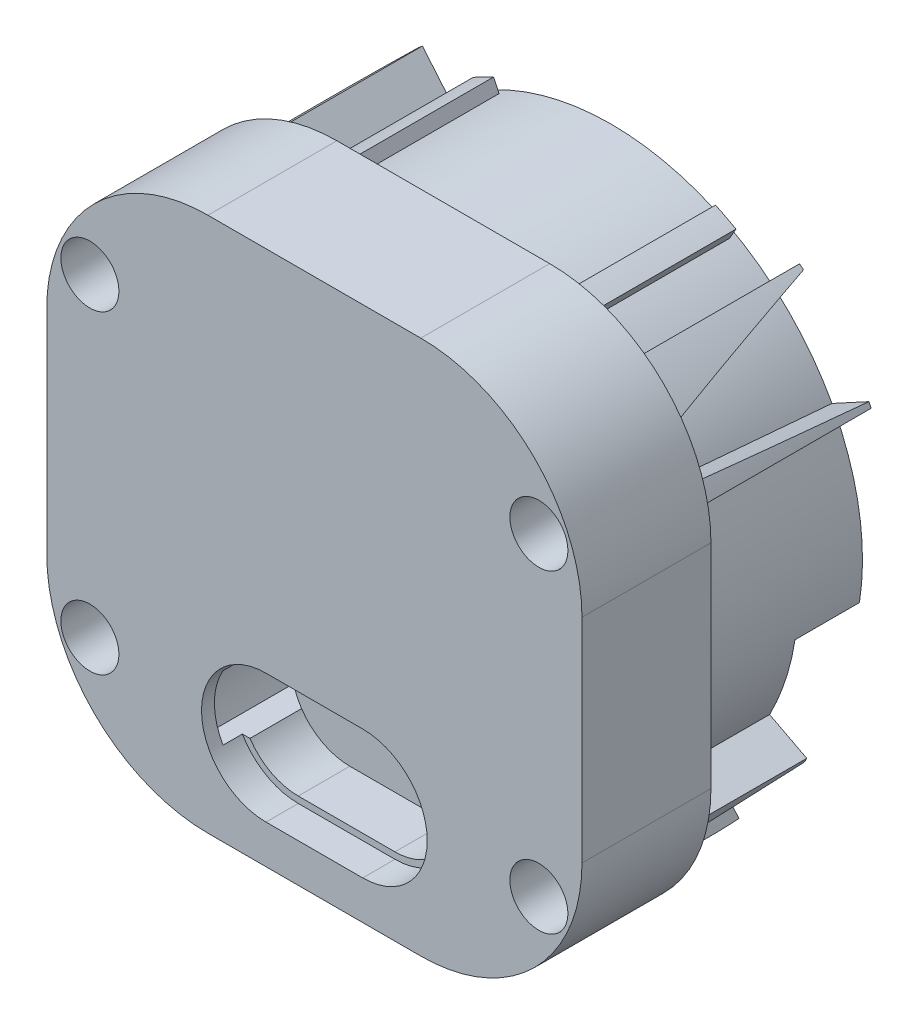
ISO-10303-21;
HEADER;
FILE_DESCRIPTION(('STEP AP214'),'2;1');
FILE_NAME('part.step','',(''),(''),'','','');
FILE_SCHEMA(('AUTOMOTIVE_DESIGN { 1 0 10303 214 1 1 1 1 }'));
ENDSEC;
DATA;
#1=APPLICATION_CONTEXT('core data for automotive mechanical design processes');
#2=APPLICATION_PROTOCOL_DEFINITION('international standard','automotive_design',2000,#1);
#3=PRODUCT_CONTEXT('',#1,'mechanical');
#4=PRODUCT('Part','Part','',(#3));
#5=PRODUCT_RELATED_PRODUCT_CATEGORY('part','',(#4));
#6=PRODUCT_DEFINITION_FORMATION('','',#4);
#7=PRODUCT_DEFINITION_CONTEXT('part definition',#1,'design');
#8=PRODUCT_DEFINITION('design','',#6,#7);
#9=PRODUCT_DEFINITION_SHAPE('','',#8);
#10=(LENGTH_UNIT() NAMED_UNIT(*) SI_UNIT(.MILLI.,.METRE.));
#11=(NAMED_UNIT(*) PLANE_ANGLE_UNIT() SI_UNIT($,.RADIAN.));
#12=(NAMED_UNIT(*) SI_UNIT($,.STERADIAN.) SOLID_ANGLE_UNIT());
#13=UNCERTAINTY_MEASURE_WITH_UNIT(LENGTH_MEASURE(1.E-05),#10,'distance_accuracy_value','');
#14=(GEOMETRIC_REPRESENTATION_CONTEXT(3) GLOBAL_UNCERTAINTY_ASSIGNED_CONTEXT((#13)) GLOBAL_UNIT_ASSIGNED_CONTEXT((#10,
#11,#12)) REPRESENTATION_CONTEXT('',''));
#15=CARTESIAN_POINT('',(0.,0.,0.));
#16=DIRECTION('',(0.,0.,1.));
#17=DIRECTION('',(1.,0.,0.));
#18=AXIS2_PLACEMENT_3D('',#15,#16,#17);
#19=CARTESIAN_POINT('',(0.,0.,-48.7510021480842));
#20=DIRECTION('',(0.,0.,1.));
#21=DIRECTION('',(1.,0.,0.));
#22=AXIS2_PLACEMENT_3D('',#19,#20,#21);
#23=CYLINDRICAL_SURFACE('',#22,45.5);
#24=CARTESIAN_POINT('',(0.,0.,0.));
#25=DIRECTION('',(0.,0.,-1.));
#26=DIRECTION('',(-1.,0.,0.));
#27=AXIS2_PLACEMENT_3D('',#24,#25,#26);
#28=CIRCLE('',#27,45.5);
#29=CARTESIAN_POINT('',(29.2468362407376,34.8550221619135,0.));
#30=VERTEX_POINT('',#29);
#31=CARTESIAN_POINT('',(35.3362533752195,28.6635517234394,0.));
#32=VERTEX_POINT('',#31);
#33=EDGE_CURVE('E642',#30,#32,#28,.T.);
#34=ORIENTED_EDGE('',*,*,#33,.T.);
#35=CARTESIAN_POINT('',(35.3362533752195,28.6635517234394,0.));
#36=CARTESIAN_POINT('',(35.162677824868,28.8775239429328,-0.83631583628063));
#37=CARTESIAN_POINT('',(34.988798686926,29.0879188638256,-1.67347940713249));
#38=CARTESIAN_POINT('',(34.640363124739,29.5020105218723,-3.34931403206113));
#39=CARTESIAN_POINT('',(34.4658067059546,29.7057073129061,-4.18798507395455));
#40=CARTESIAN_POINT('',(34.115952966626,30.1068519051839,-5.86661556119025));
#41=CARTESIAN_POINT('',(33.9406556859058,30.3043000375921,-6.70657493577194));
#42=CARTESIAN_POINT('',(33.5892527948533,30.6933348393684,-8.38768114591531));
#43=CARTESIAN_POINT('',(33.4131471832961,30.8849214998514,-9.22882798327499));
#44=CARTESIAN_POINT('',(32.9591262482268,31.3705458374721,-11.3934851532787));
#45=CARTESIAN_POINT('',(32.6805784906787,31.6605204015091,-12.7177757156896));
#46=CARTESIAN_POINT('',(32.1211950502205,32.2278990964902,-15.3685806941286));
#47=CARTESIAN_POINT('',(31.840359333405,32.5053030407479,-16.6950951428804));
#48=CARTESIAN_POINT('',(31.2761845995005,33.0485060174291,-19.350436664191));
#49=CARTESIAN_POINT('',(30.9928447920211,33.3143012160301,-20.6792643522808));
#50=CARTESIAN_POINT('',(30.4236656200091,33.8348778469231,-23.3385015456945));
#51=CARTESIAN_POINT('',(30.1378263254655,34.0896595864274,-24.668911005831));
#52=CARTESIAN_POINT('',(29.8506858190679,34.3392859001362,-26.));
#53=B_SPLINE_CURVE_WITH_KNOTS('',3,(#35,#36,#37,#38,#39,#40,#41,#42,#43,#44,#45,#46,#47,#48,#49,
#50,#51,#52),.UNSPECIFIED.,.F.,.F.,(4,2,2,2,2,2,2,2,4),(0.,2.64158223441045,5.28314321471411,
7.92456396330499,10.5659887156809,14.7178784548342,18.8698298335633,23.0231421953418,
27.176338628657),.UNSPECIFIED.);
#54=CARTESIAN_POINT('',(29.8506858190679,34.3392859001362,-26.));
#55=VERTEX_POINT('',#54);
#56=EDGE_CURVE('E11',#32,#55,#53,.T.);
#57=ORIENTED_EDGE('',*,*,#56,.T.);
#58=CARTESIAN_POINT('',(0.,0.,-26.));
#59=DIRECTION('',(0.,0.,-1.));
#60=DIRECTION('',(-1.,0.,0.));
#61=AXIS2_PLACEMENT_3D('',#58,#59,#60);
#62=CIRCLE('',#61,45.5);
#63=CARTESIAN_POINT('',(29.2468362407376,34.8550221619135,-26.));
#64=VERTEX_POINT('',#63);
#65=EDGE_CURVE('E655',#64,#55,#62,.T.);
#66=ORIENTED_EDGE('',*,*,#65,.F.);
#67=DIRECTION('',(0.,0.,1.));
#68=VECTOR('',#67,1.);
#69=CARTESIAN_POINT('',(29.2468362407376,34.8550221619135,-48.7510021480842));
#70=LINE('',#69,#68);
#71=EDGE_CURVE('E643',#64,#30,#70,.T.);
#72=ORIENTED_EDGE('',*,*,#71,.T.);
#73=EDGE_LOOP('',(#34,#57,#66,#72));
#74=FACE_BOUND('',#73,.T.);
#75=ADVANCED_FACE('F36',(#74),#23,.T.);
#76=CARTESIAN_POINT('',(0.,0.,-48.7510021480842));
#77=DIRECTION('',(0.,0.,1.));
#78=DIRECTION('',(1.,0.,0.));
#79=AXIS2_PLACEMENT_3D('',#76,#77,#78);
#80=CYLINDRICAL_SURFACE('',#79,45.5);
#81=CARTESIAN_POINT('',(0.,0.,0.));
#82=DIRECTION('',(0.,0.,-1.));
#83=DIRECTION('',(-1.,0.,0.));
#84=AXIS2_PLACEMENT_3D('',#81,#82,#83);
#85=CIRCLE('',#84,45.5);
#86=CARTESIAN_POINT('',(-29.2468362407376,-34.8550221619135,0.));
#87=VERTEX_POINT('',#86);
#88=CARTESIAN_POINT('',(-35.3362533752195,-28.6635517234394,0.));
#89=VERTEX_POINT('',#88);
#90=EDGE_CURVE('E1240',#87,#89,#85,.T.);
#91=ORIENTED_EDGE('',*,*,#90,.T.);
#92=CARTESIAN_POINT('',(-35.3362533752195,-28.6635517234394,0.));
#93=CARTESIAN_POINT('',(-35.162677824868,-28.8775239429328,-0.836315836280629));
#94=CARTESIAN_POINT('',(-34.988798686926,-29.0879188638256,-1.67347940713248));
#95=CARTESIAN_POINT('',(-34.640363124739,-29.5020105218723,-3.34931403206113));
#96=CARTESIAN_POINT('',(-34.4658067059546,-29.7057073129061,-4.18798507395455));
#97=CARTESIAN_POINT('',(-34.115952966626,-30.1068519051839,-5.86661556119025));
#98=CARTESIAN_POINT('',(-33.9406556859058,-30.3043000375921,-6.70657493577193));
#99=CARTESIAN_POINT('',(-33.5892527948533,-30.6933348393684,-8.38768114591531));
#100=CARTESIAN_POINT('',(-33.4131471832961,-30.8849214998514,-9.22882798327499));
#101=CARTESIAN_POINT('',(-32.9591262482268,-31.3705458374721,-11.3934851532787));
#102=CARTESIAN_POINT('',(-32.6805784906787,-31.6605204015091,-12.7177757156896));
#103=CARTESIAN_POINT('',(-32.1211950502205,-32.2278990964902,-15.3685806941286));
#104=CARTESIAN_POINT('',(-31.840359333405,-32.505303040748,-16.6950951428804));
#105=CARTESIAN_POINT('',(-31.2761845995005,-33.0485060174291,-19.350436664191));
#106=CARTESIAN_POINT('',(-30.9928447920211,-33.3143012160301,-20.6792643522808));
#107=CARTESIAN_POINT('',(-30.4236656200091,-33.8348778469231,-23.3385015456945));
#108=CARTESIAN_POINT('',(-30.1378263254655,-34.0896595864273,-24.668911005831));
#109=CARTESIAN_POINT('',(-29.8506858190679,-34.3392859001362,-26.));
#110=B_SPLINE_CURVE_WITH_KNOTS('',3,(#92,#93,#94,#95,#96,#97,#98,#99,#100,#101,#102,#103,#104,
#105,#106,#107,#108,#109),.UNSPECIFIED.,.F.,.F.,(4,2,2,2,2,2,2,2,4),(0.,2.64158223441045,
5.28314321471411,7.92456396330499,10.5659887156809,14.7178784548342,18.8698298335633,
23.0231421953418,27.176338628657),.UNSPECIFIED.);
#111=CARTESIAN_POINT('',(-29.8506858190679,-34.3392859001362,-26.));
#112=VERTEX_POINT('',#111);
#113=EDGE_CURVE('E635',#89,#112,#110,.T.);
#114=ORIENTED_EDGE('',*,*,#113,.T.);
#115=CARTESIAN_POINT('',(0.,0.,-26.));
#116=DIRECTION('',(0.,0.,-1.));
#117=DIRECTION('',(-1.,0.,0.));
#118=AXIS2_PLACEMENT_3D('',#115,#116,#117);
#119=CIRCLE('',#118,45.5);
#120=CARTESIAN_POINT('',(-29.2468362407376,-34.8550221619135,-26.));
#121=VERTEX_POINT('',#120);
#122=EDGE_CURVE('E647',#121,#112,#119,.T.);
#123=ORIENTED_EDGE('',*,*,#122,.F.);
#124=DIRECTION('',(0.,0.,1.));
#125=VECTOR('',#124,1.);
#126=CARTESIAN_POINT('',(-29.2468362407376,-34.8550221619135,-48.7510021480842));
#127=LINE('',#126,#125);
#128=EDGE_CURVE('E1247',#121,#87,#127,.T.);
#129=ORIENTED_EDGE('',*,*,#128,.T.);
#130=EDGE_LOOP('',(#91,#114,#123,#129));
#131=FACE_BOUND('',#130,.T.);
#132=ADVANCED_FACE('F1306',(#131),#80,.T.);
#133=CARTESIAN_POINT('',(0.,0.,-48.7510021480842));
#134=DIRECTION('',(0.,0.,1.));
#135=DIRECTION('',(1.,0.,0.));
#136=AXIS2_PLACEMENT_3D('',#133,#134,#135);
#137=CYLINDRICAL_SURFACE('',#136,45.5);
#138=CARTESIAN_POINT('',(0.,0.,-26.));
#139=DIRECTION('',(0.,0.,-1.));
#140=DIRECTION('',(-1.,0.,0.));
#141=AXIS2_PLACEMENT_3D('',#138,#139,#140);
#142=CIRCLE('',#141,45.5);
#143=CARTESIAN_POINT('',(-29.8506858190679,34.3392859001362,-26.));
#144=VERTEX_POINT('',#143);
#145=CARTESIAN_POINT('',(-29.2468362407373,34.8550221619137,-26.));
#146=VERTEX_POINT('',#145);
#147=EDGE_CURVE('E685',#144,#146,#142,.T.);
#148=ORIENTED_EDGE('',*,*,#147,.F.);
#149=CARTESIAN_POINT('',(-29.8506858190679,34.3392859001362,-26.));
#150=CARTESIAN_POINT('',(-30.033291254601,34.1805476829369,-25.1534875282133));
#151=CARTESIAN_POINT('',(-30.2153720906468,34.019712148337,-24.3072567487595));
#152=CARTESIAN_POINT('',(-30.5785074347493,33.6936854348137,-22.6154106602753));
#153=CARTESIAN_POINT('',(-30.7595619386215,33.5284942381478,-21.7697953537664));
#154=CARTESIAN_POINT('',(-31.3012296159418,33.026136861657,-19.2339068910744));
#155=CARTESIAN_POINT('',(-31.6603352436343,32.6821970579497,-17.5446455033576));
#156=CARTESIAN_POINT('',(-32.2982874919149,32.0503773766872,-14.5306715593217));
#157=CARTESIAN_POINT('',(-32.5778604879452,31.7662560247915,-13.2053238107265));
#158=CARTESIAN_POINT('',(-33.1347992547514,31.1848865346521,-10.5570709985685));
#159=CARTESIAN_POINT('',(-33.4121650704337,30.887638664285,-9.23416588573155));
#160=CARTESIAN_POINT('',(-33.9649977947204,30.2786749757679,-6.59065325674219));
#161=CARTESIAN_POINT('',(-34.2404638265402,29.9669529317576,-5.27004698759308));
#162=CARTESIAN_POINT('',(-34.6523271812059,29.4874648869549,-3.29172180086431));
#163=CARTESIAN_POINT('',(-34.7893950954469,29.325647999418,-2.63269753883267));
#164=CARTESIAN_POINT('',(-35.0631218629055,28.9978110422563,-1.31560685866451));
#165=CARTESIAN_POINT('',(-35.1997807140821,28.8317909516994,-0.65754044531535));
#166=CARTESIAN_POINT('',(-35.3362533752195,28.6635517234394,0.));
#167=B_SPLINE_CURVE_WITH_KNOTS('',3,(#149,#150,#151,#152,#153,#154,#155,#156,#157,#158,#159,
#160,#161,#162,#163,#164,#165,#166),.UNSPECIFIED.,.F.,.F.,(4,2,2,2,2,2,2,2,4),(0.,
2.64123092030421,5.28247260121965,10.5651254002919,14.7170423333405,18.868874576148,
23.0225095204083,25.099410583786,27.1763219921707),.UNSPECIFIED.);
#168=CARTESIAN_POINT('',(-35.3362533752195,28.6635517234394,0.));
#169=VERTEX_POINT('',#168);
#170=EDGE_CURVE('E1419',#144,#169,#167,.T.);
#171=ORIENTED_EDGE('',*,*,#170,.T.);
#172=CARTESIAN_POINT('',(0.,0.,0.));
#173=DIRECTION('',(0.,0.,-1.));
#174=DIRECTION('',(-1.,0.,0.));
#175=AXIS2_PLACEMENT_3D('',#172,#173,#174);
#176=CIRCLE('',#175,45.5);
#177=CARTESIAN_POINT('',(-29.2468362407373,34.8550221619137,0.));
#178=VERTEX_POINT('',#177);
#179=EDGE_CURVE('E675',#169,#178,#176,.T.);
#180=ORIENTED_EDGE('',*,*,#179,.T.);
#181=DIRECTION('',(0.,0.,1.));
#182=VECTOR('',#181,1.);
#183=CARTESIAN_POINT('',(-29.2468362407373,34.8550221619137,-48.7510021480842));
#184=LINE('',#183,#182);
#185=EDGE_CURVE('E671',#146,#178,#184,.T.);
#186=ORIENTED_EDGE('',*,*,#185,.F.);
#187=EDGE_LOOP('',(#148,#171,#180,#186));
#188=FACE_BOUND('',#187,.T.);
#189=ADVANCED_FACE('F1310',(#188),#137,.T.);
#190=CARTESIAN_POINT('',(41.5000000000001,-6.,-16.));
#191=DIRECTION('',(0.,0.,1.));
#192=DIRECTION('',(1.,0.,0.));
#193=AXIS2_PLACEMENT_3D('',#190,#191,#192);
#194=PLANE('',#193);
#195=DIRECTION('',(-0.656059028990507,0.754709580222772,0.));
#196=VECTOR('',#195,1.);
#197=CARTESIAN_POINT('',(33.4447887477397,-38.4738283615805,-16.));
#198=LINE('',#197,#196);
#199=CARTESIAN_POINT('',(29.850685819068,-34.3392859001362,-16.));
#200=VERTEX_POINT('',#199);
#201=CARTESIAN_POINT('',(25.5863021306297,-29.4336736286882,-16.));
#202=VERTEX_POINT('',#201);
#203=EDGE_CURVE('E1650',#200,#202,#198,.T.);
#204=ORIENTED_EDGE('',*,*,#203,.F.);
#205=CARTESIAN_POINT('',(0.,0.,-16.));
#206=DIRECTION('',(0.,0.,1.));
#207=DIRECTION('',(1.,0.,0.));
#208=AXIS2_PLACEMENT_3D('',#205,#206,#207);
#209=CIRCLE('',#208,45.5);
#210=CARTESIAN_POINT('',(29.2468362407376,-34.8550221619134,-16.));
#211=VERTEX_POINT('',#210);
#212=EDGE_CURVE('E1613',#211,#200,#209,.T.);
#213=ORIENTED_EDGE('',*,*,#212,.F.);
#214=DIRECTION('',(0.642787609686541,-0.766044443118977,0.));
#215=VECTOR('',#214,1.);
#216=CARTESIAN_POINT('',(29.2468362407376,-34.8550221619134,-16.));
#217=LINE('',#216,#215);
#218=CARTESIAN_POINT('',(25.0687167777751,-29.8757332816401,-16.));
#219=VERTEX_POINT('',#218);
#220=EDGE_CURVE('E1232',#219,#211,#217,.T.);
#221=ORIENTED_EDGE('',*,*,#220,.F.);
#222=CARTESIAN_POINT('',(0.,0.,-16.));
#223=DIRECTION('',(0.,0.,1.));
#224=DIRECTION('',(1.,0.,0.));
#225=AXIS2_PLACEMENT_3D('',#222,#223,#224);
#226=CIRCLE('',#225,39.);
#227=CARTESIAN_POINT('',(3.,-38.8844441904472,-16.));
#228=VERTEX_POINT('',#227);
#229=EDGE_CURVE('E707',#228,#219,#226,.T.);
#230=ORIENTED_EDGE('',*,*,#229,.F.);
#231=DIRECTION('',(0.,1.,0.));
#232=VECTOR('',#231,1.);
#233=CARTESIAN_POINT('',(3.,-41.5000000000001,-16.));
#234=LINE('',#233,#232);
#235=CARTESIAN_POINT('',(3.,-34.8711915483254,-16.));
#236=VERTEX_POINT('',#235);
#237=EDGE_CURVE('E701',#228,#236,#234,.T.);
#238=ORIENTED_EDGE('',*,*,#237,.T.);
#239=CARTESIAN_POINT('',(0.,0.,-16.));
#240=DIRECTION('',(0.,0.,1.));
#241=DIRECTION('',(1.,0.,0.));
#242=AXIS2_PLACEMENT_3D('',#239,#240,#241);
#243=CIRCLE('',#242,35.);
#244=CARTESIAN_POINT('',(34.4818792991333,-6.,-16.));
#245=VERTEX_POINT('',#244);
#246=EDGE_CURVE('E1197',#245,#236,#243,.F.);
#247=ORIENTED_EDGE('',*,*,#246,.F.);
#248=DIRECTION('',(1.,0.,0.));
#249=VECTOR('',#248,1.);
#250=CARTESIAN_POINT('',(41.5000000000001,-6.,-16.));
#251=LINE('',#250,#249);
#252=CARTESIAN_POINT('',(38.5356977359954,-6.,-16.));
#253=VERTEX_POINT('',#252);
#254=EDGE_CURVE('E703',#245,#253,#251,.T.);
#255=ORIENTED_EDGE('',*,*,#254,.T.);
#256=CARTESIAN_POINT('',(34.5934224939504,-18.0081959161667,-16.));
#257=VERTEX_POINT('',#256);
#258=EDGE_CURVE('E706',#257,#253,#226,.T.);
#259=ORIENTED_EDGE('',*,*,#258,.F.);
#260=DIRECTION('',(-0.887010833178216,0.461748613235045,0.));
#261=VECTOR('',#260,1.);
#262=CARTESIAN_POINT('',(40.3589929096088,-21.0095619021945,-16.));
#263=LINE('',#262,#261);
#264=CARTESIAN_POINT('',(40.3589929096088,-21.0095619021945,-16.));
#265=VERTEX_POINT('',#264);
#266=EDGE_CURVE('E1263',#265,#257,#263,.T.);
#267=ORIENTED_EDGE('',*,*,#266,.F.);
#268=CARTESIAN_POINT('',(39.9861786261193,-21.7107235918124,-16.));
#269=VERTEX_POINT('',#268);
#270=EDGE_CURVE('E1235',#269,#265,#209,.T.);
#271=ORIENTED_EDGE('',*,*,#270,.F.);
#272=DIRECTION('',(0.878817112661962,-0.477158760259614,0.));
#273=VECTOR('',#272,1.);
#274=CARTESIAN_POINT('',(34.2738673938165,-18.609191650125,-16.));
#275=LINE('',#274,#273);
#276=CARTESIAN_POINT('',(34.2738673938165,-18.609191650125,-16.));
#277=VERTEX_POINT('',#276);
#278=EDGE_CURVE('E1085',#277,#269,#275,.T.);
#279=ORIENTED_EDGE('',*,*,#278,.F.);
#280=CARTESIAN_POINT('',(0.,0.,-16.));
#281=DIRECTION('',(0.,0.,1.));
#282=DIRECTION('',(-1.,0.,0.));
#283=AXIS2_PLACEMENT_3D('',#280,#281,#282);
#284=CIRCLE('',#283,39.);
#285=EDGE_CURVE('E1647',#202,#277,#284,.T.);
#286=ORIENTED_EDGE('',*,*,#285,.F.);
#287=EDGE_LOOP('',(#204,#213,#221,#230,#238,#247,#255,#259,#267,#271,#279,#286));
#288=FACE_BOUND('',#287,.T.);
#289=ADVANCED_FACE('F1443',(#288),#194,.F.);
#290=CARTESIAN_POINT('',(0.,0.,-38.7510021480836));
#291=DIRECTION('',(0.,0.,1.));
#292=DIRECTION('',(1.,0.,0.));
#293=AXIS2_PLACEMENT_3D('',#290,#291,#292);
#294=CYLINDRICAL_SURFACE('',#293,45.5);
#295=ORIENTED_EDGE('',*,*,#212,.T.);
#296=CARTESIAN_POINT('',(29.850685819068,-34.3392859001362,-16.));
#297=CARTESIAN_POINT('',(30.0079293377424,-34.2025949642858,-15.5464430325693));
#298=CARTESIAN_POINT('',(30.1647410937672,-34.0643858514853,-15.093195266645));
#299=CARTESIAN_POINT('',(30.4775397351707,-33.7848129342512,-14.1873859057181));
#300=CARTESIAN_POINT('',(30.6335266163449,-33.6434491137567,-13.7348243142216));
#301=CARTESIAN_POINT('',(31.1003463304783,-33.2144126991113,-12.3781588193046));
#302=CARTESIAN_POINT('',(31.4099970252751,-32.921830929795,-11.4751931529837));
#303=CARTESIAN_POINT('',(32.0232076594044,-32.3256101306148,-9.68279407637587));
#304=CARTESIAN_POINT('',(32.3267972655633,-32.0221245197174,-8.79331979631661));
#305=CARTESIAN_POINT('',(32.9317809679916,-31.3996222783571,-7.01913228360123));
#306=CARTESIAN_POINT('',(33.2331752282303,-31.0806068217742,-6.13441869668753));
#307=CARTESIAN_POINT('',(33.6843972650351,-30.5885749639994,-4.81132115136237));
#308=CARTESIAN_POINT('',(33.8347632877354,-30.4221932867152,-4.37064774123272));
#309=CARTESIAN_POINT('',(34.1352598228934,-30.0846324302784,-3.49106384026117));
#310=CARTESIAN_POINT('',(34.2853903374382,-29.9134532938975,-3.05215333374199));
#311=CARTESIAN_POINT('',(34.5855795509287,-29.5658666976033,-2.17629138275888));
#312=CARTESIAN_POINT('',(34.7356382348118,-29.3894584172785,-1.73934025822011));
#313=CARTESIAN_POINT('',(35.0358399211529,-29.0309218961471,-0.86780423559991));
#314=CARTESIAN_POINT('',(35.1859829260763,-28.8487934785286,-0.433219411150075));
#315=CARTESIAN_POINT('',(35.3362533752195,-28.6635517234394,0.));
#316=B_SPLINE_CURVE_WITH_KNOTS('',3,(#296,#297,#298,#299,#300,#301,#302,#303,#304,#305,#306,
#307,#308,#309,#310,#311,#312,#313,#314,#315),.UNSPECIFIED.,.F.,.F.,(4,2,2,2,2,2,2,2,2,4),(0.,
1.49736378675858,2.99473519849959,5.98987062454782,8.95268034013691,11.9152664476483,
13.398610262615,14.881940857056,16.3655054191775,17.8491158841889),.UNSPECIFIED.);
#317=CARTESIAN_POINT('',(35.3362533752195,-28.6635517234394,0.));
#318=VERTEX_POINT('',#317);
#319=EDGE_CURVE('E1420',#200,#318,#316,.T.);
#320=ORIENTED_EDGE('',*,*,#319,.T.);
#321=CARTESIAN_POINT('',(0.,0.,0.));
#322=DIRECTION('',(0.,0.,-1.));
#323=DIRECTION('',(-1.,0.,0.));
#324=AXIS2_PLACEMENT_3D('',#321,#322,#323);
#325=CIRCLE('',#324,45.5);
#326=CARTESIAN_POINT('',(29.2468362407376,-34.8550221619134,0.));
#327=VERTEX_POINT('',#326);
#328=EDGE_CURVE('E1212',#318,#327,#325,.T.);
#329=ORIENTED_EDGE('',*,*,#328,.T.);
#330=DIRECTION('',(0.,0.,1.));
#331=VECTOR('',#330,1.);
#332=CARTESIAN_POINT('',(29.2468362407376,-34.8550221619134,-38.7510021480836));
#333=LINE('',#332,#331);
#334=EDGE_CURVE('E1223',#211,#327,#333,.T.);
#335=ORIENTED_EDGE('',*,*,#334,.F.);
#336=EDGE_LOOP('',(#295,#320,#329,#335));
#337=FACE_BOUND('',#336,.T.);
#338=ADVANCED_FACE('F1446',(#337),#294,.T.);
#339=CARTESIAN_POINT('',(-16.5000000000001,16.5000000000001,0.));
#340=DIRECTION('',(0.,0.,-1.));
#341=DIRECTION('',(-1.,0.,0.));
#342=AXIS2_PLACEMENT_3D('',#339,#340,#341);
#343=PLANE('',#342);
#344=CARTESIAN_POINT('',(-16.5000000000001,16.5000000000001,0.));
#345=DIRECTION('',(0.,0.,1.));
#346=DIRECTION('',(-1.,0.,0.));
#347=AXIS2_PLACEMENT_3D('',#344,#345,#346);
#348=CIRCLE('',#347,25.);
#349=CARTESIAN_POINT('',(-16.5,41.5000000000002,0.));
#350=VERTEX_POINT('',#349);
#351=CARTESIAN_POINT('',(-41.5000000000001,16.5,0.));
#352=VERTEX_POINT('',#351);
#353=EDGE_CURVE('E1118',#350,#352,#348,.T.);
#354=ORIENTED_EDGE('',*,*,#353,.F.);
#355=DIRECTION('',(-1.,0.,0.));
#356=VECTOR('',#355,1.);
#357=CARTESIAN_POINT('',(-16.5,41.5000000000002,0.));
#358=LINE('',#357,#356);
#359=CARTESIAN_POINT('',(16.5000000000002,41.5,0.));
#360=VERTEX_POINT('',#359);
#361=EDGE_CURVE('E1133',#360,#350,#358,.T.);
#362=ORIENTED_EDGE('',*,*,#361,.F.);
#363=CARTESIAN_POINT('',(16.5000000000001,16.5,0.));
#364=DIRECTION('',(0.,0.,1.));
#365=DIRECTION('',(1.,0.,0.));
#366=AXIS2_PLACEMENT_3D('',#363,#364,#365);
#367=CIRCLE('',#366,25.);
#368=CARTESIAN_POINT('',(41.5000000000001,16.5,0.));
#369=VERTEX_POINT('',#368);
#370=EDGE_CURVE('E1131',#369,#360,#367,.T.);
#371=ORIENTED_EDGE('',*,*,#370,.F.);
#372=DIRECTION('',(0.,1.,0.));
#373=VECTOR('',#372,1.);
#374=CARTESIAN_POINT('',(41.5000000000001,16.5,0.));
#375=LINE('',#374,#373);
#376=CARTESIAN_POINT('',(41.5000000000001,-16.5,0.));
#377=VERTEX_POINT('',#376);
#378=EDGE_CURVE('E1129',#377,#369,#375,.T.);
#379=ORIENTED_EDGE('',*,*,#378,.F.);
#380=CARTESIAN_POINT('',(16.5000000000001,-16.5,0.));
#381=DIRECTION('',(0.,0.,1.));
#382=DIRECTION('',(1.,0.,0.));
#383=AXIS2_PLACEMENT_3D('',#380,#381,#382);
#384=CIRCLE('',#383,25.);
#385=CARTESIAN_POINT('',(16.5000000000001,-41.5000000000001,0.));
#386=VERTEX_POINT('',#385);
#387=EDGE_CURVE('E1127',#386,#377,#384,.T.);
#388=ORIENTED_EDGE('',*,*,#387,.F.);
#389=DIRECTION('',(1.,0.,0.));
#390=VECTOR('',#389,1.);
#391=CARTESIAN_POINT('',(-16.5000000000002,-41.5000000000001,0.));
#392=LINE('',#391,#390);
#393=CARTESIAN_POINT('',(-16.5000000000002,-41.5000000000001,0.));
#394=VERTEX_POINT('',#393);
#395=EDGE_CURVE('E1125',#394,#386,#392,.T.);
#396=ORIENTED_EDGE('',*,*,#395,.F.);
#397=CARTESIAN_POINT('',(-16.5000000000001,-16.5,0.));
#398=DIRECTION('',(0.,0.,1.));
#399=DIRECTION('',(-1.,0.,0.));
#400=AXIS2_PLACEMENT_3D('',#397,#398,#399);
#401=CIRCLE('',#400,25.);
#402=CARTESIAN_POINT('',(-41.5000000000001,-16.5,0.));
#403=VERTEX_POINT('',#402);
#404=EDGE_CURVE('E1123',#403,#394,#401,.T.);
#405=ORIENTED_EDGE('',*,*,#404,.F.);
#406=DIRECTION('',(0.,-1.,0.));
#407=VECTOR('',#406,1.);
#408=CARTESIAN_POINT('',(-41.5000000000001,16.5,0.));
#409=LINE('',#408,#407);
#410=EDGE_CURVE('E1121',#352,#403,#409,.T.);
#411=ORIENTED_EDGE('',*,*,#410,.F.);
#412=EDGE_LOOP('',(#354,#362,#371,#379,#388,#396,#405,#411));
#413=FACE_BOUND('',#412,.T.);
#414=CARTESIAN_POINT('',(0.,0.,0.));
#415=DIRECTION('',(0.,0.,-1.));
#416=DIRECTION('',(-1.,0.,0.));
#417=AXIS2_PLACEMENT_3D('',#414,#415,#416);
#418=CIRCLE('',#417,39.);
#419=CARTESIAN_POINT('',(25.0687167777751,-29.8757332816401,0.));
#420=VERTEX_POINT('',#419);
#421=CARTESIAN_POINT('',(-25.0687167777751,-29.8757332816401,0.));
#422=VERTEX_POINT('',#421);
#423=EDGE_CURVE('E1009',#420,#422,#418,.T.);
#424=ORIENTED_EDGE('',*,*,#423,.F.);
#425=DIRECTION('',(-0.642787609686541,0.766044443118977,0.));
#426=VECTOR('',#425,1.);
#427=CARTESIAN_POINT('',(29.2468362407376,-34.8550221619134,0.));
#428=LINE('',#427,#426);
#429=EDGE_CURVE('E1211',#327,#420,#428,.T.);
#430=ORIENTED_EDGE('',*,*,#429,.F.);
#431=ORIENTED_EDGE('',*,*,#328,.F.);
#432=DIRECTION('',(-0.776620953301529,0.62996816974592,0.));
#433=VECTOR('',#432,1.);
#434=CARTESIAN_POINT('',(35.3362533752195,-28.6635517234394,0.));
#435=LINE('',#434,#433);
#436=CARTESIAN_POINT('',(30.2882171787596,-24.5687586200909,0.));
#437=VERTEX_POINT('',#436);
#438=EDGE_CURVE('E1620',#318,#437,#435,.T.);
#439=ORIENTED_EDGE('',*,*,#438,.T.);
#440=CARTESIAN_POINT('',(0.,0.,0.));
#441=DIRECTION('',(0.,0.,1.));
#442=DIRECTION('',(-1.,0.,0.));
#443=AXIS2_PLACEMENT_3D('',#440,#441,#442);
#444=CIRCLE('',#443,39.);
#445=CARTESIAN_POINT('',(33.4462615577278,-20.0586038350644,0.));
#446=VERTEX_POINT('',#445);
#447=EDGE_CURVE('E1641',#437,#446,#444,.T.);
#448=ORIENTED_EDGE('',*,*,#447,.T.);
#449=DIRECTION('',(0.857596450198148,-0.514323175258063,0.));
#450=VECTOR('',#449,1.);
#451=CARTESIAN_POINT('',(39.0206384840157,-23.4017044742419,0.));
#452=LINE('',#451,#450);
#453=CARTESIAN_POINT('',(39.0206384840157,-23.4017044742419,0.));
#454=VERTEX_POINT('',#453);
#455=EDGE_CURVE('E1629',#446,#454,#452,.T.);
#456=ORIENTED_EDGE('',*,*,#455,.T.);
#457=CARTESIAN_POINT('',(40.3589929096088,-21.0095619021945,0.));
#458=VERTEX_POINT('',#457);
#459=EDGE_CURVE('E1207',#458,#454,#325,.T.);
#460=ORIENTED_EDGE('',*,*,#459,.F.);
#461=DIRECTION('',(0.887010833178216,-0.461748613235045,0.));
#462=VECTOR('',#461,1.);
#463=CARTESIAN_POINT('',(40.3589929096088,-21.0095619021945,0.));
#464=LINE('',#463,#462);
#465=CARTESIAN_POINT('',(34.5934224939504,-18.0081959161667,0.));
#466=VERTEX_POINT('',#465);
#467=EDGE_CURVE('E1084',#466,#458,#464,.T.);
#468=ORIENTED_EDGE('',*,*,#467,.F.);
#469=CARTESIAN_POINT('',(34.5934224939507,18.0081959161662,0.));
#470=VERTEX_POINT('',#469);
#471=EDGE_CURVE('E1008',#470,#466,#418,.T.);
#472=ORIENTED_EDGE('',*,*,#471,.F.);
#473=DIRECTION('',(-0.887010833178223,-0.461748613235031,0.));
#474=VECTOR('',#473,1.);
#475=CARTESIAN_POINT('',(34.5934224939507,18.0081959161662,0.));
#476=LINE('',#475,#474);
#477=CARTESIAN_POINT('',(40.3589929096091,21.0095619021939,0.));
#478=VERTEX_POINT('',#477);
#479=EDGE_CURVE('E641',#478,#470,#476,.T.);
#480=ORIENTED_EDGE('',*,*,#479,.F.);
#481=CARTESIAN_POINT('',(39.0206384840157,23.4017044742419,0.));
#482=VERTEX_POINT('',#481);
#483=EDGE_CURVE('E632',#482,#478,#28,.T.);
#484=ORIENTED_EDGE('',*,*,#483,.F.);
#485=DIRECTION('',(0.857596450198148,0.514323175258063,0.));
#486=VECTOR('',#485,1.);
#487=CARTESIAN_POINT('',(33.4462615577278,20.0586038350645,0.));
#488=LINE('',#487,#486);
#489=CARTESIAN_POINT('',(33.4462615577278,20.0586038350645,0.));
#490=VERTEX_POINT('',#489);
#491=EDGE_CURVE('E619',#490,#482,#488,.T.);
#492=ORIENTED_EDGE('',*,*,#491,.F.);
#493=CARTESIAN_POINT('',(0.,0.,0.));
#494=DIRECTION('',(0.,0.,-1.));
#495=DIRECTION('',(1.,0.,0.));
#496=AXIS2_PLACEMENT_3D('',#493,#494,#495);
#497=CIRCLE('',#496,39.);
#498=CARTESIAN_POINT('',(30.2882171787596,24.5687586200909,0.));
#499=VERTEX_POINT('',#498);
#500=EDGE_CURVE('E1712',#499,#490,#497,.T.);
#501=ORIENTED_EDGE('',*,*,#500,.F.);
#502=DIRECTION('',(-0.776620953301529,-0.62996816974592,0.));
#503=VECTOR('',#502,1.);
#504=CARTESIAN_POINT('',(30.2882171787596,24.5687586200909,0.));
#505=LINE('',#504,#503);
#506=EDGE_CURVE('E57',#32,#499,#505,.T.);
#507=ORIENTED_EDGE('',*,*,#506,.F.);
#508=ORIENTED_EDGE('',*,*,#33,.F.);
#509=DIRECTION('',(0.64278760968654,0.766044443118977,0.));
#510=VECTOR('',#509,1.);
#511=CARTESIAN_POINT('',(25.0687167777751,29.8757332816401,0.));
#512=LINE('',#511,#510);
#513=CARTESIAN_POINT('',(25.0687167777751,29.8757332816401,0.));
#514=VERTEX_POINT('',#513);
#515=EDGE_CURVE('E661',#514,#30,#512,.T.);
#516=ORIENTED_EDGE('',*,*,#515,.F.);
#517=CARTESIAN_POINT('',(19.3865443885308,33.8402407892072,0.));
#518=VERTEX_POINT('',#517);
#519=EDGE_CURVE('E1004',#518,#514,#418,.T.);
#520=ORIENTED_EDGE('',*,*,#519,.F.);
#521=DIRECTION('',(-0.497090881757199,-0.867698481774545,0.));
#522=VECTOR('',#521,1.);
#523=CARTESIAN_POINT('',(19.3865443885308,33.8402407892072,0.));
#524=LINE('',#523,#522);
#525=CARTESIAN_POINT('',(20.3807261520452,35.5756377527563,0.));
#526=VERTEX_POINT('',#525);
#527=EDGE_CURVE('E975',#526,#518,#524,.T.);
#528=ORIENTED_EDGE('',*,*,#527,.F.);
#529=CARTESIAN_POINT('',(0.,0.,0.));
#530=DIRECTION('',(0.,0.,-1.));
#531=DIRECTION('',(1.,0.,0.));
#532=AXIS2_PLACEMENT_3D('',#529,#530,#531);
#533=CIRCLE('',#532,41.);
#534=CARTESIAN_POINT('',(17.2025502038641,37.2165590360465,0.));
#535=VERTEX_POINT('',#534);
#536=EDGE_CURVE('E972',#535,#526,#533,.T.);
#537=ORIENTED_EDGE('',*,*,#536,.F.);
#538=DIRECTION('',(0.419574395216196,0.907720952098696,0.));
#539=VECTOR('',#538,1.);
#540=CARTESIAN_POINT('',(16.3634014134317,35.4011171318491,0.));
#541=LINE('',#540,#539);
#542=CARTESIAN_POINT('',(16.3634014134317,35.4011171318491,0.));
#543=VERTEX_POINT('',#542);
#544=EDGE_CURVE('E978',#543,#535,#541,.T.);
#545=ORIENTED_EDGE('',*,*,#544,.F.);
#546=CARTESIAN_POINT('',(-16.3634014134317,35.4011171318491,0.));
#547=VERTEX_POINT('',#546);
#548=EDGE_CURVE('E1003',#547,#543,#418,.T.);
#549=ORIENTED_EDGE('',*,*,#548,.F.);
#550=DIRECTION('',(0.419574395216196,-0.907720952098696,0.));
#551=VECTOR('',#550,1.);
#552=CARTESIAN_POINT('',(-16.3634014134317,35.4011171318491,0.));
#553=LINE('',#552,#551);
#554=CARTESIAN_POINT('',(-17.2025502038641,37.2165590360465,0.));
#555=VERTEX_POINT('',#554);
#556=EDGE_CURVE('E948',#555,#547,#553,.T.);
#557=ORIENTED_EDGE('',*,*,#556,.F.);
#558=CARTESIAN_POINT('',(0.,0.,0.));
#559=DIRECTION('',(0.,0.,-1.));
#560=DIRECTION('',(-1.,0.,0.));
#561=AXIS2_PLACEMENT_3D('',#558,#559,#560);
#562=CIRCLE('',#561,41.);
#563=CARTESIAN_POINT('',(-20.3807261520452,35.5756377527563,0.));
#564=VERTEX_POINT('',#563);
#565=EDGE_CURVE('E946',#564,#555,#562,.T.);
#566=ORIENTED_EDGE('',*,*,#565,.F.);
#567=DIRECTION('',(-0.497090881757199,0.867698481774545,0.));
#568=VECTOR('',#567,1.);
#569=CARTESIAN_POINT('',(-19.3865443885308,33.8402407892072,0.));
#570=LINE('',#569,#568);
#571=CARTESIAN_POINT('',(-19.3865443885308,33.8402407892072,0.));
#572=VERTEX_POINT('',#571);
#573=EDGE_CURVE('E944',#572,#564,#570,.T.);
#574=ORIENTED_EDGE('',*,*,#573,.F.);
#575=CARTESIAN_POINT('',(-25.0687167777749,29.8757332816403,0.));
#576=VERTEX_POINT('',#575);
#577=EDGE_CURVE('E1589',#576,#572,#418,.T.);
#578=ORIENTED_EDGE('',*,*,#577,.F.);
#579=DIRECTION('',(0.642787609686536,-0.766044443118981,0.));
#580=VECTOR('',#579,1.);
#581=CARTESIAN_POINT('',(-25.0687167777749,29.8757332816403,0.));
#582=LINE('',#581,#580);
#583=EDGE_CURVE('E668',#178,#576,#582,.T.);
#584=ORIENTED_EDGE('',*,*,#583,.F.);
#585=ORIENTED_EDGE('',*,*,#179,.F.);
#586=DIRECTION('',(0.776620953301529,-0.62996816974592,0.));
#587=VECTOR('',#586,1.);
#588=CARTESIAN_POINT('',(-30.2882171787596,24.5687586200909,0.));
#589=LINE('',#588,#587);
#590=CARTESIAN_POINT('',(-30.2882171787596,24.5687586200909,0.));
#591=VERTEX_POINT('',#590);
#592=EDGE_CURVE('E1675',#169,#591,#589,.T.);
#593=ORIENTED_EDGE('',*,*,#592,.T.);
#594=CARTESIAN_POINT('',(0.,0.,0.));
#595=DIRECTION('',(0.,0.,1.));
#596=DIRECTION('',(-1.,0.,0.));
#597=AXIS2_PLACEMENT_3D('',#594,#595,#596);
#598=CIRCLE('',#597,39.);
#599=CARTESIAN_POINT('',(-33.4462615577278,20.0586038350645,0.));
#600=VERTEX_POINT('',#599);
#601=EDGE_CURVE('E1672',#591,#600,#598,.T.);
#602=ORIENTED_EDGE('',*,*,#601,.T.);
#603=DIRECTION('',(-0.857596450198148,0.514323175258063,0.));
#604=VECTOR('',#603,1.);
#605=CARTESIAN_POINT('',(-33.4462615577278,20.0586038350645,0.));
#606=LINE('',#605,#604);
#607=CARTESIAN_POINT('',(-39.0206384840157,23.4017044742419,0.));
#608=VERTEX_POINT('',#607);
#609=EDGE_CURVE('E1669',#600,#608,#606,.T.);
#610=ORIENTED_EDGE('',*,*,#609,.T.);
#611=CARTESIAN_POINT('',(-40.358992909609,21.0095619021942,0.));
#612=VERTEX_POINT('',#611);
#613=EDGE_CURVE('E672',#612,#608,#176,.T.);
#614=ORIENTED_EDGE('',*,*,#613,.F.);
#615=DIRECTION('',(-0.88701083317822,0.461748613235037,0.));
#616=VECTOR('',#615,1.);
#617=CARTESIAN_POINT('',(-34.5934224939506,18.0081959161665,0.));
#618=LINE('',#617,#616);
#619=CARTESIAN_POINT('',(-34.5934224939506,18.0081959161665,0.));
#620=VERTEX_POINT('',#619);
#621=EDGE_CURVE('E676',#620,#612,#618,.T.);
#622=ORIENTED_EDGE('',*,*,#621,.F.);
#623=CARTESIAN_POINT('',(-34.5934224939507,-18.0081959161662,0.));
#624=VERTEX_POINT('',#623);
#625=EDGE_CURVE('E1590',#624,#620,#418,.T.);
#626=ORIENTED_EDGE('',*,*,#625,.F.);
#627=DIRECTION('',(0.887010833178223,0.461748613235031,0.));
#628=VECTOR('',#627,1.);
#629=CARTESIAN_POINT('',(-34.5934224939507,-18.0081959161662,0.));
#630=LINE('',#629,#628);
#631=CARTESIAN_POINT('',(-40.3589929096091,-21.0095619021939,0.));
#632=VERTEX_POINT('',#631);
#633=EDGE_CURVE('E1236',#632,#624,#630,.T.);
#634=ORIENTED_EDGE('',*,*,#633,.F.);
#635=CARTESIAN_POINT('',(-39.0206384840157,-23.4017044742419,0.));
#636=VERTEX_POINT('',#635);
#637=EDGE_CURVE('E1243',#636,#632,#85,.T.);
#638=ORIENTED_EDGE('',*,*,#637,.F.);
#639=DIRECTION('',(-0.857596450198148,-0.514323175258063,0.));
#640=VECTOR('',#639,1.);
#641=CARTESIAN_POINT('',(-33.4462615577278,-20.0586038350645,0.));
#642=LINE('',#641,#640);
#643=CARTESIAN_POINT('',(-33.4462615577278,-20.0586038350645,0.));
#644=VERTEX_POINT('',#643);
#645=EDGE_CURVE('E1692',#644,#636,#642,.T.);
#646=ORIENTED_EDGE('',*,*,#645,.F.);
#647=CARTESIAN_POINT('',(0.,0.,0.));
#648=DIRECTION('',(0.,0.,-1.));
#649=DIRECTION('',(-1.,0.,0.));
#650=AXIS2_PLACEMENT_3D('',#647,#648,#649);
#651=CIRCLE('',#650,39.);
#652=CARTESIAN_POINT('',(-30.2882171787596,-24.5687586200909,0.));
#653=VERTEX_POINT('',#652);
#654=EDGE_CURVE('E1694',#653,#644,#651,.T.);
#655=ORIENTED_EDGE('',*,*,#654,.F.);
#656=DIRECTION('',(0.776620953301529,0.62996816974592,0.));
#657=VECTOR('',#656,1.);
#658=CARTESIAN_POINT('',(-30.2882171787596,-24.5687586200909,0.));
#659=LINE('',#658,#657);
#660=EDGE_CURVE('E64',#89,#653,#659,.T.);
#661=ORIENTED_EDGE('',*,*,#660,.F.);
#662=ORIENTED_EDGE('',*,*,#90,.F.);
#663=DIRECTION('',(-0.642787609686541,-0.766044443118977,0.));
#664=VECTOR('',#663,1.);
#665=CARTESIAN_POINT('',(-25.0687167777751,-29.8757332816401,0.));
#666=LINE('',#665,#664);
#667=EDGE_CURVE('E1244',#422,#87,#666,.T.);
#668=ORIENTED_EDGE('',*,*,#667,.F.);
#669=EDGE_LOOP('',(#424,#430,#431,#439,#448,#456,#460,#468,#472,#480,#484,#492,#501,#507,#508,
#516,#520,#528,#537,#545,#549,#557,#566,#574,#578,#584,#585,#593,#602,#610,#614,#622,#626,#634,
#638,#646,#655,#661,#662,#668));
#670=FACE_BOUND('',#669,.T.);
#671=CARTESIAN_POINT('',(34.813961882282,-24.3769985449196,0.));
#672=DIRECTION('',(0.,0.,1.));
#673=DIRECTION('',(1.,0.,0.));
#674=AXIS2_PLACEMENT_3D('',#671,#672,#673);
#675=CIRCLE('',#674,2.5);
#676=CARTESIAN_POINT('',(37.313961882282,-24.3769985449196,0.));
#677=VERTEX_POINT('',#676);
#678=EDGE_CURVE('E1081',#677,#677,#675,.T.);
#679=ORIENTED_EDGE('',*,*,#678,.T.);
#680=EDGE_LOOP('',(#679));
#681=FACE_BOUND('',#680,.T.);
#682=CARTESIAN_POINT('',(-34.813961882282,24.3769985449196,0.));
#683=DIRECTION('',(0.,0.,-1.));
#684=DIRECTION('',(-1.,0.,0.));
#685=AXIS2_PLACEMENT_3D('',#682,#683,#684);
#686=CIRCLE('',#685,2.5);
#687=CARTESIAN_POINT('',(-32.313961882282,24.3769985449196,0.));
#688=VERTEX_POINT('',#687);
#689=EDGE_CURVE('E1642',#688,#688,#686,.F.);
#690=ORIENTED_EDGE('',*,*,#689,.T.);
#691=EDGE_LOOP('',(#690));
#692=FACE_BOUND('',#691,.T.);
#693=CARTESIAN_POINT('',(-34.8139618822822,-24.3769985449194,0.));
#694=DIRECTION('',(0.,0.,-1.));
#695=DIRECTION('',(-1.,0.,0.));
#696=AXIS2_PLACEMENT_3D('',#693,#694,#695);
#697=CIRCLE('',#696,2.5);
#698=CARTESIAN_POINT('',(-32.3139618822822,-24.3769985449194,0.));
#699=VERTEX_POINT('',#698);
#700=EDGE_CURVE('E1676',#699,#699,#697,.F.);
#701=ORIENTED_EDGE('',*,*,#700,.T.);
#702=EDGE_LOOP('',(#701));
#703=FACE_BOUND('',#702,.T.);
#704=CARTESIAN_POINT('',(34.8139618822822,24.3769985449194,0.));
#705=DIRECTION('',(0.,0.,-1.));
#706=DIRECTION('',(-1.,0.,0.));
#707=AXIS2_PLACEMENT_3D('',#704,#705,#706);
#708=CIRCLE('',#707,2.5);
#709=CARTESIAN_POINT('',(37.3139618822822,24.3769985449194,0.));
#710=VERTEX_POINT('',#709);
#711=EDGE_CURVE('E1697',#710,#710,#708,.F.);
#712=ORIENTED_EDGE('',*,*,#711,.T.);
#713=EDGE_LOOP('',(#712));
#714=FACE_BOUND('',#713,.T.);
#715=ADVANCED_FACE('F638',(#413,#670,#681,#692,#703,#714),#343,.T.);
#716=CARTESIAN_POINT('',(0.,0.,-26.));
#717=DIRECTION('',(0.,0.,1.));
#718=DIRECTION('',(1.,0.,0.));
#719=AXIS2_PLACEMENT_3D('',#716,#717,#718);
#720=CYLINDRICAL_SURFACE('',#719,39.);
#721=DIRECTION('',(0.,0.,1.));
#722=VECTOR('',#721,1.);
#723=CARTESIAN_POINT('',(25.0687167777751,-29.8757332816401,-38.7510021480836));
#724=LINE('',#723,#722);
#725=EDGE_CURVE('E1221',#219,#420,#724,.T.);
#726=ORIENTED_EDGE('',*,*,#725,.T.);
#727=ORIENTED_EDGE('',*,*,#423,.T.);
#728=DIRECTION('',(0.,0.,1.));
#729=VECTOR('',#728,1.);
#730=CARTESIAN_POINT('',(-25.0687167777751,-29.8757332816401,-48.7510021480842));
#731=LINE('',#730,#729);
#732=CARTESIAN_POINT('',(-25.0687167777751,-29.8757332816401,-26.));
#733=VERTEX_POINT('',#732);
#734=EDGE_CURVE('E1248',#733,#422,#731,.T.);
#735=ORIENTED_EDGE('',*,*,#734,.F.);
#736=CARTESIAN_POINT('',(0.,0.,-26.));
#737=DIRECTION('',(0.,0.,-1.));
#738=DIRECTION('',(-1.,0.,0.));
#739=AXIS2_PLACEMENT_3D('',#736,#737,#738);
#740=CIRCLE('',#739,39.);
#741=CARTESIAN_POINT('',(3.,-38.8844441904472,-26.));
#742=VERTEX_POINT('',#741);
#743=EDGE_CURVE('E1010',#742,#733,#740,.T.);
#744=ORIENTED_EDGE('',*,*,#743,.F.);
#745=DIRECTION('',(0.,0.,1.));
#746=VECTOR('',#745,1.);
#747=CARTESIAN_POINT('',(3.,-38.8844441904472,-26.));
#748=LINE('',#747,#746);
#749=EDGE_CURVE('E709',#742,#228,#748,.T.);
#750=ORIENTED_EDGE('',*,*,#749,.T.);
#751=ORIENTED_EDGE('',*,*,#229,.T.);
#752=EDGE_LOOP('',(#726,#727,#735,#744,#750,#751));
#753=FACE_BOUND('',#752,.T.);
#754=ADVANCED_FACE('F1598',(#753),#720,.T.);
#755=DIRECTION('',(0.,0.,1.));
#756=VECTOR('',#755,1.);
#757=CARTESIAN_POINT('',(34.5934224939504,-18.0081959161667,-38.7510021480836));
#758=LINE('',#757,#756);
#759=EDGE_CURVE('E1229',#257,#466,#758,.T.);
#760=ORIENTED_EDGE('',*,*,#759,.F.);
#761=ORIENTED_EDGE('',*,*,#258,.T.);
#762=DIRECTION('',(0.,0.,1.));
#763=VECTOR('',#762,1.);
#764=CARTESIAN_POINT('',(38.5356977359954,-6.,-26.));
#765=LINE('',#764,#763);
#766=CARTESIAN_POINT('',(38.5356977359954,-6.,-26.));
#767=VERTEX_POINT('',#766);
#768=EDGE_CURVE('E712',#253,#767,#765,.F.);
#769=ORIENTED_EDGE('',*,*,#768,.T.);
#770=CARTESIAN_POINT('',(34.5934224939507,18.0081959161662,-26.));
#771=VERTEX_POINT('',#770);
#772=EDGE_CURVE('E1007',#771,#767,#740,.T.);
#773=ORIENTED_EDGE('',*,*,#772,.F.);
#774=DIRECTION('',(0.,0.,1.));
#775=VECTOR('',#774,1.);
#776=CARTESIAN_POINT('',(34.5934224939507,18.0081959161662,-48.7510021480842));
#777=LINE('',#776,#775);
#778=EDGE_CURVE('E663',#771,#470,#777,.T.);
#779=ORIENTED_EDGE('',*,*,#778,.T.);
#780=ORIENTED_EDGE('',*,*,#471,.T.);
#781=EDGE_LOOP('',(#760,#761,#769,#773,#779,#780));
#782=FACE_BOUND('',#781,.T.);
#783=ADVANCED_FACE('F1770',(#782),#720,.T.);
#784=DIRECTION('',(0.,0.,1.));
#785=VECTOR('',#784,1.);
#786=CARTESIAN_POINT('',(-34.5934224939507,-18.0081959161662,-48.7510021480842));
#787=LINE('',#786,#785);
#788=CARTESIAN_POINT('',(-34.5934224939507,-18.0081959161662,-26.));
#789=VERTEX_POINT('',#788);
#790=EDGE_CURVE('E1258',#789,#624,#787,.T.);
#791=ORIENTED_EDGE('',*,*,#790,.T.);
#792=ORIENTED_EDGE('',*,*,#625,.T.);
#793=DIRECTION('',(0.,0.,1.));
#794=VECTOR('',#793,1.);
#795=CARTESIAN_POINT('',(-34.5934224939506,18.0081959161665,-48.7510021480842));
#796=LINE('',#795,#794);
#797=CARTESIAN_POINT('',(-34.5934224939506,18.0081959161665,-26.));
#798=VERTEX_POINT('',#797);
#799=EDGE_CURVE('E680',#798,#620,#796,.T.);
#800=ORIENTED_EDGE('',*,*,#799,.F.);
#801=EDGE_CURVE('E1014',#789,#798,#740,.T.);
#802=ORIENTED_EDGE('',*,*,#801,.F.);
#803=EDGE_LOOP('',(#791,#792,#800,#802));
#804=FACE_BOUND('',#803,.T.);
#805=ADVANCED_FACE('F1781',(#804),#720,.T.);
#806=DIRECTION('',(0.,0.,1.));
#807=VECTOR('',#806,1.);
#808=CARTESIAN_POINT('',(25.0687167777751,29.8757332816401,-48.7510021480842));
#809=LINE('',#808,#807);
#810=CARTESIAN_POINT('',(25.0687167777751,29.8757332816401,-26.));
#811=VERTEX_POINT('',#810);
#812=EDGE_CURVE('E666',#811,#514,#809,.T.);
#813=ORIENTED_EDGE('',*,*,#812,.F.);
#814=CARTESIAN_POINT('',(-25.0687167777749,29.8757332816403,-26.));
#815=VERTEX_POINT('',#814);
#816=EDGE_CURVE('E1015',#815,#811,#740,.T.);
#817=ORIENTED_EDGE('',*,*,#816,.F.);
#818=DIRECTION('',(0.,0.,1.));
#819=VECTOR('',#818,1.);
#820=CARTESIAN_POINT('',(-25.0687167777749,29.8757332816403,-48.7510021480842));
#821=LINE('',#820,#819);
#822=EDGE_CURVE('E654',#815,#576,#821,.T.);
#823=ORIENTED_EDGE('',*,*,#822,.T.);
#824=ORIENTED_EDGE('',*,*,#577,.T.);
#825=DIRECTION('',(0.,0.,1.));
#826=VECTOR('',#825,1.);
#827=CARTESIAN_POINT('',(-19.3865443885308,33.8402407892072,-25.));
#828=LINE('',#827,#826);
#829=CARTESIAN_POINT('',(-19.3865443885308,33.8402407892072,-25.));
#830=VERTEX_POINT('',#829);
#831=EDGE_CURVE('E969',#830,#572,#828,.T.);
#832=ORIENTED_EDGE('',*,*,#831,.F.);
#833=CARTESIAN_POINT('',(0.,0.,-25.));
#834=DIRECTION('',(0.,0.,1.));
#835=DIRECTION('',(-1.,0.,0.));
#836=AXIS2_PLACEMENT_3D('',#833,#834,#835);
#837=CIRCLE('',#836,39.);
#838=CARTESIAN_POINT('',(-16.3634014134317,35.4011171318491,-25.));
#839=VERTEX_POINT('',#838);
#840=EDGE_CURVE('E950',#839,#830,#837,.T.);
#841=ORIENTED_EDGE('',*,*,#840,.F.);
#842=DIRECTION('',(0.,0.,1.));
#843=VECTOR('',#842,1.);
#844=CARTESIAN_POINT('',(-16.3634014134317,35.4011171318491,-25.));
#845=LINE('',#844,#843);
#846=EDGE_CURVE('E960',#839,#547,#845,.T.);
#847=ORIENTED_EDGE('',*,*,#846,.T.);
#848=ORIENTED_EDGE('',*,*,#548,.T.);
#849=DIRECTION('',(0.,0.,1.));
#850=VECTOR('',#849,1.);
#851=CARTESIAN_POINT('',(16.3634014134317,35.4011171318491,-25.));
#852=LINE('',#851,#850);
#853=CARTESIAN_POINT('',(16.3634014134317,35.4011171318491,-25.));
#854=VERTEX_POINT('',#853);
#855=EDGE_CURVE('E995',#854,#543,#852,.T.);
#856=ORIENTED_EDGE('',*,*,#855,.F.);
#857=CARTESIAN_POINT('',(0.,0.,-25.));
#858=DIRECTION('',(0.,0.,1.));
#859=DIRECTION('',(1.,0.,0.));
#860=AXIS2_PLACEMENT_3D('',#857,#858,#859);
#861=CIRCLE('',#860,39.);
#862=CARTESIAN_POINT('',(19.3865443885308,33.8402407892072,-25.));
#863=VERTEX_POINT('',#862);
#864=EDGE_CURVE('E987',#863,#854,#861,.T.);
#865=ORIENTED_EDGE('',*,*,#864,.F.);
#866=DIRECTION('',(0.,0.,1.));
#867=VECTOR('',#866,1.);
#868=CARTESIAN_POINT('',(19.3865443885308,33.8402407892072,-25.));
#869=LINE('',#868,#867);
#870=EDGE_CURVE('E998',#863,#518,#869,.T.);
#871=ORIENTED_EDGE('',*,*,#870,.T.);
#872=ORIENTED_EDGE('',*,*,#519,.T.);
#873=EDGE_LOOP('',(#813,#817,#823,#824,#832,#841,#847,#848,#856,#865,#871,#872));
#874=FACE_BOUND('',#873,.T.);
#875=ADVANCED_FACE('F1278',(#874),#720,.T.);
#876=CARTESIAN_POINT('',(-16.5000000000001,16.5000000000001,0.));
#877=DIRECTION('',(0.,0.,-1.));
#878=DIRECTION('',(-1.,0.,0.));
#879=AXIS2_PLACEMENT_3D('',#876,#877,#878);
#880=PLANE('',#879);
#881=DIRECTION('',(-0.707106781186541,0.707106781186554,0.));
#882=VECTOR('',#881,1.);
#883=CARTESIAN_POINT('',(14.1235146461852,-12.7093010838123,0.));
#884=LINE('',#883,#882);
#885=CARTESIAN_POINT('',(25.4457405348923,-24.0315269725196,0.));
#886=VERTEX_POINT('',#885);
#887=CARTESIAN_POINT('',(14.1235146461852,-12.7093010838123,0.));
#888=VERTEX_POINT('',#887);
#889=EDGE_CURVE('E718',#886,#888,#884,.T.);
#890=ORIENTED_EDGE('',*,*,#889,.F.);
#891=CARTESIAN_POINT('',(0.,0.,0.));
#892=DIRECTION('',(0.,0.,-1.));
#893=DIRECTION('',(-1.,0.,0.));
#894=AXIS2_PLACEMENT_3D('',#891,#892,#893);
#895=CIRCLE('',#894,35.);
#896=CARTESIAN_POINT('',(-17.1682847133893,-30.5000000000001,0.));
#897=VERTEX_POINT('',#896);
#898=EDGE_CURVE('E937',#897,#886,#895,.F.);
#899=ORIENTED_EDGE('',*,*,#898,.F.);
#900=DIRECTION('',(-1.,0.,0.));
#901=VECTOR('',#900,1.);
#902=CARTESIAN_POINT('',(-16.5000000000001,-30.5000000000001,0.));
#903=LINE('',#902,#901);
#904=CARTESIAN_POINT('',(-14.9833147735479,-30.5000000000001,0.));
#905=VERTEX_POINT('',#904);
#906=EDGE_CURVE('E903',#905,#897,#903,.T.);
#907=ORIENTED_EDGE('',*,*,#906,.F.);
#908=CARTESIAN_POINT('',(-7.5,-25.5000000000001,0.));
#909=DIRECTION('',(0.,0.,-1.));
#910=DIRECTION('',(-1.,0.,0.));
#911=AXIS2_PLACEMENT_3D('',#908,#909,#910);
#912=CIRCLE('',#911,8.99999999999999);
#913=CARTESIAN_POINT('',(-14.9833147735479,-20.5000000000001,0.));
#914=VERTEX_POINT('',#913);
#915=EDGE_CURVE('E919',#914,#905,#912,.F.);
#916=ORIENTED_EDGE('',*,*,#915,.F.);
#917=DIRECTION('',(1.,0.,0.));
#918=VECTOR('',#917,1.);
#919=CARTESIAN_POINT('',(-16.5000000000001,-20.5000000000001,0.));
#920=LINE('',#919,#918);
#921=CARTESIAN_POINT('',(-18.9564392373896,-20.5000000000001,0.));
#922=VERTEX_POINT('',#921);
#923=EDGE_CURVE('E917',#922,#914,#920,.T.);
#924=ORIENTED_EDGE('',*,*,#923,.F.);
#925=CARTESIAN_POINT('',(-7.5,-25.5000000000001,0.));
#926=DIRECTION('',(0.,0.,-1.));
#927=DIRECTION('',(-1.,0.,0.));
#928=AXIS2_PLACEMENT_3D('',#925,#926,#927);
#929=CIRCLE('',#928,12.5);
#930=CARTESIAN_POINT('',(-19.476220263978,-29.0805234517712,0.));
#931=VERTEX_POINT('',#930);
#932=EDGE_CURVE('E910',#931,#922,#929,.T.);
#933=ORIENTED_EDGE('',*,*,#932,.F.);
#934=CARTESIAN_POINT('',(-25.4457405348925,-24.0315269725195,0.));
#935=VERTEX_POINT('',#934);
#936=EDGE_CURVE('E936',#935,#931,#895,.F.);
#937=ORIENTED_EDGE('',*,*,#936,.F.);
#938=DIRECTION('',(-0.707106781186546,-0.707106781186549,0.));
#939=VECTOR('',#938,1.);
#940=CARTESIAN_POINT('',(-14.1235146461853,-12.7093010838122,0.));
#941=LINE('',#940,#939);
#942=CARTESIAN_POINT('',(-14.1235146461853,-12.7093010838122,0.));
#943=VERTEX_POINT('',#942);
#944=EDGE_CURVE('E843',#943,#935,#941,.T.);
#945=ORIENTED_EDGE('',*,*,#944,.F.);
#946=CARTESIAN_POINT('',(0.,0.,0.));
#947=DIRECTION('',(0.,0.,-1.));
#948=DIRECTION('',(-1.,0.,0.));
#949=AXIS2_PLACEMENT_3D('',#946,#947,#948);
#950=CIRCLE('',#949,19.);
#951=EDGE_CURVE('E924',#888,#943,#950,.T.);
#952=ORIENTED_EDGE('',*,*,#951,.F.);
#953=EDGE_LOOP('',(#890,#899,#907,#916,#924,#933,#937,#945,#952));
#954=FACE_BOUND('',#953,.T.);
#955=CARTESIAN_POINT('',(7.5,-25.5000000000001,0.));
#956=DIRECTION('',(0.,0.,-1.));
#957=DIRECTION('',(-1.,0.,0.));
#958=AXIS2_PLACEMENT_3D('',#955,#956,#957);
#959=CIRCLE('',#958,5.);
#960=CARTESIAN_POINT('',(2.5,-25.5000000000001,0.));
#961=VERTEX_POINT('',#960);
#962=EDGE_CURVE('E940',#961,#961,#959,.F.);
#963=ORIENTED_EDGE('',*,*,#962,.T.);
#964=EDGE_LOOP('',(#963));
#965=FACE_BOUND('',#964,.T.);
#966=ADVANCED_FACE('F1565',(#954,#965),#880,.T.);
#967=DIRECTION('',(1.,0.,0.));
#968=VECTOR('',#967,1.);
#969=CARTESIAN_POINT('',(18.9736659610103,-1.00000000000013,0.));
#970=LINE('',#969,#968);
#971=CARTESIAN_POINT('',(18.9736659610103,-1.00000000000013,0.));
#972=VERTEX_POINT('',#971);
#973=CARTESIAN_POINT('',(34.9857113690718,-1.00000000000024,0.));
#974=VERTEX_POINT('',#973);
#975=EDGE_CURVE('E715',#972,#974,#970,.T.);
#976=ORIENTED_EDGE('',*,*,#975,.F.);
#977=CARTESIAN_POINT('',(18.9736659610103,0.999999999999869,0.));
#978=VERTEX_POINT('',#977);
#979=EDGE_CURVE('E2789',#978,#972,#950,.T.);
#980=ORIENTED_EDGE('',*,*,#979,.F.);
#981=DIRECTION('',(-1.,0.,0.));
#982=VECTOR('',#981,1.);
#983=CARTESIAN_POINT('',(18.9736659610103,0.999999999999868,0.));
#984=LINE('',#983,#982);
#985=CARTESIAN_POINT('',(34.9857113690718,0.999999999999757,0.));
#986=VERTEX_POINT('',#985);
#987=EDGE_CURVE('E744',#986,#978,#984,.T.);
#988=ORIENTED_EDGE('',*,*,#987,.F.);
#989=EDGE_CURVE('E941',#974,#986,#895,.F.);
#990=ORIENTED_EDGE('',*,*,#989,.F.);
#991=EDGE_LOOP('',(#976,#980,#988,#990));
#992=FACE_BOUND('',#991,.T.);
#993=ADVANCED_FACE('F2163',(#992),#880,.T.);
#994=DIRECTION('',(0.707106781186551,0.707106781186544,0.));
#995=VECTOR('',#994,1.);
#996=CARTESIAN_POINT('',(14.1235146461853,12.7093010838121,0.));
#997=LINE('',#996,#995);
#998=CARTESIAN_POINT('',(14.1235146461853,12.7093010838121,0.));
#999=VERTEX_POINT('',#998);
#1000=CARTESIAN_POINT('',(25.4457405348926,24.0315269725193,0.));
#1001=VERTEX_POINT('',#1000);
#1002=EDGE_CURVE('E736',#999,#1001,#997,.T.);
#1003=ORIENTED_EDGE('',*,*,#1002,.F.);
#1004=CARTESIAN_POINT('',(12.7093010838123,14.1235146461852,0.));
#1005=VERTEX_POINT('',#1004);
#1006=EDGE_CURVE('E2791',#1005,#999,#950,.T.);
#1007=ORIENTED_EDGE('',*,*,#1006,.F.);
#1008=DIRECTION('',(-0.707106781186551,-0.707106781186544,0.));
#1009=VECTOR('',#1008,1.);
#1010=CARTESIAN_POINT('',(12.7093010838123,14.1235146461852,0.));
#1011=LINE('',#1010,#1009);
#1012=CARTESIAN_POINT('',(24.0315269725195,25.4457405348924,0.));
#1013=VERTEX_POINT('',#1012);
#1014=EDGE_CURVE('E771',#1013,#1005,#1011,.T.);
#1015=ORIENTED_EDGE('',*,*,#1014,.F.);
#1016=EDGE_CURVE('E2778',#1001,#1013,#895,.F.);
#1017=ORIENTED_EDGE('',*,*,#1016,.F.);
#1018=EDGE_LOOP('',(#1003,#1007,#1015,#1017));
#1019=FACE_BOUND('',#1018,.T.);
#1020=ADVANCED_FACE('F2170',(#1019),#880,.T.);
#1021=DIRECTION('',(0.,1.,0.));
#1022=VECTOR('',#1021,1.);
#1023=CARTESIAN_POINT('',(1.00000000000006,18.9736659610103,0.));
#1024=LINE('',#1023,#1022);
#1025=CARTESIAN_POINT('',(1.00000000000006,18.9736659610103,0.));
#1026=VERTEX_POINT('',#1025);
#1027=CARTESIAN_POINT('',(1.00000000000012,34.9857113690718,0.));
#1028=VERTEX_POINT('',#1027);
#1029=EDGE_CURVE('E762',#1026,#1028,#1024,.T.);
#1030=ORIENTED_EDGE('',*,*,#1029,.F.);
#1031=CARTESIAN_POINT('',(-0.999999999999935,18.9736659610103,0.));
#1032=VERTEX_POINT('',#1031);
#1033=EDGE_CURVE('E2793',#1032,#1026,#950,.T.);
#1034=ORIENTED_EDGE('',*,*,#1033,.F.);
#1035=DIRECTION('',(0.,-1.,0.));
#1036=VECTOR('',#1035,1.);
#1037=CARTESIAN_POINT('',(-0.999999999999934,18.9736659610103,0.));
#1038=LINE('',#1037,#1036);
#1039=CARTESIAN_POINT('',(-0.999999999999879,34.9857113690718,0.));
#1040=VERTEX_POINT('',#1039);
#1041=EDGE_CURVE('E798',#1040,#1032,#1038,.T.);
#1042=ORIENTED_EDGE('',*,*,#1041,.F.);
#1043=EDGE_CURVE('E2776',#1028,#1040,#895,.F.);
#1044=ORIENTED_EDGE('',*,*,#1043,.F.);
#1045=EDGE_LOOP('',(#1030,#1034,#1042,#1044));
#1046=FACE_BOUND('',#1045,.T.);
#1047=ADVANCED_FACE('F2177',(#1046),#880,.T.);
#1048=DIRECTION('',(-0.707106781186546,0.707106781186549,0.));
#1049=VECTOR('',#1048,1.);
#1050=CARTESIAN_POINT('',(-12.7093010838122,14.1235146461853,0.));
#1051=LINE('',#1050,#1049);
#1052=CARTESIAN_POINT('',(-12.7093010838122,14.1235146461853,0.));
#1053=VERTEX_POINT('',#1052);
#1054=CARTESIAN_POINT('',(-24.0315269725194,25.4457405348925,0.));
#1055=VERTEX_POINT('',#1054);
#1056=EDGE_CURVE('E789',#1053,#1055,#1051,.T.);
#1057=ORIENTED_EDGE('',*,*,#1056,.F.);
#1058=CARTESIAN_POINT('',(-14.1235146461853,12.7093010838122,0.));
#1059=VERTEX_POINT('',#1058);
#1060=EDGE_CURVE('E929',#1059,#1053,#950,.T.);
#1061=ORIENTED_EDGE('',*,*,#1060,.F.);
#1062=DIRECTION('',(0.707106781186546,-0.707106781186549,0.));
#1063=VECTOR('',#1062,1.);
#1064=CARTESIAN_POINT('',(-14.1235146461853,12.7093010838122,0.));
#1065=LINE('',#1064,#1063);
#1066=CARTESIAN_POINT('',(-25.4457405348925,24.0315269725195,0.));
#1067=VERTEX_POINT('',#1066);
#1068=EDGE_CURVE('E825',#1067,#1059,#1065,.T.);
#1069=ORIENTED_EDGE('',*,*,#1068,.F.);
#1070=EDGE_CURVE('E2774',#1055,#1067,#895,.F.);
#1071=ORIENTED_EDGE('',*,*,#1070,.F.);
#1072=EDGE_LOOP('',(#1057,#1061,#1069,#1071));
#1073=FACE_BOUND('',#1072,.T.);
#1074=ADVANCED_FACE('F2184',(#1073),#880,.T.);
#1075=CARTESIAN_POINT('',(-7.5,-25.5000000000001,7.));
#1076=DIRECTION('',(0.,0.,1.));
#1077=DIRECTION('',(1.,0.,0.));
#1078=AXIS2_PLACEMENT_3D('',#1075,#1076,#1077);
#1079=CYLINDRICAL_SURFACE('',#1078,8.99999999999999);
#1080=CARTESIAN_POINT('',(-7.5,-25.5000000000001,15.));
#1081=DIRECTION('',(0.,0.,1.));
#1082=DIRECTION('',(1.,0.,0.));
#1083=AXIS2_PLACEMENT_3D('',#1080,#1081,#1082);
#1084=CIRCLE('',#1083,8.99999999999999);
#1085=CARTESIAN_POINT('',(-7.5,-16.5000000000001,15.));
#1086=VERTEX_POINT('',#1085);
#1087=CARTESIAN_POINT('',(-14.9833147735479,-20.5000000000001,15.));
#1088=VERTEX_POINT('',#1087);
#1089=EDGE_CURVE('E1183',#1086,#1088,#1084,.T.);
#1090=ORIENTED_EDGE('',*,*,#1089,.T.);
#1091=DIRECTION('',(0.,0.,-1.));
#1092=VECTOR('',#1091,1.);
#1093=CARTESIAN_POINT('',(-14.9833147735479,-20.5000000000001,18.));
#1094=LINE('',#1093,#1092);
#1095=CARTESIAN_POINT('',(-14.9833147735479,-20.5000000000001,7.));
#1096=VERTEX_POINT('',#1095);
#1097=EDGE_CURVE('E893',#1088,#1096,#1094,.T.);
#1098=ORIENTED_EDGE('',*,*,#1097,.T.);
#1099=CARTESIAN_POINT('',(-7.5,-25.5000000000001,7.));
#1100=DIRECTION('',(0.,0.,1.));
#1101=DIRECTION('',(1.,0.,0.));
#1102=AXIS2_PLACEMENT_3D('',#1099,#1100,#1101);
#1103=CIRCLE('',#1102,8.99999999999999);
#1104=CARTESIAN_POINT('',(-7.5,-16.5000000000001,7.));
#1105=VERTEX_POINT('',#1104);
#1106=EDGE_CURVE('E1019',#1105,#1096,#1103,.T.);
#1107=ORIENTED_EDGE('',*,*,#1106,.F.);
#1108=DIRECTION('',(0.,0.,1.));
#1109=VECTOR('',#1108,1.);
#1110=CARTESIAN_POINT('',(-7.5,-16.5000000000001,7.));
#1111=LINE('',#1110,#1109);
#1112=EDGE_CURVE('E1033',#1105,#1086,#1111,.T.);
#1113=ORIENTED_EDGE('',*,*,#1112,.T.);
#1114=EDGE_LOOP('',(#1090,#1098,#1107,#1113));
#1115=FACE_BOUND('',#1114,.T.);
#1116=ADVANCED_FACE('F2191',(#1115),#1079,.F.);
#1117=DIRECTION('',(-1.,0.,0.));
#1118=VECTOR('',#1117,1.);
#1119=CARTESIAN_POINT('',(-18.9736659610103,0.999999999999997,0.));
#1120=LINE('',#1119,#1118);
#1121=CARTESIAN_POINT('',(-18.9736659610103,0.999999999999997,0.));
#1122=VERTEX_POINT('',#1121);
#1123=CARTESIAN_POINT('',(-34.9857113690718,0.999999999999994,0.));
#1124=VERTEX_POINT('',#1123);
#1125=EDGE_CURVE('E816',#1122,#1124,#1120,.T.);
#1126=ORIENTED_EDGE('',*,*,#1125,.F.);
#1127=CARTESIAN_POINT('',(-18.9736659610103,-1.,0.));
#1128=VERTEX_POINT('',#1127);
#1129=EDGE_CURVE('E925',#1128,#1122,#950,.T.);
#1130=ORIENTED_EDGE('',*,*,#1129,.F.);
#1131=DIRECTION('',(1.,0.,0.));
#1132=VECTOR('',#1131,1.);
#1133=CARTESIAN_POINT('',(-18.9736659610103,-1.,0.));
#1134=LINE('',#1133,#1132);
#1135=CARTESIAN_POINT('',(-34.9857113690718,-1.,0.));
#1136=VERTEX_POINT('',#1135);
#1137=EDGE_CURVE('E852',#1136,#1128,#1134,.T.);
#1138=ORIENTED_EDGE('',*,*,#1137,.F.);
#1139=EDGE_CURVE('E2773',#1124,#1136,#895,.F.);
#1140=ORIENTED_EDGE('',*,*,#1139,.F.);
#1141=EDGE_LOOP('',(#1126,#1130,#1138,#1140));
#1142=FACE_BOUND('',#1141,.T.);
#1143=ADVANCED_FACE('F1566',(#1142),#880,.T.);
#1144=CARTESIAN_POINT('',(-16.5000000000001,16.5000000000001,20.));
#1145=DIRECTION('',(0.,0.,-1.));
#1146=DIRECTION('',(-1.,0.,0.));
#1147=AXIS2_PLACEMENT_3D('',#1144,#1145,#1146);
#1148=CYLINDRICAL_SURFACE('',#1147,25.);
#1149=ORIENTED_EDGE('',*,*,#353,.T.);
#1150=DIRECTION('',(0.,0.,-1.));
#1151=VECTOR('',#1150,1.);
#1152=CARTESIAN_POINT('',(-41.5000000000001,16.5,20.));
#1153=LINE('',#1152,#1151);
#1154=CARTESIAN_POINT('',(-41.5000000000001,16.5,20.));
#1155=VERTEX_POINT('',#1154);
#1156=EDGE_CURVE('E1173',#1155,#352,#1153,.T.);
#1157=ORIENTED_EDGE('',*,*,#1156,.F.);
#1158=CARTESIAN_POINT('',(-16.5000000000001,16.5000000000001,20.));
#1159=DIRECTION('',(0.,0.,1.));
#1160=DIRECTION('',(-1.,0.,0.));
#1161=AXIS2_PLACEMENT_3D('',#1158,#1159,#1160);
#1162=CIRCLE('',#1161,25.);
#1163=CARTESIAN_POINT('',(-16.5,41.5000000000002,20.));
#1164=VERTEX_POINT('',#1163);
#1165=EDGE_CURVE('E1135',#1164,#1155,#1162,.T.);
#1166=ORIENTED_EDGE('',*,*,#1165,.F.);
#1167=DIRECTION('',(0.,0.,-1.));
#1168=VECTOR('',#1167,1.);
#1169=CARTESIAN_POINT('',(-16.5,41.5000000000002,20.));
#1170=LINE('',#1169,#1168);
#1171=EDGE_CURVE('E1152',#1164,#350,#1170,.T.);
#1172=ORIENTED_EDGE('',*,*,#1171,.T.);
#1173=EDGE_LOOP('',(#1149,#1157,#1166,#1172));
#1174=FACE_BOUND('',#1173,.T.);
#1175=ADVANCED_FACE('F38',(#1174),#1148,.T.);
#1176=CARTESIAN_POINT('',(-41.5000000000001,16.5,20.));
#1177=DIRECTION('',(1.,0.,0.));
#1178=DIRECTION('',(0.,0.,-1.));
#1179=AXIS2_PLACEMENT_3D('',#1176,#1177,#1178);
#1180=PLANE('',#1179);
#1181=ORIENTED_EDGE('',*,*,#410,.T.);
#1182=DIRECTION('',(0.,0.,-1.));
#1183=VECTOR('',#1182,1.);
#1184=CARTESIAN_POINT('',(-41.5000000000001,-16.5,20.));
#1185=LINE('',#1184,#1183);
#1186=CARTESIAN_POINT('',(-41.5000000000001,-16.5,20.));
#1187=VERTEX_POINT('',#1186);
#1188=EDGE_CURVE('E1170',#1187,#403,#1185,.T.);
#1189=ORIENTED_EDGE('',*,*,#1188,.F.);
#1190=DIRECTION('',(0.,-1.,0.));
#1191=VECTOR('',#1190,1.);
#1192=CARTESIAN_POINT('',(-41.5000000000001,16.5,20.));
#1193=LINE('',#1192,#1191);
#1194=EDGE_CURVE('E1138',#1155,#1187,#1193,.T.);
#1195=ORIENTED_EDGE('',*,*,#1194,.F.);
#1196=ORIENTED_EDGE('',*,*,#1156,.T.);
#1197=EDGE_LOOP('',(#1181,#1189,#1195,#1196));
#1198=FACE_BOUND('',#1197,.T.);
#1199=ADVANCED_FACE('F2213',(#1198),#1180,.F.);
#1200=CARTESIAN_POINT('',(-16.5000000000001,-16.5,20.));
#1201=DIRECTION('',(0.,0.,-1.));
#1202=DIRECTION('',(-1.,0.,0.));
#1203=AXIS2_PLACEMENT_3D('',#1200,#1201,#1202);
#1204=CYLINDRICAL_SURFACE('',#1203,25.);
#1205=ORIENTED_EDGE('',*,*,#404,.T.);
#1206=DIRECTION('',(0.,0.,-1.));
#1207=VECTOR('',#1206,1.);
#1208=CARTESIAN_POINT('',(-16.5000000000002,-41.5000000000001,20.));
#1209=LINE('',#1208,#1207);
#1210=CARTESIAN_POINT('',(-16.5000000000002,-41.5000000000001,20.));
#1211=VERTEX_POINT('',#1210);
#1212=EDGE_CURVE('E1167',#1211,#394,#1209,.T.);
#1213=ORIENTED_EDGE('',*,*,#1212,.F.);
#1214=CARTESIAN_POINT('',(-16.5000000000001,-16.5,20.));
#1215=DIRECTION('',(0.,0.,1.));
#1216=DIRECTION('',(-1.,0.,0.));
#1217=AXIS2_PLACEMENT_3D('',#1214,#1215,#1216);
#1218=CIRCLE('',#1217,25.);
#1219=EDGE_CURVE('E1140',#1187,#1211,#1218,.T.);
#1220=ORIENTED_EDGE('',*,*,#1219,.F.);
#1221=ORIENTED_EDGE('',*,*,#1188,.T.);
#1222=EDGE_LOOP('',(#1205,#1213,#1220,#1221));
#1223=FACE_BOUND('',#1222,.T.);
#1224=ADVANCED_FACE('F2220',(#1223),#1204,.T.);
#1225=CARTESIAN_POINT('',(-16.5000000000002,-41.5000000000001,20.));
#1226=DIRECTION('',(0.,1.,0.));
#1227=DIRECTION('',(-1.,0.,0.));
#1228=AXIS2_PLACEMENT_3D('',#1225,#1226,#1227);
#1229=PLANE('',#1228);
#1230=ORIENTED_EDGE('',*,*,#395,.T.);
#1231=DIRECTION('',(0.,0.,-1.));
#1232=VECTOR('',#1231,1.);
#1233=CARTESIAN_POINT('',(16.5000000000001,-41.5000000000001,20.));
#1234=LINE('',#1233,#1232);
#1235=CARTESIAN_POINT('',(16.5000000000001,-41.5000000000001,20.));
#1236=VERTEX_POINT('',#1235);
#1237=EDGE_CURVE('E1164',#1236,#386,#1234,.T.);
#1238=ORIENTED_EDGE('',*,*,#1237,.F.);
#1239=DIRECTION('',(1.,0.,0.));
#1240=VECTOR('',#1239,1.);
#1241=CARTESIAN_POINT('',(-16.5000000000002,-41.5000000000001,20.));
#1242=LINE('',#1241,#1240);
#1243=EDGE_CURVE('E1142',#1211,#1236,#1242,.T.);
#1244=ORIENTED_EDGE('',*,*,#1243,.F.);
#1245=ORIENTED_EDGE('',*,*,#1212,.T.);
#1246=EDGE_LOOP('',(#1230,#1238,#1244,#1245));
#1247=FACE_BOUND('',#1246,.T.);
#1248=ADVANCED_FACE('F2227',(#1247),#1229,.F.);
#1249=CARTESIAN_POINT('',(16.5000000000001,-16.5,20.));
#1250=DIRECTION('',(0.,0.,-1.));
#1251=DIRECTION('',(-1.,0.,0.));
#1252=AXIS2_PLACEMENT_3D('',#1249,#1250,#1251);
#1253=CYLINDRICAL_SURFACE('',#1252,25.);
#1254=ORIENTED_EDGE('',*,*,#387,.T.);
#1255=DIRECTION('',(0.,0.,-1.));
#1256=VECTOR('',#1255,1.);
#1257=CARTESIAN_POINT('',(41.5000000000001,-16.5,20.));
#1258=LINE('',#1257,#1256);
#1259=CARTESIAN_POINT('',(41.5000000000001,-16.5,20.));
#1260=VERTEX_POINT('',#1259);
#1261=EDGE_CURVE('E1161',#1260,#377,#1258,.T.);
#1262=ORIENTED_EDGE('',*,*,#1261,.F.);
#1263=CARTESIAN_POINT('',(16.5000000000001,-16.5,20.));
#1264=DIRECTION('',(0.,0.,1.));
#1265=DIRECTION('',(1.,0.,0.));
#1266=AXIS2_PLACEMENT_3D('',#1263,#1264,#1265);
#1267=CIRCLE('',#1266,25.);
#1268=EDGE_CURVE('E1144',#1236,#1260,#1267,.T.);
#1269=ORIENTED_EDGE('',*,*,#1268,.F.);
#1270=ORIENTED_EDGE('',*,*,#1237,.T.);
#1271=EDGE_LOOP('',(#1254,#1262,#1269,#1270));
#1272=FACE_BOUND('',#1271,.T.);
#1273=ADVANCED_FACE('F2235',(#1272),#1253,.T.);
#1274=CARTESIAN_POINT('',(41.5000000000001,16.5,20.));
#1275=DIRECTION('',(-1.,0.,0.));
#1276=DIRECTION('',(0.,0.,1.));
#1277=AXIS2_PLACEMENT_3D('',#1274,#1275,#1276);
#1278=PLANE('',#1277);
#1279=ORIENTED_EDGE('',*,*,#378,.T.);
#1280=DIRECTION('',(0.,0.,-1.));
#1281=VECTOR('',#1280,1.);
#1282=CARTESIAN_POINT('',(41.5000000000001,16.5,20.));
#1283=LINE('',#1282,#1281);
#1284=CARTESIAN_POINT('',(41.5000000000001,16.5,20.));
#1285=VERTEX_POINT('',#1284);
#1286=EDGE_CURVE('E1158',#1285,#369,#1283,.T.);
#1287=ORIENTED_EDGE('',*,*,#1286,.F.);
#1288=DIRECTION('',(0.,1.,0.));
#1289=VECTOR('',#1288,1.);
#1290=CARTESIAN_POINT('',(41.5000000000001,16.5,20.));
#1291=LINE('',#1290,#1289);
#1292=EDGE_CURVE('E1146',#1260,#1285,#1291,.T.);
#1293=ORIENTED_EDGE('',*,*,#1292,.F.);
#1294=ORIENTED_EDGE('',*,*,#1261,.T.);
#1295=EDGE_LOOP('',(#1279,#1287,#1293,#1294));
#1296=FACE_BOUND('',#1295,.T.);
#1297=ADVANCED_FACE('F2243',(#1296),#1278,.F.);
#1298=CARTESIAN_POINT('',(16.5000000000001,16.5,20.));
#1299=DIRECTION('',(0.,0.,-1.));
#1300=DIRECTION('',(-1.,0.,0.));
#1301=AXIS2_PLACEMENT_3D('',#1298,#1299,#1300);
#1302=CYLINDRICAL_SURFACE('',#1301,25.);
#1303=ORIENTED_EDGE('',*,*,#370,.T.);
#1304=DIRECTION('',(0.,0.,-1.));
#1305=VECTOR('',#1304,1.);
#1306=CARTESIAN_POINT('',(16.5000000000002,41.5,20.));
#1307=LINE('',#1306,#1305);
#1308=CARTESIAN_POINT('',(16.5000000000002,41.5,20.));
#1309=VERTEX_POINT('',#1308);
#1310=EDGE_CURVE('E1155',#1309,#360,#1307,.T.);
#1311=ORIENTED_EDGE('',*,*,#1310,.F.);
#1312=CARTESIAN_POINT('',(16.5000000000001,16.5,20.));
#1313=DIRECTION('',(0.,0.,1.));
#1314=DIRECTION('',(1.,0.,0.));
#1315=AXIS2_PLACEMENT_3D('',#1312,#1313,#1314);
#1316=CIRCLE('',#1315,25.);
#1317=EDGE_CURVE('E1148',#1285,#1309,#1316,.T.);
#1318=ORIENTED_EDGE('',*,*,#1317,.F.);
#1319=ORIENTED_EDGE('',*,*,#1286,.T.);
#1320=EDGE_LOOP('',(#1303,#1311,#1318,#1319));
#1321=FACE_BOUND('',#1320,.T.);
#1322=ADVANCED_FACE('F2251',(#1321),#1302,.T.);
#1323=CARTESIAN_POINT('',(-16.5,41.5000000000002,20.));
#1324=DIRECTION('',(0.,-1.,0.));
#1325=DIRECTION('',(1.,0.,0.));
#1326=AXIS2_PLACEMENT_3D('',#1323,#1324,#1325);
#1327=PLANE('',#1326);
#1328=ORIENTED_EDGE('',*,*,#361,.T.);
#1329=ORIENTED_EDGE('',*,*,#1171,.F.);
#1330=DIRECTION('',(-1.,0.,0.));
#1331=VECTOR('',#1330,1.);
#1332=CARTESIAN_POINT('',(-16.5,41.5000000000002,20.));
#1333=LINE('',#1332,#1331);
#1334=EDGE_CURVE('E1150',#1309,#1164,#1333,.T.);
#1335=ORIENTED_EDGE('',*,*,#1334,.F.);
#1336=ORIENTED_EDGE('',*,*,#1310,.T.);
#1337=EDGE_LOOP('',(#1328,#1329,#1335,#1336));
#1338=FACE_BOUND('',#1337,.T.);
#1339=ADVANCED_FACE('F2259',(#1338),#1327,.F.);
#1340=CARTESIAN_POINT('',(-16.5000000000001,16.5000000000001,20.));
#1341=DIRECTION('',(0.,0.,-1.));
#1342=DIRECTION('',(-1.,0.,0.));
#1343=AXIS2_PLACEMENT_3D('',#1340,#1341,#1342);
#1344=PLANE('',#1343);
#1345=DIRECTION('',(1.,0.,0.));
#1346=VECTOR('',#1345,1.);
#1347=CARTESIAN_POINT('',(-7.5,-35.5000000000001,20.));
#1348=LINE('',#1347,#1346);
#1349=CARTESIAN_POINT('',(-7.5,-35.5000000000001,20.));
#1350=VERTEX_POINT('',#1349);
#1351=CARTESIAN_POINT('',(7.5,-35.5000000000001,20.));
#1352=VERTEX_POINT('',#1351);
#1353=EDGE_CURVE('E1046',#1350,#1352,#1348,.T.);
#1354=ORIENTED_EDGE('',*,*,#1353,.F.);
#1355=CARTESIAN_POINT('',(-7.5,-25.5000000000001,20.));
#1356=DIRECTION('',(0.,0.,1.));
#1357=DIRECTION('',(1.,0.,0.));
#1358=AXIS2_PLACEMENT_3D('',#1355,#1356,#1357);
#1359=CIRCLE('',#1358,10.);
#1360=CARTESIAN_POINT('',(-7.5,-15.5000000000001,20.));
#1361=VERTEX_POINT('',#1360);
#1362=EDGE_CURVE('E1036',#1361,#1350,#1359,.T.);
#1363=ORIENTED_EDGE('',*,*,#1362,.F.);
#1364=DIRECTION('',(-1.,0.,0.));
#1365=VECTOR('',#1364,1.);
#1366=CARTESIAN_POINT('',(7.5,-15.5000000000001,20.));
#1367=LINE('',#1366,#1365);
#1368=CARTESIAN_POINT('',(7.5,-15.5000000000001,20.));
#1369=VERTEX_POINT('',#1368);
#1370=EDGE_CURVE('E1052',#1369,#1361,#1367,.T.);
#1371=ORIENTED_EDGE('',*,*,#1370,.F.);
#1372=CARTESIAN_POINT('',(7.5,-25.5000000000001,20.));
#1373=DIRECTION('',(0.,0.,1.));
#1374=DIRECTION('',(1.,0.,0.));
#1375=AXIS2_PLACEMENT_3D('',#1372,#1373,#1374);
#1376=CIRCLE('',#1375,10.);
#1377=EDGE_CURVE('E1049',#1352,#1369,#1376,.T.);
#1378=ORIENTED_EDGE('',*,*,#1377,.F.);
#1379=EDGE_LOOP('',(#1354,#1363,#1371,#1378));
#1380=FACE_BOUND('',#1379,.T.);
#1381=CARTESIAN_POINT('',(-34.813961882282,24.3769985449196,19.9999999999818));
#1382=DIRECTION('',(0.,0.,1.));
#1383=DIRECTION('',(1.,0.,0.));
#1384=AXIS2_PLACEMENT_3D('',#1381,#1382,#1383);
#1385=CIRCLE('',#1384,4.5);
#1386=CARTESIAN_POINT('',(-30.313961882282,24.3769985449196,19.9999999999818));
#1387=VERTEX_POINT('',#1386);
#1388=EDGE_CURVE('E1094',#1387,#1387,#1385,.T.);
#1389=ORIENTED_EDGE('',*,*,#1388,.F.);
#1390=EDGE_LOOP('',(#1389));
#1391=FACE_BOUND('',#1390,.T.);
#1392=CARTESIAN_POINT('',(-34.8139618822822,-24.3769985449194,19.9999999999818));
#1393=DIRECTION('',(0.,0.,1.));
#1394=DIRECTION('',(1.,0.,0.));
#1395=AXIS2_PLACEMENT_3D('',#1392,#1393,#1394);
#1396=CIRCLE('',#1395,4.5);
#1397=CARTESIAN_POINT('',(-30.3139618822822,-24.3769985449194,19.9999999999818));
#1398=VERTEX_POINT('',#1397);
#1399=EDGE_CURVE('E1100',#1398,#1398,#1396,.T.);
#1400=ORIENTED_EDGE('',*,*,#1399,.F.);
#1401=EDGE_LOOP('',(#1400));
#1402=FACE_BOUND('',#1401,.T.);
#1403=CARTESIAN_POINT('',(34.813961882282,-24.3769985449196,19.9999999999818));
#1404=DIRECTION('',(0.,0.,1.));
#1405=DIRECTION('',(1.,0.,0.));
#1406=AXIS2_PLACEMENT_3D('',#1403,#1404,#1405);
#1407=CIRCLE('',#1406,4.5);
#1408=CARTESIAN_POINT('',(39.313961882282,-24.3769985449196,19.9999999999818));
#1409=VERTEX_POINT('',#1408);
#1410=EDGE_CURVE('E1106',#1409,#1409,#1407,.T.);
#1411=ORIENTED_EDGE('',*,*,#1410,.F.);
#1412=EDGE_LOOP('',(#1411));
#1413=FACE_BOUND('',#1412,.T.);
#1414=CARTESIAN_POINT('',(34.8139618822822,24.3769985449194,19.9999999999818));
#1415=DIRECTION('',(0.,0.,1.));
#1416=DIRECTION('',(1.,0.,0.));
#1417=AXIS2_PLACEMENT_3D('',#1414,#1415,#1416);
#1418=CIRCLE('',#1417,4.5);
#1419=CARTESIAN_POINT('',(39.3139618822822,24.3769985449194,19.9999999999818));
#1420=VERTEX_POINT('',#1419);
#1421=EDGE_CURVE('E1112',#1420,#1420,#1418,.T.);
#1422=ORIENTED_EDGE('',*,*,#1421,.F.);
#1423=EDGE_LOOP('',(#1422));
#1424=FACE_BOUND('',#1423,.T.);
#1425=ORIENTED_EDGE('',*,*,#1165,.T.);
#1426=ORIENTED_EDGE('',*,*,#1194,.T.);
#1427=ORIENTED_EDGE('',*,*,#1219,.T.);
#1428=ORIENTED_EDGE('',*,*,#1243,.T.);
#1429=ORIENTED_EDGE('',*,*,#1268,.T.);
#1430=ORIENTED_EDGE('',*,*,#1292,.T.);
#1431=ORIENTED_EDGE('',*,*,#1317,.T.);
#1432=ORIENTED_EDGE('',*,*,#1334,.T.);
#1433=EDGE_LOOP('',(#1425,#1426,#1427,#1428,#1429,#1430,#1431,#1432));
#1434=FACE_BOUND('',#1433,.T.);
#1435=ADVANCED_FACE('F2267',(#1380,#1391,#1402,#1413,#1424,#1434),#1344,.F.);
#1436=CARTESIAN_POINT('',(34.8139618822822,24.3769985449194,5.99999999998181));
#1437=DIRECTION('',(0.,0.,1.));
#1438=DIRECTION('',(1.,0.,0.));
#1439=AXIS2_PLACEMENT_3D('',#1436,#1437,#1438);
#1440=CYLINDRICAL_SURFACE('',#1439,4.5);
#1441=CARTESIAN_POINT('',(34.8139618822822,24.3769985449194,5.99999999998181));
#1442=DIRECTION('',(0.,0.,1.));
#1443=DIRECTION('',(1.,0.,0.));
#1444=AXIS2_PLACEMENT_3D('',#1441,#1442,#1443);
#1445=CIRCLE('',#1444,4.5);
#1446=CARTESIAN_POINT('',(39.3139618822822,24.3769985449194,5.99999999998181));
#1447=VERTEX_POINT('',#1446);
#1448=EDGE_CURVE('E1115',#1447,#1447,#1445,.T.);
#1449=ORIENTED_EDGE('',*,*,#1448,.F.);
#1450=EDGE_LOOP('',(#1449));
#1451=FACE_BOUND('',#1450,.T.);
#1452=ORIENTED_EDGE('',*,*,#1421,.T.);
#1453=EDGE_LOOP('',(#1452));
#1454=FACE_BOUND('',#1453,.T.);
#1455=ADVANCED_FACE('F2276',(#1451,#1454),#1440,.F.);
#1456=CARTESIAN_POINT('',(34.8139618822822,24.3769985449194,5.99999999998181));
#1457=DIRECTION('',(0.,0.,1.));
#1458=DIRECTION('',(1.,0.,0.));
#1459=AXIS2_PLACEMENT_3D('',#1456,#1457,#1458);
#1460=PLANE('',#1459);
#1461=CARTESIAN_POINT('',(34.8139618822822,24.3769985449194,5.99999999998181));
#1462=DIRECTION('',(0.,0.,1.));
#1463=DIRECTION('',(1.,0.,0.));
#1464=AXIS2_PLACEMENT_3D('',#1461,#1462,#1463);
#1465=CIRCLE('',#1464,2.5);
#1466=CARTESIAN_POINT('',(37.3139618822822,24.3769985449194,5.99999999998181));
#1467=VERTEX_POINT('',#1466);
#1468=EDGE_CURVE('E1091',#1467,#1467,#1465,.T.);
#1469=ORIENTED_EDGE('',*,*,#1468,.F.);
#1470=EDGE_LOOP('',(#1469));
#1471=FACE_BOUND('',#1470,.T.);
#1472=ORIENTED_EDGE('',*,*,#1448,.T.);
#1473=EDGE_LOOP('',(#1472));
#1474=FACE_BOUND('',#1473,.T.);
#1475=ADVANCED_FACE('F2285',(#1471,#1474),#1460,.T.);
#1476=CARTESIAN_POINT('',(34.813961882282,-24.3769985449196,5.99999999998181));
#1477=DIRECTION('',(0.,0.,1.));
#1478=DIRECTION('',(1.,0.,0.));
#1479=AXIS2_PLACEMENT_3D('',#1476,#1477,#1478);
#1480=CYLINDRICAL_SURFACE('',#1479,4.5);
#1481=CARTESIAN_POINT('',(34.813961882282,-24.3769985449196,5.99999999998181));
#1482=DIRECTION('',(0.,0.,1.));
#1483=DIRECTION('',(1.,0.,0.));
#1484=AXIS2_PLACEMENT_3D('',#1481,#1482,#1483);
#1485=CIRCLE('',#1484,4.5);
#1486=CARTESIAN_POINT('',(39.313961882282,-24.3769985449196,5.99999999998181));
#1487=VERTEX_POINT('',#1486);
#1488=EDGE_CURVE('E1109',#1487,#1487,#1485,.T.);
#1489=ORIENTED_EDGE('',*,*,#1488,.F.);
#1490=EDGE_LOOP('',(#1489));
#1491=FACE_BOUND('',#1490,.T.);
#1492=ORIENTED_EDGE('',*,*,#1410,.T.);
#1493=EDGE_LOOP('',(#1492));
#1494=FACE_BOUND('',#1493,.T.);
#1495=ADVANCED_FACE('F2294',(#1491,#1494),#1480,.F.);
#1496=CARTESIAN_POINT('',(34.813961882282,-24.3769985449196,5.99999999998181));
#1497=DIRECTION('',(0.,0.,1.));
#1498=DIRECTION('',(1.,0.,0.));
#1499=AXIS2_PLACEMENT_3D('',#1496,#1497,#1498);
#1500=PLANE('',#1499);
#1501=CARTESIAN_POINT('',(34.813961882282,-24.3769985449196,5.99999999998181));
#1502=DIRECTION('',(0.,0.,1.));
#1503=DIRECTION('',(1.,0.,0.));
#1504=AXIS2_PLACEMENT_3D('',#1501,#1502,#1503);
#1505=CIRCLE('',#1504,2.5);
#1506=CARTESIAN_POINT('',(37.313961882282,-24.3769985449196,5.99999999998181));
#1507=VERTEX_POINT('',#1506);
#1508=EDGE_CURVE('E1071',#1507,#1507,#1505,.T.);
#1509=ORIENTED_EDGE('',*,*,#1508,.F.);
#1510=EDGE_LOOP('',(#1509));
#1511=FACE_BOUND('',#1510,.T.);
#1512=ORIENTED_EDGE('',*,*,#1488,.T.);
#1513=EDGE_LOOP('',(#1512));
#1514=FACE_BOUND('',#1513,.T.);
#1515=ADVANCED_FACE('F2303',(#1511,#1514),#1500,.T.);
#1516=CARTESIAN_POINT('',(-34.8139618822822,-24.3769985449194,5.99999999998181));
#1517=DIRECTION('',(0.,0.,1.));
#1518=DIRECTION('',(1.,0.,0.));
#1519=AXIS2_PLACEMENT_3D('',#1516,#1517,#1518);
#1520=CYLINDRICAL_SURFACE('',#1519,4.5);
#1521=CARTESIAN_POINT('',(-34.8139618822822,-24.3769985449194,5.99999999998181));
#1522=DIRECTION('',(0.,0.,1.));
#1523=DIRECTION('',(1.,0.,0.));
#1524=AXIS2_PLACEMENT_3D('',#1521,#1522,#1523);
#1525=CIRCLE('',#1524,4.5);
#1526=CARTESIAN_POINT('',(-30.3139618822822,-24.3769985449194,5.99999999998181));
#1527=VERTEX_POINT('',#1526);
#1528=EDGE_CURVE('E1103',#1527,#1527,#1525,.T.);
#1529=ORIENTED_EDGE('',*,*,#1528,.F.);
#1530=EDGE_LOOP('',(#1529));
#1531=FACE_BOUND('',#1530,.T.);
#1532=ORIENTED_EDGE('',*,*,#1399,.T.);
#1533=EDGE_LOOP('',(#1532));
#1534=FACE_BOUND('',#1533,.T.);
#1535=ADVANCED_FACE('F2311',(#1531,#1534),#1520,.F.);
#1536=CARTESIAN_POINT('',(-34.8139618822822,-24.3769985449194,5.99999999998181));
#1537=DIRECTION('',(0.,0.,1.));
#1538=DIRECTION('',(1.,0.,0.));
#1539=AXIS2_PLACEMENT_3D('',#1536,#1537,#1538);
#1540=PLANE('',#1539);
#1541=CARTESIAN_POINT('',(-34.8139618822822,-24.3769985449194,5.99999999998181));
#1542=DIRECTION('',(0.,0.,1.));
#1543=DIRECTION('',(1.,0.,0.));
#1544=AXIS2_PLACEMENT_3D('',#1541,#1542,#1543);
#1545=CIRCLE('',#1544,2.5);
#1546=CARTESIAN_POINT('',(-32.3139618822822,-24.3769985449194,5.99999999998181));
#1547=VERTEX_POINT('',#1546);
#1548=EDGE_CURVE('E1080',#1547,#1547,#1545,.T.);
#1549=ORIENTED_EDGE('',*,*,#1548,.F.);
#1550=EDGE_LOOP('',(#1549));
#1551=FACE_BOUND('',#1550,.T.);
#1552=ORIENTED_EDGE('',*,*,#1528,.T.);
#1553=EDGE_LOOP('',(#1552));
#1554=FACE_BOUND('',#1553,.T.);
#1555=ADVANCED_FACE('F2319',(#1551,#1554),#1540,.T.);
#1556=CARTESIAN_POINT('',(-34.813961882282,24.3769985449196,5.99999999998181));
#1557=DIRECTION('',(0.,0.,1.));
#1558=DIRECTION('',(1.,0.,0.));
#1559=AXIS2_PLACEMENT_3D('',#1556,#1557,#1558);
#1560=CYLINDRICAL_SURFACE('',#1559,4.5);
#1561=CARTESIAN_POINT('',(-34.813961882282,24.3769985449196,5.99999999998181));
#1562=DIRECTION('',(0.,0.,1.));
#1563=DIRECTION('',(1.,0.,0.));
#1564=AXIS2_PLACEMENT_3D('',#1561,#1562,#1563);
#1565=CIRCLE('',#1564,4.5);
#1566=CARTESIAN_POINT('',(-30.313961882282,24.3769985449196,5.99999999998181));
#1567=VERTEX_POINT('',#1566);
#1568=EDGE_CURVE('E1097',#1567,#1567,#1565,.T.);
#1569=ORIENTED_EDGE('',*,*,#1568,.F.);
#1570=EDGE_LOOP('',(#1569));
#1571=FACE_BOUND('',#1570,.T.);
#1572=ORIENTED_EDGE('',*,*,#1388,.T.);
#1573=EDGE_LOOP('',(#1572));
#1574=FACE_BOUND('',#1573,.T.);
#1575=ADVANCED_FACE('F2326',(#1571,#1574),#1560,.F.);
#1576=CARTESIAN_POINT('',(-34.813961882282,24.3769985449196,5.99999999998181));
#1577=DIRECTION('',(0.,0.,1.));
#1578=DIRECTION('',(1.,0.,0.));
#1579=AXIS2_PLACEMENT_3D('',#1576,#1577,#1578);
#1580=PLANE('',#1579);
#1581=CARTESIAN_POINT('',(-34.813961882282,24.3769985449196,5.99999999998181));
#1582=DIRECTION('',(0.,0.,1.));
#1583=DIRECTION('',(1.,0.,0.));
#1584=AXIS2_PLACEMENT_3D('',#1581,#1582,#1583);
#1585=CIRCLE('',#1584,2.5);
#1586=CARTESIAN_POINT('',(-32.313961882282,24.3769985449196,5.99999999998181));
#1587=VERTEX_POINT('',#1586);
#1588=EDGE_CURVE('E1088',#1587,#1587,#1585,.T.);
#1589=ORIENTED_EDGE('',*,*,#1588,.F.);
#1590=EDGE_LOOP('',(#1589));
#1591=FACE_BOUND('',#1590,.T.);
#1592=ORIENTED_EDGE('',*,*,#1568,.T.);
#1593=EDGE_LOOP('',(#1592));
#1594=FACE_BOUND('',#1593,.T.);
#1595=ADVANCED_FACE('F2334',(#1591,#1594),#1580,.T.);
#1596=CARTESIAN_POINT('',(34.8139618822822,24.3769985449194,0.));
#1597=DIRECTION('',(0.,0.,1.));
#1598=DIRECTION('',(1.,0.,0.));
#1599=AXIS2_PLACEMENT_3D('',#1596,#1597,#1598);
#1600=CYLINDRICAL_SURFACE('',#1599,2.5);
#1601=CARTESIAN_POINT('',(37.3139618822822,24.3769985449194,0.));
#1602=CARTESIAN_POINT('',(37.3139618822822,24.3769985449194,0.0624999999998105));
#1603=CARTESIAN_POINT('',(37.3139618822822,24.3769985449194,0.124999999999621));
#1604=CARTESIAN_POINT('',(37.3139618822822,24.3769985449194,0.249999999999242));
#1605=CARTESIAN_POINT('',(37.3139618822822,24.3769985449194,0.312499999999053));
#1606=CARTESIAN_POINT('',(37.3139618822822,24.3769985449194,0.437499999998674));
#1607=CARTESIAN_POINT('',(37.3139618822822,24.3769985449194,0.499999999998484));
#1608=CARTESIAN_POINT('',(37.3139618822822,24.3769985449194,0.624999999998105));
#1609=CARTESIAN_POINT('',(37.3139618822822,24.3769985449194,0.687499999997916));
#1610=CARTESIAN_POINT('',(37.3139618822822,24.3769985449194,0.812499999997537));
#1611=CARTESIAN_POINT('',(37.3139618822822,24.3769985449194,0.874999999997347));
#1612=CARTESIAN_POINT('',(37.3139618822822,24.3769985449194,0.999999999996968));
#1613=CARTESIAN_POINT('',(37.3139618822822,24.3769985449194,1.06249999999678));
#1614=CARTESIAN_POINT('',(37.3139618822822,24.3769985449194,1.1874999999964));
#1615=CARTESIAN_POINT('',(37.3139618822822,24.3769985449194,1.24999999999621));
#1616=CARTESIAN_POINT('',(37.3139618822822,24.3769985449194,1.37499999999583));
#1617=CARTESIAN_POINT('',(37.3139618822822,24.3769985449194,1.43749999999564));
#1618=CARTESIAN_POINT('',(37.3139618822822,24.3769985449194,1.56249999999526));
#1619=CARTESIAN_POINT('',(37.3139618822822,24.3769985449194,1.62499999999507));
#1620=CARTESIAN_POINT('',(37.3139618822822,24.3769985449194,1.74999999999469));
#1621=CARTESIAN_POINT('',(37.3139618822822,24.3769985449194,1.8124999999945));
#1622=CARTESIAN_POINT('',(37.3139618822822,24.3769985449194,1.93749999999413));
#1623=CARTESIAN_POINT('',(37.3139618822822,24.3769985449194,1.99999999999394));
#1624=CARTESIAN_POINT('',(37.3139618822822,24.3769985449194,2.12499999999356));
#1625=CARTESIAN_POINT('',(37.3139618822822,24.3769985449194,2.18749999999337));
#1626=CARTESIAN_POINT('',(37.3139618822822,24.3769985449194,2.31249999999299));
#1627=CARTESIAN_POINT('',(37.3139618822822,24.3769985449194,2.3749999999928));
#1628=CARTESIAN_POINT('',(37.3139618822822,24.3769985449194,2.49999999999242));
#1629=CARTESIAN_POINT('',(37.3139618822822,24.3769985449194,2.56249999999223));
#1630=CARTESIAN_POINT('',(37.3139618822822,24.3769985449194,2.68749999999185));
#1631=CARTESIAN_POINT('',(37.3139618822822,24.3769985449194,2.74999999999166));
#1632=CARTESIAN_POINT('',(37.3139618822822,24.3769985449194,2.87499999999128));
#1633=CARTESIAN_POINT('',(37.3139618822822,24.3769985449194,2.93749999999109));
#1634=CARTESIAN_POINT('',(37.3139618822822,24.3769985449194,3.06249999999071));
#1635=CARTESIAN_POINT('',(37.3139618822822,24.3769985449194,3.12499999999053));
#1636=CARTESIAN_POINT('',(37.3139618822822,24.3769985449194,3.24999999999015));
#1637=CARTESIAN_POINT('',(37.3139618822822,24.3769985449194,3.31249999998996));
#1638=CARTESIAN_POINT('',(37.3139618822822,24.3769985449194,3.43749999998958));
#1639=CARTESIAN_POINT('',(37.3139618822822,24.3769985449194,3.49999999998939));
#1640=CARTESIAN_POINT('',(37.3139618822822,24.3769985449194,3.62499999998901));
#1641=CARTESIAN_POINT('',(37.3139618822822,24.3769985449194,3.68749999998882));
#1642=CARTESIAN_POINT('',(37.3139618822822,24.3769985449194,3.81249999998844));
#1643=CARTESIAN_POINT('',(37.3139618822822,24.3769985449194,3.87499999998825));
#1644=CARTESIAN_POINT('',(37.3139618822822,24.3769985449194,3.99999999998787));
#1645=CARTESIAN_POINT('',(37.3139618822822,24.3769985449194,4.06249999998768));
#1646=CARTESIAN_POINT('',(37.3139618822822,24.3769985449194,4.1874999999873));
#1647=CARTESIAN_POINT('',(37.3139618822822,24.3769985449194,4.24999999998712));
#1648=CARTESIAN_POINT('',(37.3139618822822,24.3769985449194,4.37499999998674));
#1649=CARTESIAN_POINT('',(37.3139618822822,24.3769985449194,4.43749999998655));
#1650=CARTESIAN_POINT('',(37.3139618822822,24.3769985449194,4.56249999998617));
#1651=CARTESIAN_POINT('',(37.3139618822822,24.3769985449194,4.62499999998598));
#1652=CARTESIAN_POINT('',(37.3139618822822,24.3769985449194,4.7499999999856));
#1653=CARTESIAN_POINT('',(37.3139618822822,24.3769985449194,4.81249999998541));
#1654=CARTESIAN_POINT('',(37.3139618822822,24.3769985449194,4.93749999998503));
#1655=CARTESIAN_POINT('',(37.3139618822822,24.3769985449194,4.99999999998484));
#1656=CARTESIAN_POINT('',(37.3139618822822,24.3769985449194,5.12499999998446));
#1657=CARTESIAN_POINT('',(37.3139618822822,24.3769985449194,5.18749999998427));
#1658=CARTESIAN_POINT('',(37.3139618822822,24.3769985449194,5.31249999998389));
#1659=CARTESIAN_POINT('',(37.3139618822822,24.3769985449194,5.3749999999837));
#1660=CARTESIAN_POINT('',(37.3139618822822,24.3769985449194,5.49999999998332));
#1661=CARTESIAN_POINT('',(37.3139618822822,24.3769985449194,5.56249999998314));
#1662=CARTESIAN_POINT('',(37.3139618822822,24.3769985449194,5.68749999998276));
#1663=CARTESIAN_POINT('',(37.3139618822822,24.3769985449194,5.74999999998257));
#1664=CARTESIAN_POINT('',(37.3139618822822,24.3769985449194,5.87499999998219));
#1665=CARTESIAN_POINT('',(37.3139618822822,24.3769985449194,5.937499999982));
#1666=CARTESIAN_POINT('',(37.3139618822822,24.3769985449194,5.99999999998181));
#1667=B_SPLINE_CURVE_WITH_KNOTS('',3,(#1601,#1602,#1603,#1604,#1605,#1606,#1607,#1608,#1609,
#1610,#1611,#1612,#1613,#1614,#1615,#1616,#1617,#1618,#1619,#1620,#1621,#1622,#1623,#1624,#1625,
#1626,#1627,#1628,#1629,#1630,#1631,#1632,#1633,#1634,#1635,#1636,#1637,#1638,#1639,#1640,#1641,
#1642,#1643,#1644,#1645,#1646,#1647,#1648,#1649,#1650,#1651,#1652,#1653,#1654,#1655,#1656,#1657,
#1658,#1659,#1660,#1661,#1662,#1663,#1664,#1665,#1666),.UNSPECIFIED.,.F.,.F.,(4,2,2,2,2,2,2,2,2,
2,2,2,2,2,2,2,2,2,2,2,2,2,2,2,2,2,2,2,2,2,2,2,4),(0.,0.187499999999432,0.374999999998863,
0.562499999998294,0.749999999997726,0.937499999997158,1.12499999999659,1.31249999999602,
1.49999999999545,1.68749999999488,1.87499999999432,2.06249999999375,2.24999999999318,
2.43749999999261,2.62499999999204,2.81249999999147,2.9999999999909,3.18749999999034,
3.37499999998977,3.5624999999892,3.74999999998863,3.93749999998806,4.12499999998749,
4.31249999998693,4.49999999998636,4.68749999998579,4.87499999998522,5.06249999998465,
5.24999999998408,5.43749999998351,5.62499999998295,5.81249999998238,5.99999999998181),.UNSPECIFIED.);
#1668=EDGE_CURVE('BSEAM2341',#710,#1467,#1667,.T.);
#1669=ORIENTED_EDGE('',*,*,#711,.F.);
#1670=ORIENTED_EDGE('',*,*,#1468,.T.);
#1671=ORIENTED_EDGE('',*,*,#1668,.T.);
#1672=ORIENTED_EDGE('',*,*,#1668,.F.);
#1673=EDGE_LOOP('',(#1669,#1671,#1670,#1672));
#1674=FACE_BOUND('',#1673,.T.);
#1675=ADVANCED_FACE('F2341',(#1674),#1600,.F.);
#1676=CARTESIAN_POINT('',(-34.813961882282,24.3769985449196,0.));
#1677=DIRECTION('',(0.,0.,1.));
#1678=DIRECTION('',(1.,0.,0.));
#1679=AXIS2_PLACEMENT_3D('',#1676,#1677,#1678);
#1680=CYLINDRICAL_SURFACE('',#1679,2.5);
#1681=CARTESIAN_POINT('',(-32.313961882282,24.3769985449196,0.));
#1682=CARTESIAN_POINT('',(-32.313961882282,24.3769985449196,0.0624999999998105));
#1683=CARTESIAN_POINT('',(-32.313961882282,24.3769985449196,0.124999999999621));
#1684=CARTESIAN_POINT('',(-32.313961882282,24.3769985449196,0.249999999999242));
#1685=CARTESIAN_POINT('',(-32.313961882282,24.3769985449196,0.312499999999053));
#1686=CARTESIAN_POINT('',(-32.313961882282,24.3769985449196,0.437499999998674));
#1687=CARTESIAN_POINT('',(-32.313961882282,24.3769985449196,0.499999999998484));
#1688=CARTESIAN_POINT('',(-32.313961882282,24.3769985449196,0.624999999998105));
#1689=CARTESIAN_POINT('',(-32.313961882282,24.3769985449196,0.687499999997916));
#1690=CARTESIAN_POINT('',(-32.313961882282,24.3769985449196,0.812499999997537));
#1691=CARTESIAN_POINT('',(-32.313961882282,24.3769985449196,0.874999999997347));
#1692=CARTESIAN_POINT('',(-32.313961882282,24.3769985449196,0.999999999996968));
#1693=CARTESIAN_POINT('',(-32.313961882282,24.3769985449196,1.06249999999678));
#1694=CARTESIAN_POINT('',(-32.313961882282,24.3769985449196,1.1874999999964));
#1695=CARTESIAN_POINT('',(-32.313961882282,24.3769985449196,1.24999999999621));
#1696=CARTESIAN_POINT('',(-32.313961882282,24.3769985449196,1.37499999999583));
#1697=CARTESIAN_POINT('',(-32.313961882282,24.3769985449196,1.43749999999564));
#1698=CARTESIAN_POINT('',(-32.313961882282,24.3769985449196,1.56249999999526));
#1699=CARTESIAN_POINT('',(-32.313961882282,24.3769985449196,1.62499999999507));
#1700=CARTESIAN_POINT('',(-32.313961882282,24.3769985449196,1.74999999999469));
#1701=CARTESIAN_POINT('',(-32.313961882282,24.3769985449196,1.8124999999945));
#1702=CARTESIAN_POINT('',(-32.313961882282,24.3769985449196,1.93749999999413));
#1703=CARTESIAN_POINT('',(-32.313961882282,24.3769985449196,1.99999999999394));
#1704=CARTESIAN_POINT('',(-32.313961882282,24.3769985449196,2.12499999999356));
#1705=CARTESIAN_POINT('',(-32.313961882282,24.3769985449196,2.18749999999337));
#1706=CARTESIAN_POINT('',(-32.313961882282,24.3769985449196,2.31249999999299));
#1707=CARTESIAN_POINT('',(-32.313961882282,24.3769985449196,2.3749999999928));
#1708=CARTESIAN_POINT('',(-32.313961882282,24.3769985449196,2.49999999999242));
#1709=CARTESIAN_POINT('',(-32.313961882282,24.3769985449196,2.56249999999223));
#1710=CARTESIAN_POINT('',(-32.313961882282,24.3769985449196,2.68749999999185));
#1711=CARTESIAN_POINT('',(-32.313961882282,24.3769985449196,2.74999999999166));
#1712=CARTESIAN_POINT('',(-32.313961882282,24.3769985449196,2.87499999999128));
#1713=CARTESIAN_POINT('',(-32.313961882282,24.3769985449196,2.93749999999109));
#1714=CARTESIAN_POINT('',(-32.313961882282,24.3769985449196,3.06249999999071));
#1715=CARTESIAN_POINT('',(-32.313961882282,24.3769985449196,3.12499999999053));
#1716=CARTESIAN_POINT('',(-32.313961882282,24.3769985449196,3.24999999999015));
#1717=CARTESIAN_POINT('',(-32.313961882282,24.3769985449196,3.31249999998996));
#1718=CARTESIAN_POINT('',(-32.313961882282,24.3769985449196,3.43749999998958));
#1719=CARTESIAN_POINT('',(-32.313961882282,24.3769985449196,3.49999999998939));
#1720=CARTESIAN_POINT('',(-32.313961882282,24.3769985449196,3.62499999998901));
#1721=CARTESIAN_POINT('',(-32.313961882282,24.3769985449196,3.68749999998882));
#1722=CARTESIAN_POINT('',(-32.313961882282,24.3769985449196,3.81249999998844));
#1723=CARTESIAN_POINT('',(-32.313961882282,24.3769985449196,3.87499999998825));
#1724=CARTESIAN_POINT('',(-32.313961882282,24.3769985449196,3.99999999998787));
#1725=CARTESIAN_POINT('',(-32.313961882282,24.3769985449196,4.06249999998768));
#1726=CARTESIAN_POINT('',(-32.313961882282,24.3769985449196,4.1874999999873));
#1727=CARTESIAN_POINT('',(-32.313961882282,24.3769985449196,4.24999999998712));
#1728=CARTESIAN_POINT('',(-32.313961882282,24.3769985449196,4.37499999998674));
#1729=CARTESIAN_POINT('',(-32.313961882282,24.3769985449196,4.43749999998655));
#1730=CARTESIAN_POINT('',(-32.313961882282,24.3769985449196,4.56249999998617));
#1731=CARTESIAN_POINT('',(-32.313961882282,24.3769985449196,4.62499999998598));
#1732=CARTESIAN_POINT('',(-32.313961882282,24.3769985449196,4.7499999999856));
#1733=CARTESIAN_POINT('',(-32.313961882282,24.3769985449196,4.81249999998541));
#1734=CARTESIAN_POINT('',(-32.313961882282,24.3769985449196,4.93749999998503));
#1735=CARTESIAN_POINT('',(-32.313961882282,24.3769985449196,4.99999999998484));
#1736=CARTESIAN_POINT('',(-32.313961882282,24.3769985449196,5.12499999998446));
#1737=CARTESIAN_POINT('',(-32.313961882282,24.3769985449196,5.18749999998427));
#1738=CARTESIAN_POINT('',(-32.313961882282,24.3769985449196,5.31249999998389));
#1739=CARTESIAN_POINT('',(-32.313961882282,24.3769985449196,5.3749999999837));
#1740=CARTESIAN_POINT('',(-32.313961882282,24.3769985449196,5.49999999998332));
#1741=CARTESIAN_POINT('',(-32.313961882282,24.3769985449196,5.56249999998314));
#1742=CARTESIAN_POINT('',(-32.313961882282,24.3769985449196,5.68749999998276));
#1743=CARTESIAN_POINT('',(-32.313961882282,24.3769985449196,5.74999999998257));
#1744=CARTESIAN_POINT('',(-32.313961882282,24.3769985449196,5.87499999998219));
#1745=CARTESIAN_POINT('',(-32.313961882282,24.3769985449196,5.937499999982));
#1746=CARTESIAN_POINT('',(-32.313961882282,24.3769985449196,5.99999999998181));
#1747=B_SPLINE_CURVE_WITH_KNOTS('',3,(#1681,#1682,#1683,#1684,#1685,#1686,#1687,#1688,#1689,
#1690,#1691,#1692,#1693,#1694,#1695,#1696,#1697,#1698,#1699,#1700,#1701,#1702,#1703,#1704,#1705,
#1706,#1707,#1708,#1709,#1710,#1711,#1712,#1713,#1714,#1715,#1716,#1717,#1718,#1719,#1720,#1721,
#1722,#1723,#1724,#1725,#1726,#1727,#1728,#1729,#1730,#1731,#1732,#1733,#1734,#1735,#1736,#1737,
#1738,#1739,#1740,#1741,#1742,#1743,#1744,#1745,#1746),.UNSPECIFIED.,.F.,.F.,(4,2,2,2,2,2,2,2,2,
2,2,2,2,2,2,2,2,2,2,2,2,2,2,2,2,2,2,2,2,2,2,2,4),(0.,0.187499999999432,0.374999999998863,
0.562499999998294,0.749999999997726,0.937499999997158,1.12499999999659,1.31249999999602,
1.49999999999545,1.68749999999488,1.87499999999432,2.06249999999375,2.24999999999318,
2.43749999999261,2.62499999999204,2.81249999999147,2.9999999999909,3.18749999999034,
3.37499999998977,3.5624999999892,3.74999999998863,3.93749999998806,4.12499999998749,
4.31249999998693,4.49999999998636,4.68749999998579,4.87499999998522,5.06249999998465,
5.24999999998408,5.43749999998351,5.62499999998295,5.81249999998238,5.99999999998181),.UNSPECIFIED.);
#1748=EDGE_CURVE('BSEAM2349',#688,#1587,#1747,.T.);
#1749=ORIENTED_EDGE('',*,*,#689,.F.);
#1750=ORIENTED_EDGE('',*,*,#1588,.T.);
#1751=ORIENTED_EDGE('',*,*,#1748,.T.);
#1752=ORIENTED_EDGE('',*,*,#1748,.F.);
#1753=EDGE_LOOP('',(#1749,#1751,#1750,#1752));
#1754=FACE_BOUND('',#1753,.T.);
#1755=ADVANCED_FACE('F2349',(#1754),#1680,.F.);
#1756=CARTESIAN_POINT('',(-34.8139618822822,-24.3769985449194,0.));
#1757=DIRECTION('',(0.,0.,1.));
#1758=DIRECTION('',(1.,0.,0.));
#1759=AXIS2_PLACEMENT_3D('',#1756,#1757,#1758);
#1760=CYLINDRICAL_SURFACE('',#1759,2.5);
#1761=CARTESIAN_POINT('',(-32.3139618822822,-24.3769985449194,0.));
#1762=CARTESIAN_POINT('',(-32.3139618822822,-24.3769985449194,0.0624999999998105));
#1763=CARTESIAN_POINT('',(-32.3139618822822,-24.3769985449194,0.124999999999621));
#1764=CARTESIAN_POINT('',(-32.3139618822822,-24.3769985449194,0.249999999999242));
#1765=CARTESIAN_POINT('',(-32.3139618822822,-24.3769985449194,0.312499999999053));
#1766=CARTESIAN_POINT('',(-32.3139618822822,-24.3769985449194,0.437499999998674));
#1767=CARTESIAN_POINT('',(-32.3139618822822,-24.3769985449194,0.499999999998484));
#1768=CARTESIAN_POINT('',(-32.3139618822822,-24.3769985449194,0.624999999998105));
#1769=CARTESIAN_POINT('',(-32.3139618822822,-24.3769985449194,0.687499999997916));
#1770=CARTESIAN_POINT('',(-32.3139618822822,-24.3769985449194,0.812499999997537));
#1771=CARTESIAN_POINT('',(-32.3139618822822,-24.3769985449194,0.874999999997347));
#1772=CARTESIAN_POINT('',(-32.3139618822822,-24.3769985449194,0.999999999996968));
#1773=CARTESIAN_POINT('',(-32.3139618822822,-24.3769985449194,1.06249999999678));
#1774=CARTESIAN_POINT('',(-32.3139618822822,-24.3769985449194,1.1874999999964));
#1775=CARTESIAN_POINT('',(-32.3139618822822,-24.3769985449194,1.24999999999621));
#1776=CARTESIAN_POINT('',(-32.3139618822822,-24.3769985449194,1.37499999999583));
#1777=CARTESIAN_POINT('',(-32.3139618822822,-24.3769985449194,1.43749999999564));
#1778=CARTESIAN_POINT('',(-32.3139618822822,-24.3769985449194,1.56249999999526));
#1779=CARTESIAN_POINT('',(-32.3139618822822,-24.3769985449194,1.62499999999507));
#1780=CARTESIAN_POINT('',(-32.3139618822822,-24.3769985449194,1.74999999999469));
#1781=CARTESIAN_POINT('',(-32.3139618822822,-24.3769985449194,1.8124999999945));
#1782=CARTESIAN_POINT('',(-32.3139618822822,-24.3769985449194,1.93749999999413));
#1783=CARTESIAN_POINT('',(-32.3139618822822,-24.3769985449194,1.99999999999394));
#1784=CARTESIAN_POINT('',(-32.3139618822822,-24.3769985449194,2.12499999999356));
#1785=CARTESIAN_POINT('',(-32.3139618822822,-24.3769985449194,2.18749999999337));
#1786=CARTESIAN_POINT('',(-32.3139618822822,-24.3769985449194,2.31249999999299));
#1787=CARTESIAN_POINT('',(-32.3139618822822,-24.3769985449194,2.3749999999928));
#1788=CARTESIAN_POINT('',(-32.3139618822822,-24.3769985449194,2.49999999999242));
#1789=CARTESIAN_POINT('',(-32.3139618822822,-24.3769985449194,2.56249999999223));
#1790=CARTESIAN_POINT('',(-32.3139618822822,-24.3769985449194,2.68749999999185));
#1791=CARTESIAN_POINT('',(-32.3139618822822,-24.3769985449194,2.74999999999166));
#1792=CARTESIAN_POINT('',(-32.3139618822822,-24.3769985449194,2.87499999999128));
#1793=CARTESIAN_POINT('',(-32.3139618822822,-24.3769985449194,2.93749999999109));
#1794=CARTESIAN_POINT('',(-32.3139618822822,-24.3769985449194,3.06249999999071));
#1795=CARTESIAN_POINT('',(-32.3139618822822,-24.3769985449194,3.12499999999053));
#1796=CARTESIAN_POINT('',(-32.3139618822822,-24.3769985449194,3.24999999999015));
#1797=CARTESIAN_POINT('',(-32.3139618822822,-24.3769985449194,3.31249999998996));
#1798=CARTESIAN_POINT('',(-32.3139618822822,-24.3769985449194,3.43749999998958));
#1799=CARTESIAN_POINT('',(-32.3139618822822,-24.3769985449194,3.49999999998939));
#1800=CARTESIAN_POINT('',(-32.3139618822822,-24.3769985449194,3.62499999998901));
#1801=CARTESIAN_POINT('',(-32.3139618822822,-24.3769985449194,3.68749999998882));
#1802=CARTESIAN_POINT('',(-32.3139618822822,-24.3769985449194,3.81249999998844));
#1803=CARTESIAN_POINT('',(-32.3139618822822,-24.3769985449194,3.87499999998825));
#1804=CARTESIAN_POINT('',(-32.3139618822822,-24.3769985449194,3.99999999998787));
#1805=CARTESIAN_POINT('',(-32.3139618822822,-24.3769985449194,4.06249999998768));
#1806=CARTESIAN_POINT('',(-32.3139618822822,-24.3769985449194,4.1874999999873));
#1807=CARTESIAN_POINT('',(-32.3139618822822,-24.3769985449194,4.24999999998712));
#1808=CARTESIAN_POINT('',(-32.3139618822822,-24.3769985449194,4.37499999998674));
#1809=CARTESIAN_POINT('',(-32.3139618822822,-24.3769985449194,4.43749999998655));
#1810=CARTESIAN_POINT('',(-32.3139618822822,-24.3769985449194,4.56249999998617));
#1811=CARTESIAN_POINT('',(-32.3139618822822,-24.3769985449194,4.62499999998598));
#1812=CARTESIAN_POINT('',(-32.3139618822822,-24.3769985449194,4.7499999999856));
#1813=CARTESIAN_POINT('',(-32.3139618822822,-24.3769985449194,4.81249999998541));
#1814=CARTESIAN_POINT('',(-32.3139618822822,-24.3769985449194,4.93749999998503));
#1815=CARTESIAN_POINT('',(-32.3139618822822,-24.3769985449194,4.99999999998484));
#1816=CARTESIAN_POINT('',(-32.3139618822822,-24.3769985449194,5.12499999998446));
#1817=CARTESIAN_POINT('',(-32.3139618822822,-24.3769985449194,5.18749999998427));
#1818=CARTESIAN_POINT('',(-32.3139618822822,-24.3769985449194,5.31249999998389));
#1819=CARTESIAN_POINT('',(-32.3139618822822,-24.3769985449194,5.3749999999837));
#1820=CARTESIAN_POINT('',(-32.3139618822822,-24.3769985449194,5.49999999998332));
#1821=CARTESIAN_POINT('',(-32.3139618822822,-24.3769985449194,5.56249999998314));
#1822=CARTESIAN_POINT('',(-32.3139618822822,-24.3769985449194,5.68749999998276));
#1823=CARTESIAN_POINT('',(-32.3139618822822,-24.3769985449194,5.74999999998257));
#1824=CARTESIAN_POINT('',(-32.3139618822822,-24.3769985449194,5.87499999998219));
#1825=CARTESIAN_POINT('',(-32.3139618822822,-24.3769985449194,5.937499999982));
#1826=CARTESIAN_POINT('',(-32.3139618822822,-24.3769985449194,5.99999999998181));
#1827=B_SPLINE_CURVE_WITH_KNOTS('',3,(#1761,#1762,#1763,#1764,#1765,#1766,#1767,#1768,#1769,
#1770,#1771,#1772,#1773,#1774,#1775,#1776,#1777,#1778,#1779,#1780,#1781,#1782,#1783,#1784,#1785,
#1786,#1787,#1788,#1789,#1790,#1791,#1792,#1793,#1794,#1795,#1796,#1797,#1798,#1799,#1800,#1801,
#1802,#1803,#1804,#1805,#1806,#1807,#1808,#1809,#1810,#1811,#1812,#1813,#1814,#1815,#1816,#1817,
#1818,#1819,#1820,#1821,#1822,#1823,#1824,#1825,#1826),.UNSPECIFIED.,.F.,.F.,(4,2,2,2,2,2,2,2,2,
2,2,2,2,2,2,2,2,2,2,2,2,2,2,2,2,2,2,2,2,2,2,2,4),(0.,0.187499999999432,0.374999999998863,
0.562499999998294,0.749999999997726,0.937499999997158,1.12499999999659,1.31249999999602,
1.49999999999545,1.68749999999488,1.87499999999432,2.06249999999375,2.24999999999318,
2.43749999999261,2.62499999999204,2.81249999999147,2.9999999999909,3.18749999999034,
3.37499999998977,3.5624999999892,3.74999999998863,3.93749999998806,4.12499999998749,
4.31249999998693,4.49999999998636,4.68749999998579,4.87499999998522,5.06249999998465,
5.24999999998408,5.43749999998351,5.62499999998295,5.81249999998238,5.99999999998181),.UNSPECIFIED.);
#1828=EDGE_CURVE('BSEAM2357',#699,#1547,#1827,.T.);
#1829=ORIENTED_EDGE('',*,*,#700,.F.);
#1830=ORIENTED_EDGE('',*,*,#1548,.T.);
#1831=ORIENTED_EDGE('',*,*,#1828,.T.);
#1832=ORIENTED_EDGE('',*,*,#1828,.F.);
#1833=EDGE_LOOP('',(#1829,#1831,#1830,#1832));
#1834=FACE_BOUND('',#1833,.T.);
#1835=ADVANCED_FACE('F2357',(#1834),#1760,.F.);
#1836=CARTESIAN_POINT('',(34.813961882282,-24.3769985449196,0.));
#1837=DIRECTION('',(0.,0.,1.));
#1838=DIRECTION('',(1.,0.,0.));
#1839=AXIS2_PLACEMENT_3D('',#1836,#1837,#1838);
#1840=CYLINDRICAL_SURFACE('',#1839,2.5);
#1841=CARTESIAN_POINT('',(37.313961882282,-24.3769985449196,0.));
#1842=CARTESIAN_POINT('',(37.313961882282,-24.3769985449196,0.0624999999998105));
#1843=CARTESIAN_POINT('',(37.313961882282,-24.3769985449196,0.124999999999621));
#1844=CARTESIAN_POINT('',(37.313961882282,-24.3769985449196,0.249999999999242));
#1845=CARTESIAN_POINT('',(37.313961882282,-24.3769985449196,0.312499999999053));
#1846=CARTESIAN_POINT('',(37.313961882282,-24.3769985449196,0.437499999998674));
#1847=CARTESIAN_POINT('',(37.313961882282,-24.3769985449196,0.499999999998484));
#1848=CARTESIAN_POINT('',(37.313961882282,-24.3769985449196,0.624999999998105));
#1849=CARTESIAN_POINT('',(37.313961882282,-24.3769985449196,0.687499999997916));
#1850=CARTESIAN_POINT('',(37.313961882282,-24.3769985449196,0.812499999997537));
#1851=CARTESIAN_POINT('',(37.313961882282,-24.3769985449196,0.874999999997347));
#1852=CARTESIAN_POINT('',(37.313961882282,-24.3769985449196,0.999999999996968));
#1853=CARTESIAN_POINT('',(37.313961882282,-24.3769985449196,1.06249999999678));
#1854=CARTESIAN_POINT('',(37.313961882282,-24.3769985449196,1.1874999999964));
#1855=CARTESIAN_POINT('',(37.313961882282,-24.3769985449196,1.24999999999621));
#1856=CARTESIAN_POINT('',(37.313961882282,-24.3769985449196,1.37499999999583));
#1857=CARTESIAN_POINT('',(37.313961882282,-24.3769985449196,1.43749999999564));
#1858=CARTESIAN_POINT('',(37.313961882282,-24.3769985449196,1.56249999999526));
#1859=CARTESIAN_POINT('',(37.313961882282,-24.3769985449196,1.62499999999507));
#1860=CARTESIAN_POINT('',(37.313961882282,-24.3769985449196,1.74999999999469));
#1861=CARTESIAN_POINT('',(37.313961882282,-24.3769985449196,1.8124999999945));
#1862=CARTESIAN_POINT('',(37.313961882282,-24.3769985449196,1.93749999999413));
#1863=CARTESIAN_POINT('',(37.313961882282,-24.3769985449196,1.99999999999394));
#1864=CARTESIAN_POINT('',(37.313961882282,-24.3769985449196,2.12499999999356));
#1865=CARTESIAN_POINT('',(37.313961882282,-24.3769985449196,2.18749999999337));
#1866=CARTESIAN_POINT('',(37.313961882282,-24.3769985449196,2.31249999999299));
#1867=CARTESIAN_POINT('',(37.313961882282,-24.3769985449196,2.3749999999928));
#1868=CARTESIAN_POINT('',(37.313961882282,-24.3769985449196,2.49999999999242));
#1869=CARTESIAN_POINT('',(37.313961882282,-24.3769985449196,2.56249999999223));
#1870=CARTESIAN_POINT('',(37.313961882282,-24.3769985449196,2.68749999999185));
#1871=CARTESIAN_POINT('',(37.313961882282,-24.3769985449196,2.74999999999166));
#1872=CARTESIAN_POINT('',(37.313961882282,-24.3769985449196,2.87499999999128));
#1873=CARTESIAN_POINT('',(37.313961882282,-24.3769985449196,2.93749999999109));
#1874=CARTESIAN_POINT('',(37.313961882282,-24.3769985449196,3.06249999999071));
#1875=CARTESIAN_POINT('',(37.313961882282,-24.3769985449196,3.12499999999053));
#1876=CARTESIAN_POINT('',(37.313961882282,-24.3769985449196,3.24999999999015));
#1877=CARTESIAN_POINT('',(37.313961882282,-24.3769985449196,3.31249999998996));
#1878=CARTESIAN_POINT('',(37.313961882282,-24.3769985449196,3.43749999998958));
#1879=CARTESIAN_POINT('',(37.313961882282,-24.3769985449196,3.49999999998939));
#1880=CARTESIAN_POINT('',(37.313961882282,-24.3769985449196,3.62499999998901));
#1881=CARTESIAN_POINT('',(37.313961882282,-24.3769985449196,3.68749999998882));
#1882=CARTESIAN_POINT('',(37.313961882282,-24.3769985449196,3.81249999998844));
#1883=CARTESIAN_POINT('',(37.313961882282,-24.3769985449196,3.87499999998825));
#1884=CARTESIAN_POINT('',(37.313961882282,-24.3769985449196,3.99999999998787));
#1885=CARTESIAN_POINT('',(37.313961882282,-24.3769985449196,4.06249999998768));
#1886=CARTESIAN_POINT('',(37.313961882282,-24.3769985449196,4.1874999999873));
#1887=CARTESIAN_POINT('',(37.313961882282,-24.3769985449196,4.24999999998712));
#1888=CARTESIAN_POINT('',(37.313961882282,-24.3769985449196,4.37499999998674));
#1889=CARTESIAN_POINT('',(37.313961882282,-24.3769985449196,4.43749999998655));
#1890=CARTESIAN_POINT('',(37.313961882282,-24.3769985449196,4.56249999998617));
#1891=CARTESIAN_POINT('',(37.313961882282,-24.3769985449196,4.62499999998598));
#1892=CARTESIAN_POINT('',(37.313961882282,-24.3769985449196,4.7499999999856));
#1893=CARTESIAN_POINT('',(37.313961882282,-24.3769985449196,4.81249999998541));
#1894=CARTESIAN_POINT('',(37.313961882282,-24.3769985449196,4.93749999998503));
#1895=CARTESIAN_POINT('',(37.313961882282,-24.3769985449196,4.99999999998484));
#1896=CARTESIAN_POINT('',(37.313961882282,-24.3769985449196,5.12499999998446));
#1897=CARTESIAN_POINT('',(37.313961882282,-24.3769985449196,5.18749999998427));
#1898=CARTESIAN_POINT('',(37.313961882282,-24.3769985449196,5.31249999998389));
#1899=CARTESIAN_POINT('',(37.313961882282,-24.3769985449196,5.3749999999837));
#1900=CARTESIAN_POINT('',(37.313961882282,-24.3769985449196,5.49999999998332));
#1901=CARTESIAN_POINT('',(37.313961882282,-24.3769985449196,5.56249999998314));
#1902=CARTESIAN_POINT('',(37.313961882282,-24.3769985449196,5.68749999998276));
#1903=CARTESIAN_POINT('',(37.313961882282,-24.3769985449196,5.74999999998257));
#1904=CARTESIAN_POINT('',(37.313961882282,-24.3769985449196,5.87499999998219));
#1905=CARTESIAN_POINT('',(37.313961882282,-24.3769985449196,5.937499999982));
#1906=CARTESIAN_POINT('',(37.313961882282,-24.3769985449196,5.99999999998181));
#1907=B_SPLINE_CURVE_WITH_KNOTS('',3,(#1841,#1842,#1843,#1844,#1845,#1846,#1847,#1848,#1849,
#1850,#1851,#1852,#1853,#1854,#1855,#1856,#1857,#1858,#1859,#1860,#1861,#1862,#1863,#1864,#1865,
#1866,#1867,#1868,#1869,#1870,#1871,#1872,#1873,#1874,#1875,#1876,#1877,#1878,#1879,#1880,#1881,
#1882,#1883,#1884,#1885,#1886,#1887,#1888,#1889,#1890,#1891,#1892,#1893,#1894,#1895,#1896,#1897,
#1898,#1899,#1900,#1901,#1902,#1903,#1904,#1905,#1906),.UNSPECIFIED.,.F.,.F.,(4,2,2,2,2,2,2,2,2,
2,2,2,2,2,2,2,2,2,2,2,2,2,2,2,2,2,2,2,2,2,2,2,4),(0.,0.187499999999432,0.374999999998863,
0.562499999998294,0.749999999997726,0.937499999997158,1.12499999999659,1.31249999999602,
1.49999999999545,1.68749999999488,1.87499999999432,2.06249999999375,2.24999999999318,
2.43749999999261,2.62499999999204,2.81249999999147,2.9999999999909,3.18749999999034,
3.37499999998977,3.5624999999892,3.74999999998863,3.93749999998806,4.12499999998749,
4.31249999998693,4.49999999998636,4.68749999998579,4.87499999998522,5.06249999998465,
5.24999999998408,5.43749999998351,5.62499999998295,5.81249999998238,5.99999999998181),.UNSPECIFIED.);
#1908=EDGE_CURVE('BSEAM2365',#677,#1507,#1907,.T.);
#1909=ORIENTED_EDGE('',*,*,#678,.F.);
#1910=ORIENTED_EDGE('',*,*,#1508,.T.);
#1911=ORIENTED_EDGE('',*,*,#1908,.T.);
#1912=ORIENTED_EDGE('',*,*,#1908,.F.);
#1913=EDGE_LOOP('',(#1909,#1911,#1910,#1912));
#1914=FACE_BOUND('',#1913,.T.);
#1915=ADVANCED_FACE('F2365',(#1914),#1840,.F.);
#1916=CARTESIAN_POINT('',(-7.5,-25.5000000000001,15.));
#1917=DIRECTION('',(0.,0.,1.));
#1918=DIRECTION('',(1.,0.,0.));
#1919=AXIS2_PLACEMENT_3D('',#1916,#1917,#1918);
#1920=CYLINDRICAL_SURFACE('',#1919,10.);
#1921=CARTESIAN_POINT('',(-7.5,-25.5000000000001,18.));
#1922=DIRECTION('',(0.,0.,-1.));
#1923=DIRECTION('',(-1.,0.,0.));
#1924=AXIS2_PLACEMENT_3D('',#1921,#1922,#1923);
#1925=CIRCLE('',#1924,10.);
#1926=CARTESIAN_POINT('',(-16.1602540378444,-20.5000000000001,18.));
#1927=VERTEX_POINT('',#1926);
#1928=CARTESIAN_POINT('',(-16.1602540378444,-30.5000000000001,18.));
#1929=VERTEX_POINT('',#1928);
#1930=EDGE_CURVE('E1195',#1927,#1929,#1925,.F.);
#1931=ORIENTED_EDGE('',*,*,#1930,.F.);
#1932=DIRECTION('',(0.,0.,1.));
#1933=VECTOR('',#1932,1.);
#1934=CARTESIAN_POINT('',(-16.1602540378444,-20.5000000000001,15.));
#1935=LINE('',#1934,#1933);
#1936=CARTESIAN_POINT('',(-16.1602540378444,-20.5000000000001,15.));
#1937=VERTEX_POINT('',#1936);
#1938=EDGE_CURVE('E914',#1927,#1937,#1935,.F.);
#1939=ORIENTED_EDGE('',*,*,#1938,.T.);
#1940=CARTESIAN_POINT('',(-7.5,-25.5000000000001,15.));
#1941=DIRECTION('',(0.,0.,1.));
#1942=DIRECTION('',(1.,0.,0.));
#1943=AXIS2_PLACEMENT_3D('',#1940,#1941,#1942);
#1944=CIRCLE('',#1943,10.);
#1945=CARTESIAN_POINT('',(-7.5,-15.5000000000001,15.));
#1946=VERTEX_POINT('',#1945);
#1947=EDGE_CURVE('E1056',#1946,#1937,#1944,.T.);
#1948=ORIENTED_EDGE('',*,*,#1947,.F.);
#1949=DIRECTION('',(0.,0.,1.));
#1950=VECTOR('',#1949,1.);
#1951=CARTESIAN_POINT('',(-7.5,-15.5000000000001,15.));
#1952=LINE('',#1951,#1950);
#1953=EDGE_CURVE('E1069',#1946,#1361,#1952,.T.);
#1954=ORIENTED_EDGE('',*,*,#1953,.T.);
#1955=ORIENTED_EDGE('',*,*,#1362,.T.);
#1956=DIRECTION('',(0.,0.,1.));
#1957=VECTOR('',#1956,1.);
#1958=CARTESIAN_POINT('',(-7.5,-35.5000000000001,15.));
#1959=LINE('',#1958,#1957);
#1960=CARTESIAN_POINT('',(-7.5,-35.5000000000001,15.));
#1961=VERTEX_POINT('',#1960);
#1962=EDGE_CURVE('E1068',#1961,#1350,#1959,.T.);
#1963=ORIENTED_EDGE('',*,*,#1962,.F.);
#1964=CARTESIAN_POINT('',(-16.1602540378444,-30.5000000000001,15.));
#1965=VERTEX_POINT('',#1964);
#1966=EDGE_CURVE('E1055',#1965,#1961,#1944,.T.);
#1967=ORIENTED_EDGE('',*,*,#1966,.F.);
#1968=DIRECTION('',(0.,0.,1.));
#1969=VECTOR('',#1968,1.);
#1970=CARTESIAN_POINT('',(-16.1602540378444,-30.5000000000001,15.));
#1971=LINE('',#1970,#1969);
#1972=EDGE_CURVE('E907',#1965,#1929,#1971,.T.);
#1973=ORIENTED_EDGE('',*,*,#1972,.T.);
#1974=EDGE_LOOP('',(#1931,#1939,#1948,#1954,#1955,#1963,#1967,#1973));
#1975=FACE_BOUND('',#1974,.T.);
#1976=ADVANCED_FACE('F2372',(#1975),#1920,.F.);
#1977=CARTESIAN_POINT('',(7.5,-15.5000000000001,15.));
#1978=DIRECTION('',(0.,1.,0.));
#1979=DIRECTION('',(0.,0.,1.));
#1980=AXIS2_PLACEMENT_3D('',#1977,#1978,#1979);
#1981=PLANE('',#1980);
#1982=ORIENTED_EDGE('',*,*,#1370,.T.);
#1983=ORIENTED_EDGE('',*,*,#1953,.F.);
#1984=DIRECTION('',(-1.,0.,0.));
#1985=VECTOR('',#1984,1.);
#1986=CARTESIAN_POINT('',(7.5,-15.5000000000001,15.));
#1987=LINE('',#1986,#1985);
#1988=CARTESIAN_POINT('',(7.5,-15.5000000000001,15.));
#1989=VERTEX_POINT('',#1988);
#1990=EDGE_CURVE('E1065',#1989,#1946,#1987,.T.);
#1991=ORIENTED_EDGE('',*,*,#1990,.F.);
#1992=DIRECTION('',(0.,0.,1.));
#1993=VECTOR('',#1992,1.);
#1994=CARTESIAN_POINT('',(7.5,-15.5000000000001,15.));
#1995=LINE('',#1994,#1993);
#1996=EDGE_CURVE('E1072',#1989,#1369,#1995,.T.);
#1997=ORIENTED_EDGE('',*,*,#1996,.T.);
#1998=EDGE_LOOP('',(#1982,#1983,#1991,#1997));
#1999=FACE_BOUND('',#1998,.T.);
#2000=ADVANCED_FACE('F2379',(#1999),#1981,.F.);
#2001=CARTESIAN_POINT('',(7.5,-25.5000000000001,15.));
#2002=DIRECTION('',(0.,0.,1.));
#2003=DIRECTION('',(1.,0.,0.));
#2004=AXIS2_PLACEMENT_3D('',#2001,#2002,#2003);
#2005=CYLINDRICAL_SURFACE('',#2004,10.);
#2006=ORIENTED_EDGE('',*,*,#1377,.T.);
#2007=ORIENTED_EDGE('',*,*,#1996,.F.);
#2008=CARTESIAN_POINT('',(7.5,-25.5000000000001,15.));
#2009=DIRECTION('',(0.,0.,1.));
#2010=DIRECTION('',(1.,0.,0.));
#2011=AXIS2_PLACEMENT_3D('',#2008,#2009,#2010);
#2012=CIRCLE('',#2011,10.);
#2013=CARTESIAN_POINT('',(7.5,-35.5000000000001,15.));
#2014=VERTEX_POINT('',#2013);
#2015=EDGE_CURVE('E1062',#2014,#1989,#2012,.T.);
#2016=ORIENTED_EDGE('',*,*,#2015,.F.);
#2017=DIRECTION('',(0.,0.,1.));
#2018=VECTOR('',#2017,1.);
#2019=CARTESIAN_POINT('',(7.5,-35.5000000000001,15.));
#2020=LINE('',#2019,#2018);
#2021=EDGE_CURVE('E1074',#2014,#1352,#2020,.T.);
#2022=ORIENTED_EDGE('',*,*,#2021,.T.);
#2023=EDGE_LOOP('',(#2006,#2007,#2016,#2022));
#2024=FACE_BOUND('',#2023,.T.);
#2025=ADVANCED_FACE('F2387',(#2024),#2005,.F.);
#2026=CARTESIAN_POINT('',(-7.5,-35.5000000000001,15.));
#2027=DIRECTION('',(0.,-1.,0.));
#2028=DIRECTION('',(0.,0.,-1.));
#2029=AXIS2_PLACEMENT_3D('',#2026,#2027,#2028);
#2030=PLANE('',#2029);
#2031=ORIENTED_EDGE('',*,*,#1353,.T.);
#2032=ORIENTED_EDGE('',*,*,#2021,.F.);
#2033=DIRECTION('',(1.,0.,0.));
#2034=VECTOR('',#2033,1.);
#2035=CARTESIAN_POINT('',(-7.5,-35.5000000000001,15.));
#2036=LINE('',#2035,#2034);
#2037=EDGE_CURVE('E1059',#1961,#2014,#2036,.T.);
#2038=ORIENTED_EDGE('',*,*,#2037,.F.);
#2039=ORIENTED_EDGE('',*,*,#1962,.T.);
#2040=EDGE_LOOP('',(#2031,#2032,#2038,#2039));
#2041=FACE_BOUND('',#2040,.T.);
#2042=ADVANCED_FACE('F2395',(#2041),#2030,.F.);
#2043=CARTESIAN_POINT('',(-7.5,-25.5000000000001,15.));
#2044=DIRECTION('',(0.,0.,1.));
#2045=DIRECTION('',(1.,0.,0.));
#2046=AXIS2_PLACEMENT_3D('',#2043,#2044,#2045);
#2047=PLANE('',#2046);
#2048=DIRECTION('',(-1.,0.,0.));
#2049=VECTOR('',#2048,1.);
#2050=CARTESIAN_POINT('',(-7.5,-20.5000000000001,15.));
#2051=LINE('',#2050,#2049);
#2052=EDGE_CURVE('E912',#1088,#1937,#2051,.T.);
#2053=ORIENTED_EDGE('',*,*,#2052,.F.);
#2054=ORIENTED_EDGE('',*,*,#1089,.F.);
#2055=DIRECTION('',(-1.,0.,0.));
#2056=VECTOR('',#2055,1.);
#2057=CARTESIAN_POINT('',(-7.5,-16.5000000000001,15.));
#2058=LINE('',#2057,#2056);
#2059=CARTESIAN_POINT('',(7.5,-16.5000000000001,15.));
#2060=VERTEX_POINT('',#2059);
#2061=EDGE_CURVE('E1180',#2060,#1086,#2058,.T.);
#2062=ORIENTED_EDGE('',*,*,#2061,.F.);
#2063=CARTESIAN_POINT('',(7.5,-25.5000000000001,15.));
#2064=DIRECTION('',(0.,0.,1.));
#2065=DIRECTION('',(1.,0.,0.));
#2066=AXIS2_PLACEMENT_3D('',#2063,#2064,#2065);
#2067=CIRCLE('',#2066,9.);
#2068=CARTESIAN_POINT('',(7.5,-34.5000000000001,15.));
#2069=VERTEX_POINT('',#2068);
#2070=EDGE_CURVE('E1178',#2069,#2060,#2067,.T.);
#2071=ORIENTED_EDGE('',*,*,#2070,.F.);
#2072=DIRECTION('',(1.,0.,0.));
#2073=VECTOR('',#2072,1.);
#2074=CARTESIAN_POINT('',(-7.5,-34.5000000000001,15.));
#2075=LINE('',#2074,#2073);
#2076=CARTESIAN_POINT('',(-7.5,-34.5000000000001,15.));
#2077=VERTEX_POINT('',#2076);
#2078=EDGE_CURVE('E1176',#2077,#2069,#2075,.T.);
#2079=ORIENTED_EDGE('',*,*,#2078,.F.);
#2080=CARTESIAN_POINT('',(-14.9833147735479,-30.5000000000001,15.));
#2081=VERTEX_POINT('',#2080);
#2082=EDGE_CURVE('E1182',#2081,#2077,#1084,.T.);
#2083=ORIENTED_EDGE('',*,*,#2082,.F.);
#2084=DIRECTION('',(1.,0.,0.));
#2085=VECTOR('',#2084,1.);
#2086=CARTESIAN_POINT('',(-7.5,-30.5000000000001,15.));
#2087=LINE('',#2086,#2085);
#2088=EDGE_CURVE('E905',#1965,#2081,#2087,.T.);
#2089=ORIENTED_EDGE('',*,*,#2088,.F.);
#2090=ORIENTED_EDGE('',*,*,#1966,.T.);
#2091=ORIENTED_EDGE('',*,*,#2037,.T.);
#2092=ORIENTED_EDGE('',*,*,#2015,.T.);
#2093=ORIENTED_EDGE('',*,*,#1990,.T.);
#2094=ORIENTED_EDGE('',*,*,#1947,.T.);
#2095=EDGE_LOOP('',(#2053,#2054,#2062,#2071,#2079,#2083,#2089,#2090,#2091,#2092,#2093,#2094));
#2096=FACE_BOUND('',#2095,.T.);
#2097=ADVANCED_FACE('F2403',(#2096),#2047,.T.);
#2098=CARTESIAN_POINT('',(-14.9833147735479,-30.5000000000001,7.));
#2099=VERTEX_POINT('',#2098);
#2100=CARTESIAN_POINT('',(-7.5,-34.5000000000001,7.));
#2101=VERTEX_POINT('',#2100);
#2102=EDGE_CURVE('E1018',#2099,#2101,#1103,.T.);
#2103=ORIENTED_EDGE('',*,*,#2102,.F.);
#2104=DIRECTION('',(0.,0.,-1.));
#2105=VECTOR('',#2104,1.);
#2106=CARTESIAN_POINT('',(-14.9833147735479,-30.5000000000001,18.));
#2107=LINE('',#2106,#2105);
#2108=EDGE_CURVE('E900',#2081,#2099,#2107,.T.);
#2109=ORIENTED_EDGE('',*,*,#2108,.F.);
#2110=ORIENTED_EDGE('',*,*,#2082,.T.);
#2111=DIRECTION('',(0.,0.,1.));
#2112=VECTOR('',#2111,1.);
#2113=CARTESIAN_POINT('',(-7.5,-34.5000000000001,7.));
#2114=LINE('',#2113,#2112);
#2115=EDGE_CURVE('E1032',#2101,#2077,#2114,.T.);
#2116=ORIENTED_EDGE('',*,*,#2115,.F.);
#2117=EDGE_LOOP('',(#2103,#2109,#2110,#2116));
#2118=FACE_BOUND('',#2117,.T.);
#2119=ADVANCED_FACE('F2201',(#2118),#1079,.F.);
#2120=CARTESIAN_POINT('',(7.5,-16.5000000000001,7.));
#2121=DIRECTION('',(0.,1.,0.));
#2122=DIRECTION('',(-1.,0.,0.));
#2123=AXIS2_PLACEMENT_3D('',#2120,#2121,#2122);
#2124=PLANE('',#2123);
#2125=ORIENTED_EDGE('',*,*,#2061,.T.);
#2126=ORIENTED_EDGE('',*,*,#1112,.F.);
#2127=DIRECTION('',(-1.,0.,0.));
#2128=VECTOR('',#2127,1.);
#2129=CARTESIAN_POINT('',(7.5,-16.5000000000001,7.));
#2130=LINE('',#2129,#2128);
#2131=CARTESIAN_POINT('',(7.5,-16.5000000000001,7.));
#2132=VERTEX_POINT('',#2131);
#2133=EDGE_CURVE('E1029',#2132,#1105,#2130,.T.);
#2134=ORIENTED_EDGE('',*,*,#2133,.F.);
#2135=DIRECTION('',(0.,0.,1.));
#2136=VECTOR('',#2135,1.);
#2137=CARTESIAN_POINT('',(7.5,-16.5000000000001,7.));
#2138=LINE('',#2137,#2136);
#2139=EDGE_CURVE('E1037',#2132,#2060,#2138,.T.);
#2140=ORIENTED_EDGE('',*,*,#2139,.T.);
#2141=EDGE_LOOP('',(#2125,#2126,#2134,#2140));
#2142=FACE_BOUND('',#2141,.T.);
#2143=ADVANCED_FACE('F2418',(#2142),#2124,.F.);
#2144=CARTESIAN_POINT('',(7.5,-25.5000000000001,7.));
#2145=DIRECTION('',(0.,0.,1.));
#2146=DIRECTION('',(1.,0.,0.));
#2147=AXIS2_PLACEMENT_3D('',#2144,#2145,#2146);
#2148=CYLINDRICAL_SURFACE('',#2147,9.);
#2149=ORIENTED_EDGE('',*,*,#2070,.T.);
#2150=ORIENTED_EDGE('',*,*,#2139,.F.);
#2151=CARTESIAN_POINT('',(7.5,-25.5000000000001,7.));
#2152=DIRECTION('',(0.,0.,1.));
#2153=DIRECTION('',(1.,0.,0.));
#2154=AXIS2_PLACEMENT_3D('',#2151,#2152,#2153);
#2155=CIRCLE('',#2154,9.);
#2156=CARTESIAN_POINT('',(7.5,-34.5000000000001,7.));
#2157=VERTEX_POINT('',#2156);
#2158=EDGE_CURVE('E1026',#2157,#2132,#2155,.T.);
#2159=ORIENTED_EDGE('',*,*,#2158,.F.);
#2160=DIRECTION('',(0.,0.,1.));
#2161=VECTOR('',#2160,1.);
#2162=CARTESIAN_POINT('',(7.5,-34.5000000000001,7.));
#2163=LINE('',#2162,#2161);
#2164=EDGE_CURVE('E1040',#2157,#2069,#2163,.T.);
#2165=ORIENTED_EDGE('',*,*,#2164,.T.);
#2166=EDGE_LOOP('',(#2149,#2150,#2159,#2165));
#2167=FACE_BOUND('',#2166,.T.);
#2168=ADVANCED_FACE('F2424',(#2167),#2148,.F.);
#2169=CARTESIAN_POINT('',(-7.5,-34.5000000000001,7.));
#2170=DIRECTION('',(0.,-1.,0.));
#2171=DIRECTION('',(1.,0.,0.));
#2172=AXIS2_PLACEMENT_3D('',#2169,#2170,#2171);
#2173=PLANE('',#2172);
#2174=ORIENTED_EDGE('',*,*,#2078,.T.);
#2175=ORIENTED_EDGE('',*,*,#2164,.F.);
#2176=DIRECTION('',(1.,0.,0.));
#2177=VECTOR('',#2176,1.);
#2178=CARTESIAN_POINT('',(-7.5,-34.5000000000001,7.));
#2179=LINE('',#2178,#2177);
#2180=EDGE_CURVE('E1022',#2101,#2157,#2179,.T.);
#2181=ORIENTED_EDGE('',*,*,#2180,.F.);
#2182=ORIENTED_EDGE('',*,*,#2115,.T.);
#2183=EDGE_LOOP('',(#2174,#2175,#2181,#2182));
#2184=FACE_BOUND('',#2183,.T.);
#2185=ADVANCED_FACE('F2432',(#2184),#2173,.F.);
#2186=CARTESIAN_POINT('',(-7.5,-25.5000000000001,7.));
#2187=DIRECTION('',(0.,0.,1.));
#2188=DIRECTION('',(1.,0.,0.));
#2189=AXIS2_PLACEMENT_3D('',#2186,#2187,#2188);
#2190=PLANE('',#2189);
#2191=CARTESIAN_POINT('',(7.5,-25.5000000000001,7.));
#2192=DIRECTION('',(0.,0.,1.));
#2193=DIRECTION('',(1.,0.,0.));
#2194=AXIS2_PLACEMENT_3D('',#2191,#2192,#2193);
#2195=CIRCLE('',#2194,5.);
#2196=CARTESIAN_POINT('',(12.5,-25.5000000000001,7.));
#2197=VERTEX_POINT('',#2196);
#2198=EDGE_CURVE('E1013',#2197,#2197,#2195,.T.);
#2199=ORIENTED_EDGE('',*,*,#2198,.F.);
#2200=EDGE_LOOP('',(#2199));
#2201=FACE_BOUND('',#2200,.T.);
#2202=ORIENTED_EDGE('',*,*,#1106,.T.);
#2203=EDGE_CURVE('E1023',#1096,#2099,#1103,.T.);
#2204=ORIENTED_EDGE('',*,*,#2203,.T.);
#2205=ORIENTED_EDGE('',*,*,#2102,.T.);
#2206=ORIENTED_EDGE('',*,*,#2180,.T.);
#2207=ORIENTED_EDGE('',*,*,#2158,.T.);
#2208=ORIENTED_EDGE('',*,*,#2133,.T.);
#2209=EDGE_LOOP('',(#2202,#2204,#2205,#2206,#2207,#2208));
#2210=FACE_BOUND('',#2209,.T.);
#2211=ADVANCED_FACE('F2440',(#2201,#2210),#2190,.T.);
#2212=CARTESIAN_POINT('',(7.5,-25.5000000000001,0.));
#2213=DIRECTION('',(0.,0.,1.));
#2214=DIRECTION('',(1.,0.,0.));
#2215=AXIS2_PLACEMENT_3D('',#2212,#2213,#2214);
#2216=CYLINDRICAL_SURFACE('',#2215,5.);
#2217=ORIENTED_EDGE('',*,*,#962,.F.);
#2218=EDGE_LOOP('',(#2217));
#2219=FACE_BOUND('',#2218,.T.);
#2220=ORIENTED_EDGE('',*,*,#2198,.T.);
#2221=EDGE_LOOP('',(#2220));
#2222=FACE_BOUND('',#2221,.T.);
#2223=ADVANCED_FACE('F1993',(#2219,#2222),#2216,.F.);
#2224=CARTESIAN_POINT('',(0.,0.,-26.));
#2225=DIRECTION('',(0.,0.,-1.));
#2226=DIRECTION('',(-1.,0.,0.));
#2227=AXIS2_PLACEMENT_3D('',#2224,#2225,#2226);
#2228=PLANE('',#2227);
#2229=DIRECTION('',(-0.656059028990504,-0.754709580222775,0.));
#2230=VECTOR('',#2229,1.);
#2231=CARTESIAN_POINT('',(32.5171636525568,37.4067177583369,-26.));
#2232=LINE('',#2231,#2230);
#2233=CARTESIAN_POINT('',(25.5863021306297,29.4336736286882,-26.));
#2234=VERTEX_POINT('',#2233);
#2235=EDGE_CURVE('E1706',#55,#2234,#2232,.T.);
#2236=ORIENTED_EDGE('',*,*,#2235,.T.);
#2237=CARTESIAN_POINT('',(0.,0.,-26.));
#2238=DIRECTION('',(0.,0.,-1.));
#2239=DIRECTION('',(1.,0.,0.));
#2240=AXIS2_PLACEMENT_3D('',#2237,#2238,#2239);
#2241=CIRCLE('',#2240,39.);
#2242=CARTESIAN_POINT('',(34.2738673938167,18.6091916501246,-26.));
#2243=VERTEX_POINT('',#2242);
#2244=EDGE_CURVE('E1703',#2234,#2243,#2241,.T.);
#2245=ORIENTED_EDGE('',*,*,#2244,.T.);
#2246=DIRECTION('',(0.878817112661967,0.477158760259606,0.));
#2247=VECTOR('',#2246,1.);
#2248=CARTESIAN_POINT('',(43.5580315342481,23.6500814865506,-26.));
#2249=LINE('',#2248,#2247);
#2250=CARTESIAN_POINT('',(39.9861786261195,21.7107235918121,-26.));
#2251=VERTEX_POINT('',#2250);
#2252=EDGE_CURVE('E1702',#2243,#2251,#2249,.T.);
#2253=ORIENTED_EDGE('',*,*,#2252,.T.);
#2254=CARTESIAN_POINT('',(40.3589929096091,21.0095619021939,-26.));
#2255=VERTEX_POINT('',#2254);
#2256=EDGE_CURVE('E634',#2251,#2255,#62,.T.);
#2257=ORIENTED_EDGE('',*,*,#2256,.T.);
#2258=DIRECTION('',(-0.887010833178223,-0.461748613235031,0.));
#2259=VECTOR('',#2258,1.);
#2260=CARTESIAN_POINT('',(34.5934224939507,18.0081959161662,-26.));
#2261=LINE('',#2260,#2259);
#2262=EDGE_CURVE('E652',#2255,#771,#2261,.T.);
#2263=ORIENTED_EDGE('',*,*,#2262,.T.);
#2264=ORIENTED_EDGE('',*,*,#772,.T.);
#2265=DIRECTION('',(1.,0.,0.));
#2266=VECTOR('',#2265,1.);
#2267=CARTESIAN_POINT('',(41.5000000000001,-6.,-26.));
#2268=LINE('',#2267,#2266);
#2269=CARTESIAN_POINT('',(34.4818792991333,-6.,-26.));
#2270=VERTEX_POINT('',#2269);
#2271=EDGE_CURVE('E698',#2270,#767,#2268,.T.);
#2272=ORIENTED_EDGE('',*,*,#2271,.F.);
#2273=CARTESIAN_POINT('',(0.,0.,-26.));
#2274=DIRECTION('',(0.,0.,-1.));
#2275=DIRECTION('',(-1.,0.,0.));
#2276=AXIS2_PLACEMENT_3D('',#2273,#2274,#2275);
#2277=CIRCLE('',#2276,35.);
#2278=CARTESIAN_POINT('',(-19.476220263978,-29.0805234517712,-26.));
#2279=VERTEX_POINT('',#2278);
#2280=EDGE_CURVE('E933',#2279,#2270,#2277,.T.);
#2281=ORIENTED_EDGE('',*,*,#2280,.F.);
#2282=CARTESIAN_POINT('',(-7.5,-25.5000000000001,-26.));
#2283=DIRECTION('',(0.,0.,-1.));
#2284=DIRECTION('',(-1.,0.,0.));
#2285=AXIS2_PLACEMENT_3D('',#2282,#2283,#2284);
#2286=CIRCLE('',#2285,12.5);
#2287=CARTESIAN_POINT('',(-18.9564392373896,-30.5000000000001,-26.));
#2288=VERTEX_POINT('',#2287);
#2289=EDGE_CURVE('E879',#2288,#2279,#2286,.T.);
#2290=ORIENTED_EDGE('',*,*,#2289,.F.);
#2291=DIRECTION('',(-1.,0.,0.));
#2292=VECTOR('',#2291,1.);
#2293=CARTESIAN_POINT('',(-14.9833147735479,-30.5000000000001,-26.));
#2294=LINE('',#2293,#2292);
#2295=CARTESIAN_POINT('',(-17.1682847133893,-30.5000000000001,-26.));
#2296=VERTEX_POINT('',#2295);
#2297=EDGE_CURVE('E870',#2296,#2288,#2294,.T.);
#2298=ORIENTED_EDGE('',*,*,#2297,.F.);
#2299=CARTESIAN_POINT('',(3.,-34.8711915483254,-26.));
#2300=VERTEX_POINT('',#2299);
#2301=EDGE_CURVE('E932',#2300,#2296,#2277,.T.);
#2302=ORIENTED_EDGE('',*,*,#2301,.F.);
#2303=DIRECTION('',(0.,1.,0.));
#2304=VECTOR('',#2303,1.);
#2305=CARTESIAN_POINT('',(3.,-41.5000000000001,-26.));
#2306=LINE('',#2305,#2304);
#2307=EDGE_CURVE('E684',#742,#2300,#2306,.T.);
#2308=ORIENTED_EDGE('',*,*,#2307,.F.);
#2309=ORIENTED_EDGE('',*,*,#743,.T.);
#2310=DIRECTION('',(-0.642787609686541,-0.766044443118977,0.));
#2311=VECTOR('',#2310,1.);
#2312=CARTESIAN_POINT('',(-25.0687167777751,-29.8757332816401,-26.));
#2313=LINE('',#2312,#2311);
#2314=EDGE_CURVE('E1252',#733,#121,#2313,.T.);
#2315=ORIENTED_EDGE('',*,*,#2314,.T.);
#2316=ORIENTED_EDGE('',*,*,#122,.T.);
#2317=DIRECTION('',(0.656059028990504,0.754709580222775,0.));
#2318=VECTOR('',#2317,1.);
#2319=CARTESIAN_POINT('',(-32.5171636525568,-37.4067177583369,-26.));
#2320=LINE('',#2319,#2318);
#2321=CARTESIAN_POINT('',(-25.5863021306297,-29.4336736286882,-26.));
#2322=VERTEX_POINT('',#2321);
#2323=EDGE_CURVE('E1685',#112,#2322,#2320,.T.);
#2324=ORIENTED_EDGE('',*,*,#2323,.T.);
#2325=CARTESIAN_POINT('',(0.,0.,-26.));
#2326=DIRECTION('',(0.,0.,-1.));
#2327=DIRECTION('',(-1.,0.,0.));
#2328=AXIS2_PLACEMENT_3D('',#2325,#2326,#2327);
#2329=CIRCLE('',#2328,39.);
#2330=CARTESIAN_POINT('',(-34.2738673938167,-18.6091916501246,-26.));
#2331=VERTEX_POINT('',#2330);
#2332=EDGE_CURVE('E1682',#2322,#2331,#2329,.T.);
#2333=ORIENTED_EDGE('',*,*,#2332,.T.);
#2334=DIRECTION('',(-0.878817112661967,-0.477158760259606,0.));
#2335=VECTOR('',#2334,1.);
#2336=CARTESIAN_POINT('',(-43.5580315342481,-23.6500814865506,-26.));
#2337=LINE('',#2336,#2335);
#2338=CARTESIAN_POINT('',(-39.9861786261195,-21.7107235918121,-26.));
#2339=VERTEX_POINT('',#2338);
#2340=EDGE_CURVE('E1681',#2331,#2339,#2337,.T.);
#2341=ORIENTED_EDGE('',*,*,#2340,.T.);
#2342=CARTESIAN_POINT('',(-40.3589929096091,-21.0095619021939,-26.));
#2343=VERTEX_POINT('',#2342);
#2344=EDGE_CURVE('E1251',#2339,#2343,#119,.T.);
#2345=ORIENTED_EDGE('',*,*,#2344,.T.);
#2346=DIRECTION('',(0.887010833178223,0.461748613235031,0.));
#2347=VECTOR('',#2346,1.);
#2348=CARTESIAN_POINT('',(-34.5934224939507,-18.0081959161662,-26.));
#2349=LINE('',#2348,#2347);
#2350=EDGE_CURVE('E1238',#2343,#789,#2349,.T.);
#2351=ORIENTED_EDGE('',*,*,#2350,.T.);
#2352=ORIENTED_EDGE('',*,*,#801,.T.);
#2353=DIRECTION('',(-0.88701083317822,0.461748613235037,0.));
#2354=VECTOR('',#2353,1.);
#2355=CARTESIAN_POINT('',(-34.5934224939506,18.0081959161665,-26.));
#2356=LINE('',#2355,#2354);
#2357=CARTESIAN_POINT('',(-40.358992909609,21.0095619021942,-26.));
#2358=VERTEX_POINT('',#2357);
#2359=EDGE_CURVE('E686',#798,#2358,#2356,.T.);
#2360=ORIENTED_EDGE('',*,*,#2359,.T.);
#2361=CARTESIAN_POINT('',(-39.9861786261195,21.7107235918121,-26.));
#2362=VERTEX_POINT('',#2361);
#2363=EDGE_CURVE('E681',#2358,#2362,#142,.T.);
#2364=ORIENTED_EDGE('',*,*,#2363,.T.);
#2365=DIRECTION('',(-0.878817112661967,0.477158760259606,0.));
#2366=VECTOR('',#2365,1.);
#2367=CARTESIAN_POINT('',(-43.5580315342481,23.6500814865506,-26.));
#2368=LINE('',#2367,#2366);
#2369=CARTESIAN_POINT('',(-34.2738673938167,18.6091916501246,-26.));
#2370=VERTEX_POINT('',#2369);
#2371=EDGE_CURVE('E1659',#2370,#2362,#2368,.T.);
#2372=ORIENTED_EDGE('',*,*,#2371,.F.);
#2373=CARTESIAN_POINT('',(0.,0.,-26.));
#2374=DIRECTION('',(0.,0.,1.));
#2375=DIRECTION('',(-1.,0.,0.));
#2376=AXIS2_PLACEMENT_3D('',#2373,#2374,#2375);
#2377=CIRCLE('',#2376,39.);
#2378=CARTESIAN_POINT('',(-25.5863021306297,29.4336736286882,-26.));
#2379=VERTEX_POINT('',#2378);
#2380=EDGE_CURVE('E1660',#2379,#2370,#2377,.T.);
#2381=ORIENTED_EDGE('',*,*,#2380,.F.);
#2382=DIRECTION('',(0.656059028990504,-0.754709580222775,0.));
#2383=VECTOR('',#2382,1.);
#2384=CARTESIAN_POINT('',(-32.5171636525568,37.4067177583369,-26.));
#2385=LINE('',#2384,#2383);
#2386=EDGE_CURVE('E1663',#144,#2379,#2385,.T.);
#2387=ORIENTED_EDGE('',*,*,#2386,.F.);
#2388=ORIENTED_EDGE('',*,*,#147,.T.);
#2389=DIRECTION('',(0.642787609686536,-0.766044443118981,0.));
#2390=VECTOR('',#2389,1.);
#2391=CARTESIAN_POINT('',(-25.0687167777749,29.8757332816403,-26.));
#2392=LINE('',#2391,#2390);
#2393=EDGE_CURVE('E670',#146,#815,#2392,.T.);
#2394=ORIENTED_EDGE('',*,*,#2393,.T.);
#2395=ORIENTED_EDGE('',*,*,#816,.T.);
#2396=DIRECTION('',(0.64278760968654,0.766044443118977,0.));
#2397=VECTOR('',#2396,1.);
#2398=CARTESIAN_POINT('',(25.0687167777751,29.8757332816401,-26.));
#2399=LINE('',#2398,#2397);
#2400=EDGE_CURVE('E658',#811,#64,#2399,.T.);
#2401=ORIENTED_EDGE('',*,*,#2400,.T.);
#2402=ORIENTED_EDGE('',*,*,#65,.T.);
#2403=EDGE_LOOP('',(#2236,#2245,#2253,#2257,#2263,#2264,#2272,#2281,#2290,#2298,#2302,#2308,
#2309,#2315,#2316,#2324,#2333,#2341,#2345,#2351,#2352,#2360,#2364,#2372,#2381,#2387,#2388,#2394,
#2395,#2401,#2402));
#2404=FACE_BOUND('',#2403,.T.);
#2405=ADVANCED_FACE('F1275',(#2404),#2228,.T.);
#2406=CARTESIAN_POINT('',(0.,0.,-25.));
#2407=DIRECTION('',(0.,0.,1.));
#2408=DIRECTION('',(1.,0.,0.));
#2409=AXIS2_PLACEMENT_3D('',#2406,#2407,#2408);
#2410=CYLINDRICAL_SURFACE('',#2409,41.);
#2411=ORIENTED_EDGE('',*,*,#536,.T.);
#2412=DIRECTION('',(0.,0.,1.));
#2413=VECTOR('',#2412,1.);
#2414=CARTESIAN_POINT('',(20.3807261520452,35.5756377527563,-25.));
#2415=LINE('',#2414,#2413);
#2416=CARTESIAN_POINT('',(20.3807261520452,35.5756377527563,-25.));
#2417=VERTEX_POINT('',#2416);
#2418=EDGE_CURVE('E1000',#2417,#526,#2415,.T.);
#2419=ORIENTED_EDGE('',*,*,#2418,.F.);
#2420=CARTESIAN_POINT('',(0.,0.,-25.));
#2421=DIRECTION('',(0.,0.,-1.));
#2422=DIRECTION('',(1.,0.,0.));
#2423=AXIS2_PLACEMENT_3D('',#2420,#2421,#2422);
#2424=CIRCLE('',#2423,41.);
#2425=CARTESIAN_POINT('',(17.2025502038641,37.2165590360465,-25.));
#2426=VERTEX_POINT('',#2425);
#2427=EDGE_CURVE('E981',#2426,#2417,#2424,.T.);
#2428=ORIENTED_EDGE('',*,*,#2427,.F.);
#2429=DIRECTION('',(0.,0.,1.));
#2430=VECTOR('',#2429,1.);
#2431=CARTESIAN_POINT('',(17.2025502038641,37.2165590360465,-25.));
#2432=LINE('',#2431,#2430);
#2433=EDGE_CURVE('E992',#2426,#535,#2432,.T.);
#2434=ORIENTED_EDGE('',*,*,#2433,.T.);
#2435=EDGE_LOOP('',(#2411,#2419,#2428,#2434));
#2436=FACE_BOUND('',#2435,.T.);
#2437=ADVANCED_FACE('F1285',(#2436),#2410,.T.);
#2438=CARTESIAN_POINT('',(19.3865443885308,33.8402407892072,-25.));
#2439=DIRECTION('',(-0.867698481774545,0.497090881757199,0.));
#2440=DIRECTION('',(-0.497090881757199,-0.867698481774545,0.));
#2441=AXIS2_PLACEMENT_3D('',#2438,#2439,#2440);
#2442=PLANE('',#2441);
#2443=ORIENTED_EDGE('',*,*,#527,.T.);
#2444=ORIENTED_EDGE('',*,*,#870,.F.);
#2445=DIRECTION('',(-0.497090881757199,-0.867698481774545,0.));
#2446=VECTOR('',#2445,1.);
#2447=CARTESIAN_POINT('',(19.3865443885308,33.8402407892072,-25.));
#2448=LINE('',#2447,#2446);
#2449=EDGE_CURVE('E984',#2417,#863,#2448,.T.);
#2450=ORIENTED_EDGE('',*,*,#2449,.F.);
#2451=ORIENTED_EDGE('',*,*,#2418,.T.);
#2452=EDGE_LOOP('',(#2443,#2444,#2450,#2451));
#2453=FACE_BOUND('',#2452,.T.);
#2454=ADVANCED_FACE('F1281',(#2453),#2442,.F.);
#2455=CARTESIAN_POINT('',(16.3634014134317,35.4011171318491,-25.));
#2456=DIRECTION('',(0.907720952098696,-0.419574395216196,0.));
#2457=DIRECTION('',(0.419574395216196,0.907720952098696,0.));
#2458=AXIS2_PLACEMENT_3D('',#2455,#2456,#2457);
#2459=PLANE('',#2458);
#2460=ORIENTED_EDGE('',*,*,#544,.T.);
#2461=ORIENTED_EDGE('',*,*,#2433,.F.);
#2462=DIRECTION('',(0.419574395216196,0.907720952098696,0.));
#2463=VECTOR('',#2462,1.);
#2464=CARTESIAN_POINT('',(16.3634014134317,35.4011171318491,-25.));
#2465=LINE('',#2464,#2463);
#2466=EDGE_CURVE('E990',#854,#2426,#2465,.T.);
#2467=ORIENTED_EDGE('',*,*,#2466,.F.);
#2468=ORIENTED_EDGE('',*,*,#855,.T.);
#2469=EDGE_LOOP('',(#2460,#2461,#2467,#2468));
#2470=FACE_BOUND('',#2469,.T.);
#2471=ADVANCED_FACE('F1290',(#2470),#2459,.F.);
#2472=CARTESIAN_POINT('',(0.,0.,-25.));
#2473=DIRECTION('',(0.,0.,1.));
#2474=DIRECTION('',(1.,0.,0.));
#2475=AXIS2_PLACEMENT_3D('',#2472,#2473,#2474);
#2476=PLANE('',#2475);
#2477=ORIENTED_EDGE('',*,*,#2427,.T.);
#2478=ORIENTED_EDGE('',*,*,#2449,.T.);
#2479=ORIENTED_EDGE('',*,*,#864,.T.);
#2480=ORIENTED_EDGE('',*,*,#2466,.T.);
#2481=EDGE_LOOP('',(#2477,#2478,#2479,#2480));
#2482=FACE_BOUND('',#2481,.T.);
#2483=ADVANCED_FACE('F1293',(#2482),#2476,.F.);
#2484=CARTESIAN_POINT('',(-19.3865443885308,33.8402407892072,-25.));
#2485=DIRECTION('',(0.867698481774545,0.497090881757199,0.));
#2486=DIRECTION('',(-0.497090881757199,0.867698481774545,0.));
#2487=AXIS2_PLACEMENT_3D('',#2484,#2485,#2486);
#2488=PLANE('',#2487);
#2489=ORIENTED_EDGE('',*,*,#573,.T.);
#2490=DIRECTION('',(0.,0.,1.));
#2491=VECTOR('',#2490,1.);
#2492=CARTESIAN_POINT('',(-20.3807261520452,35.5756377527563,-25.));
#2493=LINE('',#2492,#2491);
#2494=CARTESIAN_POINT('',(-20.3807261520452,35.5756377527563,-25.));
#2495=VERTEX_POINT('',#2494);
#2496=EDGE_CURVE('E966',#2495,#564,#2493,.T.);
#2497=ORIENTED_EDGE('',*,*,#2496,.F.);
#2498=DIRECTION('',(-0.497090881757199,0.867698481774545,0.));
#2499=VECTOR('',#2498,1.);
#2500=CARTESIAN_POINT('',(-19.3865443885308,33.8402407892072,-25.));
#2501=LINE('',#2500,#2499);
#2502=EDGE_CURVE('E953',#830,#2495,#2501,.T.);
#2503=ORIENTED_EDGE('',*,*,#2502,.F.);
#2504=ORIENTED_EDGE('',*,*,#831,.T.);
#2505=EDGE_LOOP('',(#2489,#2497,#2503,#2504));
#2506=FACE_BOUND('',#2505,.T.);
#2507=ADVANCED_FACE('F1295',(#2506),#2488,.F.);
#2508=CARTESIAN_POINT('',(0.,0.,-25.));
#2509=DIRECTION('',(0.,0.,1.));
#2510=DIRECTION('',(1.,0.,0.));
#2511=AXIS2_PLACEMENT_3D('',#2508,#2509,#2510);
#2512=CYLINDRICAL_SURFACE('',#2511,41.);
#2513=ORIENTED_EDGE('',*,*,#565,.T.);
#2514=DIRECTION('',(0.,0.,1.));
#2515=VECTOR('',#2514,1.);
#2516=CARTESIAN_POINT('',(-17.2025502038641,37.2165590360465,-25.));
#2517=LINE('',#2516,#2515);
#2518=CARTESIAN_POINT('',(-17.2025502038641,37.2165590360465,-25.));
#2519=VERTEX_POINT('',#2518);
#2520=EDGE_CURVE('E963',#2519,#555,#2517,.T.);
#2521=ORIENTED_EDGE('',*,*,#2520,.F.);
#2522=CARTESIAN_POINT('',(0.,0.,-25.));
#2523=DIRECTION('',(0.,0.,-1.));
#2524=DIRECTION('',(-1.,0.,0.));
#2525=AXIS2_PLACEMENT_3D('',#2522,#2523,#2524);
#2526=CIRCLE('',#2525,41.);
#2527=EDGE_CURVE('E955',#2495,#2519,#2526,.T.);
#2528=ORIENTED_EDGE('',*,*,#2527,.F.);
#2529=ORIENTED_EDGE('',*,*,#2496,.T.);
#2530=EDGE_LOOP('',(#2513,#2521,#2528,#2529));
#2531=FACE_BOUND('',#2530,.T.);
#2532=ADVANCED_FACE('F1301',(#2531),#2512,.T.);
#2533=CARTESIAN_POINT('',(-16.3634014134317,35.4011171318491,-25.));
#2534=DIRECTION('',(-0.907720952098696,-0.419574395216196,0.));
#2535=DIRECTION('',(0.419574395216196,-0.907720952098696,0.));
#2536=AXIS2_PLACEMENT_3D('',#2533,#2534,#2535);
#2537=PLANE('',#2536);
#2538=ORIENTED_EDGE('',*,*,#556,.T.);
#2539=ORIENTED_EDGE('',*,*,#846,.F.);
#2540=DIRECTION('',(0.419574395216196,-0.907720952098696,0.));
#2541=VECTOR('',#2540,1.);
#2542=CARTESIAN_POINT('',(-16.3634014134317,35.4011171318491,-25.));
#2543=LINE('',#2542,#2541);
#2544=EDGE_CURVE('E957',#2519,#839,#2543,.T.);
#2545=ORIENTED_EDGE('',*,*,#2544,.F.);
#2546=ORIENTED_EDGE('',*,*,#2520,.T.);
#2547=EDGE_LOOP('',(#2538,#2539,#2545,#2546));
#2548=FACE_BOUND('',#2547,.T.);
#2549=ADVANCED_FACE('F1573',(#2548),#2537,.F.);
#2550=CARTESIAN_POINT('',(0.,0.,-25.));
#2551=DIRECTION('',(0.,0.,-1.));
#2552=DIRECTION('',(-1.,0.,0.));
#2553=AXIS2_PLACEMENT_3D('',#2550,#2551,#2552);
#2554=PLANE('',#2553);
#2555=ORIENTED_EDGE('',*,*,#840,.T.);
#2556=ORIENTED_EDGE('',*,*,#2502,.T.);
#2557=ORIENTED_EDGE('',*,*,#2527,.T.);
#2558=ORIENTED_EDGE('',*,*,#2544,.T.);
#2559=EDGE_LOOP('',(#2555,#2556,#2557,#2558));
#2560=FACE_BOUND('',#2559,.T.);
#2561=ADVANCED_FACE('F1569',(#2560),#2554,.T.);
#2562=CARTESIAN_POINT('',(0.,0.,98.9949493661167));
#2563=DIRECTION('',(0.,0.,-1.));
#2564=DIRECTION('',(-1.,0.,0.));
#2565=AXIS2_PLACEMENT_3D('',#2562,#2563,#2564);
#2566=CYLINDRICAL_SURFACE('',#2565,35.);
#2567=ORIENTED_EDGE('',*,*,#2280,.T.);
#2568=DIRECTION('',(0.,0.,-1.));
#2569=VECTOR('',#2568,1.);
#2570=CARTESIAN_POINT('',(34.4818792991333,-6.,98.9949493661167));
#2571=LINE('',#2570,#2569);
#2572=EDGE_CURVE('E1203',#2270,#245,#2571,.F.);
#2573=ORIENTED_EDGE('',*,*,#2572,.T.);
#2574=ORIENTED_EDGE('',*,*,#246,.T.);
#2575=DIRECTION('',(0.,0.,-1.));
#2576=VECTOR('',#2575,1.);
#2577=CARTESIAN_POINT('',(3.,-34.8711915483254,98.9949493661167));
#2578=LINE('',#2577,#2576);
#2579=EDGE_CURVE('E1200',#236,#2300,#2578,.T.);
#2580=ORIENTED_EDGE('',*,*,#2579,.T.);
#2581=ORIENTED_EDGE('',*,*,#2301,.T.);
#2582=DIRECTION('',(0.,0.,-1.));
#2583=VECTOR('',#2582,1.);
#2584=CARTESIAN_POINT('',(-17.1682847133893,-30.5000000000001,98.9949493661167));
#2585=LINE('',#2584,#2583);
#2586=EDGE_CURVE('E1189',#2296,#897,#2585,.F.);
#2587=ORIENTED_EDGE('',*,*,#2586,.T.);
#2588=ORIENTED_EDGE('',*,*,#898,.T.);
#2589=DIRECTION('',(0.,0.,-1.));
#2590=VECTOR('',#2589,1.);
#2591=CARTESIAN_POINT('',(25.4457405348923,-24.0315269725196,15.));
#2592=LINE('',#2591,#2590);
#2593=CARTESIAN_POINT('',(25.4457405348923,-24.0315269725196,15.));
#2594=VERTEX_POINT('',#2593);
#2595=EDGE_CURVE('E737',#2594,#886,#2592,.T.);
#2596=ORIENTED_EDGE('',*,*,#2595,.F.);
#2597=CARTESIAN_POINT('',(0.,0.,15.));
#2598=DIRECTION('',(0.,0.,-1.));
#2599=DIRECTION('',(0.707106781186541,-0.707106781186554,0.));
#2600=AXIS2_PLACEMENT_3D('',#2597,#2598,#2599);
#2601=CIRCLE('',#2600,35.);
#2602=CARTESIAN_POINT('',(34.9857113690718,-1.00000000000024,15.));
#2603=VERTEX_POINT('',#2602);
#2604=EDGE_CURVE('E726',#2603,#2594,#2601,.T.);
#2605=ORIENTED_EDGE('',*,*,#2604,.F.);
#2606=DIRECTION('',(0.,0.,-1.));
#2607=VECTOR('',#2606,1.);
#2608=CARTESIAN_POINT('',(34.9857113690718,-1.00000000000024,15.));
#2609=LINE('',#2608,#2607);
#2610=EDGE_CURVE('E739',#2603,#974,#2609,.T.);
#2611=ORIENTED_EDGE('',*,*,#2610,.T.);
#2612=ORIENTED_EDGE('',*,*,#989,.T.);
#2613=DIRECTION('',(0.,0.,-1.));
#2614=VECTOR('',#2613,1.);
#2615=CARTESIAN_POINT('',(34.9857113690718,0.999999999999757,15.));
#2616=LINE('',#2615,#2614);
#2617=CARTESIAN_POINT('',(34.9857113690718,0.999999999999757,15.));
#2618=VERTEX_POINT('',#2617);
#2619=EDGE_CURVE('E763',#2618,#986,#2616,.T.);
#2620=ORIENTED_EDGE('',*,*,#2619,.F.);
#2621=CARTESIAN_POINT('',(0.,0.,15.));
#2622=DIRECTION('',(0.,0.,-1.));
#2623=DIRECTION('',(1.,0.,0.));
#2624=AXIS2_PLACEMENT_3D('',#2621,#2622,#2623);
#2625=CIRCLE('',#2624,35.);
#2626=CARTESIAN_POINT('',(25.4457405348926,24.0315269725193,15.));
#2627=VERTEX_POINT('',#2626);
#2628=EDGE_CURVE('E752',#2627,#2618,#2625,.T.);
#2629=ORIENTED_EDGE('',*,*,#2628,.F.);
#2630=DIRECTION('',(0.,0.,-1.));
#2631=VECTOR('',#2630,1.);
#2632=CARTESIAN_POINT('',(25.4457405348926,24.0315269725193,15.));
#2633=LINE('',#2632,#2631);
#2634=EDGE_CURVE('E766',#2627,#1001,#2633,.T.);
#2635=ORIENTED_EDGE('',*,*,#2634,.T.);
#2636=ORIENTED_EDGE('',*,*,#1016,.T.);
#2637=DIRECTION('',(0.,0.,-1.));
#2638=VECTOR('',#2637,1.);
#2639=CARTESIAN_POINT('',(24.0315269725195,25.4457405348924,15.));
#2640=LINE('',#2639,#2638);
#2641=CARTESIAN_POINT('',(24.0315269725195,25.4457405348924,15.));
#2642=VERTEX_POINT('',#2641);
#2643=EDGE_CURVE('E790',#2642,#1013,#2640,.T.);
#2644=ORIENTED_EDGE('',*,*,#2643,.F.);
#2645=CARTESIAN_POINT('',(0.,0.,15.));
#2646=DIRECTION('',(0.,0.,-1.));
#2647=DIRECTION('',(0.707106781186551,0.707106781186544,0.));
#2648=AXIS2_PLACEMENT_3D('',#2645,#2646,#2647);
#2649=CIRCLE('',#2648,35.);
#2650=CARTESIAN_POINT('',(1.00000000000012,34.9857113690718,15.));
#2651=VERTEX_POINT('',#2650);
#2652=EDGE_CURVE('E779',#2651,#2642,#2649,.T.);
#2653=ORIENTED_EDGE('',*,*,#2652,.F.);
#2654=DIRECTION('',(0.,0.,-1.));
#2655=VECTOR('',#2654,1.);
#2656=CARTESIAN_POINT('',(1.00000000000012,34.9857113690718,15.));
#2657=LINE('',#2656,#2655);
#2658=EDGE_CURVE('E793',#2651,#1028,#2657,.T.);
#2659=ORIENTED_EDGE('',*,*,#2658,.T.);
#2660=ORIENTED_EDGE('',*,*,#1043,.T.);
#2661=DIRECTION('',(0.,0.,-1.));
#2662=VECTOR('',#2661,1.);
#2663=CARTESIAN_POINT('',(-0.999999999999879,34.9857113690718,15.));
#2664=LINE('',#2663,#2662);
#2665=CARTESIAN_POINT('',(-0.999999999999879,34.9857113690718,15.));
#2666=VERTEX_POINT('',#2665);
#2667=EDGE_CURVE('E817',#2666,#1040,#2664,.T.);
#2668=ORIENTED_EDGE('',*,*,#2667,.F.);
#2669=CARTESIAN_POINT('',(0.,0.,15.));
#2670=DIRECTION('',(0.,0.,-1.));
#2671=DIRECTION('',(0.,1.,0.));
#2672=AXIS2_PLACEMENT_3D('',#2669,#2670,#2671);
#2673=CIRCLE('',#2672,35.);
#2674=CARTESIAN_POINT('',(-24.0315269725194,25.4457405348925,15.));
#2675=VERTEX_POINT('',#2674);
#2676=EDGE_CURVE('E806',#2675,#2666,#2673,.T.);
#2677=ORIENTED_EDGE('',*,*,#2676,.F.);
#2678=DIRECTION('',(0.,0.,-1.));
#2679=VECTOR('',#2678,1.);
#2680=CARTESIAN_POINT('',(-24.0315269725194,25.4457405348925,15.));
#2681=LINE('',#2680,#2679);
#2682=EDGE_CURVE('E820',#2675,#1055,#2681,.T.);
#2683=ORIENTED_EDGE('',*,*,#2682,.T.);
#2684=ORIENTED_EDGE('',*,*,#1070,.T.);
#2685=DIRECTION('',(0.,0.,-1.));
#2686=VECTOR('',#2685,1.);
#2687=CARTESIAN_POINT('',(-25.4457405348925,24.0315269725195,15.));
#2688=LINE('',#2687,#2686);
#2689=CARTESIAN_POINT('',(-25.4457405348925,24.0315269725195,15.));
#2690=VERTEX_POINT('',#2689);
#2691=EDGE_CURVE('E844',#2690,#1067,#2688,.T.);
#2692=ORIENTED_EDGE('',*,*,#2691,.F.);
#2693=CARTESIAN_POINT('',(0.,0.,15.));
#2694=DIRECTION('',(0.,0.,-1.));
#2695=DIRECTION('',(-0.707106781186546,0.707106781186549,0.));
#2696=AXIS2_PLACEMENT_3D('',#2693,#2694,#2695);
#2697=CIRCLE('',#2696,35.);
#2698=CARTESIAN_POINT('',(-34.9857113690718,0.999999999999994,15.));
#2699=VERTEX_POINT('',#2698);
#2700=EDGE_CURVE('E833',#2699,#2690,#2697,.T.);
#2701=ORIENTED_EDGE('',*,*,#2700,.F.);
#2702=DIRECTION('',(0.,0.,-1.));
#2703=VECTOR('',#2702,1.);
#2704=CARTESIAN_POINT('',(-34.9857113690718,0.999999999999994,15.));
#2705=LINE('',#2704,#2703);
#2706=EDGE_CURVE('E847',#2699,#1124,#2705,.T.);
#2707=ORIENTED_EDGE('',*,*,#2706,.T.);
#2708=ORIENTED_EDGE('',*,*,#1139,.T.);
#2709=DIRECTION('',(0.,0.,-1.));
#2710=VECTOR('',#2709,1.);
#2711=CARTESIAN_POINT('',(-34.9857113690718,-1.,15.));
#2712=LINE('',#2711,#2710);
#2713=CARTESIAN_POINT('',(-34.9857113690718,-1.,15.));
#2714=VERTEX_POINT('',#2713);
#2715=EDGE_CURVE('E871',#2714,#1136,#2712,.T.);
#2716=ORIENTED_EDGE('',*,*,#2715,.F.);
#2717=CARTESIAN_POINT('',(0.,0.,15.));
#2718=DIRECTION('',(0.,0.,-1.));
#2719=DIRECTION('',(-1.,0.,0.));
#2720=AXIS2_PLACEMENT_3D('',#2717,#2718,#2719);
#2721=CIRCLE('',#2720,35.);
#2722=CARTESIAN_POINT('',(-25.4457405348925,-24.0315269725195,15.));
#2723=VERTEX_POINT('',#2722);
#2724=EDGE_CURVE('E860',#2723,#2714,#2721,.T.);
#2725=ORIENTED_EDGE('',*,*,#2724,.F.);
#2726=DIRECTION('',(0.,0.,-1.));
#2727=VECTOR('',#2726,1.);
#2728=CARTESIAN_POINT('',(-25.4457405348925,-24.0315269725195,15.));
#2729=LINE('',#2728,#2727);
#2730=EDGE_CURVE('E874',#2723,#935,#2729,.T.);
#2731=ORIENTED_EDGE('',*,*,#2730,.T.);
#2732=ORIENTED_EDGE('',*,*,#936,.T.);
#2733=DIRECTION('',(0.,0.,-1.));
#2734=VECTOR('',#2733,1.);
#2735=CARTESIAN_POINT('',(-19.476220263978,-29.0805234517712,-4.));
#2736=LINE('',#2735,#2734);
#2737=EDGE_CURVE('E1192',#931,#2279,#2736,.T.);
#2738=ORIENTED_EDGE('',*,*,#2737,.T.);
#2739=EDGE_LOOP('',(#2567,#2573,#2574,#2580,#2581,#2587,#2588,#2596,#2605,#2611,#2612,#2620,
#2629,#2635,#2636,#2644,#2653,#2659,#2660,#2668,#2677,#2683,#2684,#2692,#2701,#2707,#2708,#2716,
#2725,#2731,#2732,#2738));
#2740=FACE_BOUND('',#2739,.T.);
#2741=ADVANCED_FACE('F1557',(#2740),#2566,.F.);
#2742=CARTESIAN_POINT('',(0.,0.,-10.));
#2743=DIRECTION('',(0.,0.,-1.));
#2744=DIRECTION('',(-1.,0.,0.));
#2745=AXIS2_PLACEMENT_3D('',#2742,#2743,#2744);
#2746=PLANE('',#2745);
#2747=CARTESIAN_POINT('',(0.,0.,-10.));
#2748=DIRECTION('',(0.,0.,-1.));
#2749=DIRECTION('',(-1.,0.,0.));
#2750=AXIS2_PLACEMENT_3D('',#2747,#2748,#2749);
#2751=CIRCLE('',#2750,19.);
#2752=CARTESIAN_POINT('',(-19.,0.,-10.));
#2753=VERTEX_POINT('',#2752);
#2754=EDGE_CURVE('E928',#2753,#2753,#2751,.T.);
#2755=ORIENTED_EDGE('',*,*,#2754,.T.);
#2756=EDGE_LOOP('',(#2755));
#2757=FACE_BOUND('',#2756,.T.);
#2758=CARTESIAN_POINT('',(0.,0.,-10.));
#2759=DIRECTION('',(0.,0.,-1.));
#2760=DIRECTION('',(-1.,0.,0.));
#2761=AXIS2_PLACEMENT_3D('',#2758,#2759,#2760);
#2762=CIRCLE('',#2761,15.);
#2763=CARTESIAN_POINT('',(-15.,0.,-10.));
#2764=VERTEX_POINT('',#2763);
#2765=EDGE_CURVE('E921',#2764,#2764,#2762,.T.);
#2766=ORIENTED_EDGE('',*,*,#2765,.F.);
#2767=EDGE_LOOP('',(#2766));
#2768=FACE_BOUND('',#2767,.T.);
#2769=ADVANCED_FACE('F1554',(#2757,#2768),#2746,.T.);
#2770=CARTESIAN_POINT('',(0.,0.,-10.));
#2771=DIRECTION('',(0.,0.,1.));
#2772=DIRECTION('',(1.,0.,0.));
#2773=AXIS2_PLACEMENT_3D('',#2770,#2771,#2772);
#2774=CYLINDRICAL_SURFACE('',#2773,19.);
#2775=ORIENTED_EDGE('',*,*,#2754,.F.);
#2776=EDGE_LOOP('',(#2775));
#2777=FACE_BOUND('',#2776,.T.);
#2778=ORIENTED_EDGE('',*,*,#1129,.T.);
#2779=DIRECTION('',(0.,0.,-1.));
#2780=VECTOR('',#2779,1.);
#2781=CARTESIAN_POINT('',(-18.9736659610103,0.999999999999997,15.));
#2782=LINE('',#2781,#2780);
#2783=CARTESIAN_POINT('',(-18.9736659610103,0.999999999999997,15.));
#2784=VERTEX_POINT('',#2783);
#2785=EDGE_CURVE('E839',#2784,#1122,#2782,.T.);
#2786=ORIENTED_EDGE('',*,*,#2785,.F.);
#2787=CARTESIAN_POINT('',(0.,0.,15.));
#2788=DIRECTION('',(0.,0.,1.));
#2789=DIRECTION('',(-0.707106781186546,0.707106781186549,0.));
#2790=AXIS2_PLACEMENT_3D('',#2787,#2788,#2789);
#2791=CIRCLE('',#2790,19.);
#2792=CARTESIAN_POINT('',(-14.1235146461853,12.7093010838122,15.));
#2793=VERTEX_POINT('',#2792);
#2794=EDGE_CURVE('E827',#2793,#2784,#2791,.T.);
#2795=ORIENTED_EDGE('',*,*,#2794,.F.);
#2796=DIRECTION('',(0.,0.,-1.));
#2797=VECTOR('',#2796,1.);
#2798=CARTESIAN_POINT('',(-14.1235146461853,12.7093010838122,15.));
#2799=LINE('',#2798,#2797);
#2800=EDGE_CURVE('E840',#2793,#1059,#2799,.T.);
#2801=ORIENTED_EDGE('',*,*,#2800,.T.);
#2802=ORIENTED_EDGE('',*,*,#1060,.T.);
#2803=DIRECTION('',(0.,0.,-1.));
#2804=VECTOR('',#2803,1.);
#2805=CARTESIAN_POINT('',(-12.7093010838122,14.1235146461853,15.));
#2806=LINE('',#2805,#2804);
#2807=CARTESIAN_POINT('',(-12.7093010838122,14.1235146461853,15.));
#2808=VERTEX_POINT('',#2807);
#2809=EDGE_CURVE('E812',#2808,#1053,#2806,.T.);
#2810=ORIENTED_EDGE('',*,*,#2809,.F.);
#2811=CARTESIAN_POINT('',(0.,0.,15.));
#2812=DIRECTION('',(0.,0.,1.));
#2813=DIRECTION('',(0.,1.,0.));
#2814=AXIS2_PLACEMENT_3D('',#2811,#2812,#2813);
#2815=CIRCLE('',#2814,19.);
#2816=CARTESIAN_POINT('',(-0.999999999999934,18.9736659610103,15.));
#2817=VERTEX_POINT('',#2816);
#2818=EDGE_CURVE('E800',#2817,#2808,#2815,.T.);
#2819=ORIENTED_EDGE('',*,*,#2818,.F.);
#2820=DIRECTION('',(0.,0.,-1.));
#2821=VECTOR('',#2820,1.);
#2822=CARTESIAN_POINT('',(-0.999999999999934,18.9736659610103,15.));
#2823=LINE('',#2822,#2821);
#2824=EDGE_CURVE('E813',#2817,#1032,#2823,.T.);
#2825=ORIENTED_EDGE('',*,*,#2824,.T.);
#2826=ORIENTED_EDGE('',*,*,#1033,.T.);
#2827=DIRECTION('',(0.,0.,-1.));
#2828=VECTOR('',#2827,1.);
#2829=CARTESIAN_POINT('',(1.00000000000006,18.9736659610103,15.));
#2830=LINE('',#2829,#2828);
#2831=CARTESIAN_POINT('',(1.00000000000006,18.9736659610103,15.));
#2832=VERTEX_POINT('',#2831);
#2833=EDGE_CURVE('E785',#2832,#1026,#2830,.T.);
#2834=ORIENTED_EDGE('',*,*,#2833,.F.);
#2835=CARTESIAN_POINT('',(0.,0.,15.));
#2836=DIRECTION('',(0.,0.,1.));
#2837=DIRECTION('',(0.707106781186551,0.707106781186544,0.));
#2838=AXIS2_PLACEMENT_3D('',#2835,#2836,#2837);
#2839=CIRCLE('',#2838,19.);
#2840=CARTESIAN_POINT('',(12.7093010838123,14.1235146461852,15.));
#2841=VERTEX_POINT('',#2840);
#2842=EDGE_CURVE('E773',#2841,#2832,#2839,.T.);
#2843=ORIENTED_EDGE('',*,*,#2842,.F.);
#2844=DIRECTION('',(0.,0.,-1.));
#2845=VECTOR('',#2844,1.);
#2846=CARTESIAN_POINT('',(12.7093010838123,14.1235146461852,15.));
#2847=LINE('',#2846,#2845);
#2848=EDGE_CURVE('E786',#2841,#1005,#2847,.T.);
#2849=ORIENTED_EDGE('',*,*,#2848,.T.);
#2850=ORIENTED_EDGE('',*,*,#1006,.T.);
#2851=DIRECTION('',(0.,0.,-1.));
#2852=VECTOR('',#2851,1.);
#2853=CARTESIAN_POINT('',(14.1235146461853,12.7093010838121,15.));
#2854=LINE('',#2853,#2852);
#2855=CARTESIAN_POINT('',(14.1235146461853,12.7093010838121,15.));
#2856=VERTEX_POINT('',#2855);
#2857=EDGE_CURVE('E758',#2856,#999,#2854,.T.);
#2858=ORIENTED_EDGE('',*,*,#2857,.F.);
#2859=CARTESIAN_POINT('',(0.,0.,15.));
#2860=DIRECTION('',(0.,0.,1.));
#2861=DIRECTION('',(1.,0.,0.));
#2862=AXIS2_PLACEMENT_3D('',#2859,#2860,#2861);
#2863=CIRCLE('',#2862,19.);
#2864=CARTESIAN_POINT('',(18.9736659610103,0.999999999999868,15.));
#2865=VERTEX_POINT('',#2864);
#2866=EDGE_CURVE('E746',#2865,#2856,#2863,.T.);
#2867=ORIENTED_EDGE('',*,*,#2866,.F.);
#2868=DIRECTION('',(0.,0.,-1.));
#2869=VECTOR('',#2868,1.);
#2870=CARTESIAN_POINT('',(18.9736659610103,0.999999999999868,15.));
#2871=LINE('',#2870,#2869);
#2872=EDGE_CURVE('E759',#2865,#978,#2871,.T.);
#2873=ORIENTED_EDGE('',*,*,#2872,.T.);
#2874=ORIENTED_EDGE('',*,*,#979,.T.);
#2875=DIRECTION('',(0.,0.,-1.));
#2876=VECTOR('',#2875,1.);
#2877=CARTESIAN_POINT('',(18.9736659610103,-1.00000000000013,15.));
#2878=LINE('',#2877,#2876);
#2879=CARTESIAN_POINT('',(18.9736659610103,-1.00000000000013,15.));
#2880=VERTEX_POINT('',#2879);
#2881=EDGE_CURVE('E732',#2880,#972,#2878,.T.);
#2882=ORIENTED_EDGE('',*,*,#2881,.F.);
#2883=CARTESIAN_POINT('',(0.,0.,15.));
#2884=DIRECTION('',(0.,0.,1.));
#2885=DIRECTION('',(0.707106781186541,-0.707106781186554,0.));
#2886=AXIS2_PLACEMENT_3D('',#2883,#2884,#2885);
#2887=CIRCLE('',#2886,19.);
#2888=CARTESIAN_POINT('',(14.1235146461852,-12.7093010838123,15.));
#2889=VERTEX_POINT('',#2888);
#2890=EDGE_CURVE('E720',#2889,#2880,#2887,.T.);
#2891=ORIENTED_EDGE('',*,*,#2890,.F.);
#2892=DIRECTION('',(0.,0.,-1.));
#2893=VECTOR('',#2892,1.);
#2894=CARTESIAN_POINT('',(14.1235146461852,-12.7093010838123,15.));
#2895=LINE('',#2894,#2893);
#2896=EDGE_CURVE('E733',#2889,#888,#2895,.T.);
#2897=ORIENTED_EDGE('',*,*,#2896,.T.);
#2898=ORIENTED_EDGE('',*,*,#951,.T.);
#2899=DIRECTION('',(0.,0.,-1.));
#2900=VECTOR('',#2899,1.);
#2901=CARTESIAN_POINT('',(-14.1235146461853,-12.7093010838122,15.));
#2902=LINE('',#2901,#2900);
#2903=CARTESIAN_POINT('',(-14.1235146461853,-12.7093010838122,15.));
#2904=VERTEX_POINT('',#2903);
#2905=EDGE_CURVE('E866',#2904,#943,#2902,.T.);
#2906=ORIENTED_EDGE('',*,*,#2905,.F.);
#2907=CARTESIAN_POINT('',(0.,0.,15.));
#2908=DIRECTION('',(0.,0.,1.));
#2909=DIRECTION('',(-1.,0.,0.));
#2910=AXIS2_PLACEMENT_3D('',#2907,#2908,#2909);
#2911=CIRCLE('',#2910,19.);
#2912=CARTESIAN_POINT('',(-18.9736659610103,-1.,15.));
#2913=VERTEX_POINT('',#2912);
#2914=EDGE_CURVE('E854',#2913,#2904,#2911,.T.);
#2915=ORIENTED_EDGE('',*,*,#2914,.F.);
#2916=DIRECTION('',(0.,0.,-1.));
#2917=VECTOR('',#2916,1.);
#2918=CARTESIAN_POINT('',(-18.9736659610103,-1.,15.));
#2919=LINE('',#2918,#2917);
#2920=EDGE_CURVE('E867',#2913,#1128,#2919,.T.);
#2921=ORIENTED_EDGE('',*,*,#2920,.T.);
#2922=EDGE_LOOP('',(#2778,#2786,#2795,#2801,#2802,#2810,#2819,#2825,#2826,#2834,#2843,#2849,
#2850,#2858,#2867,#2873,#2874,#2882,#2891,#2897,#2898,#2906,#2915,#2921));
#2923=FACE_BOUND('',#2922,.T.);
#2924=ADVANCED_FACE('F1552',(#2777,#2923),#2774,.T.);
#2925=CARTESIAN_POINT('',(0.,0.,-10.));
#2926=DIRECTION('',(0.,0.,1.));
#2927=DIRECTION('',(1.,0.,0.));
#2928=AXIS2_PLACEMENT_3D('',#2925,#2926,#2927);
#2929=CYLINDRICAL_SURFACE('',#2928,15.);
#2930=ORIENTED_EDGE('',*,*,#2765,.T.);
#2931=EDGE_LOOP('',(#2930));
#2932=FACE_BOUND('',#2931,.T.);
#2933=CARTESIAN_POINT('',(0.,0.,0.));
#2934=DIRECTION('',(0.,0.,-1.));
#2935=DIRECTION('',(-1.,0.,0.));
#2936=AXIS2_PLACEMENT_3D('',#2933,#2934,#2935);
#2937=CIRCLE('',#2936,15.);
#2938=CARTESIAN_POINT('',(-15.,0.,0.));
#2939=VERTEX_POINT('',#2938);
#2940=EDGE_CURVE('E1186',#2939,#2939,#2937,.F.);
#2941=ORIENTED_EDGE('',*,*,#2940,.T.);
#2942=EDGE_LOOP('',(#2941));
#2943=FACE_BOUND('',#2942,.T.);
#2944=ADVANCED_FACE('F1549',(#2932,#2943),#2929,.F.);
#2945=CARTESIAN_POINT('',(0.,0.,0.));
#2946=DIRECTION('',(0.,0.,-1.));
#2947=DIRECTION('',(-1.,0.,0.));
#2948=AXIS2_PLACEMENT_3D('',#2945,#2946,#2947);
#2949=CIRCLE('',#2948,10.);
#2950=CARTESIAN_POINT('',(-10.,0.,0.));
#2951=VERTEX_POINT('',#2950);
#2952=EDGE_CURVE('E1718',#2951,#2951,#2949,.T.);
#2953=ORIENTED_EDGE('',*,*,#2952,.F.);
#2954=EDGE_LOOP('',(#2953));
#2955=FACE_BOUND('',#2954,.T.);
#2956=ORIENTED_EDGE('',*,*,#2940,.F.);
#2957=EDGE_LOOP('',(#2956));
#2958=FACE_BOUND('',#2957,.T.);
#2959=ADVANCED_FACE('F1533',(#2955,#2958),#880,.T.);
#2960=CARTESIAN_POINT('',(-7.5,-25.5000000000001,18.));
#2961=DIRECTION('',(0.,0.,-1.));
#2962=DIRECTION('',(-1.,0.,0.));
#2963=AXIS2_PLACEMENT_3D('',#2960,#2961,#2962);
#2964=PLANE('',#2963);
#2965=ORIENTED_EDGE('',*,*,#1930,.T.);
#2966=DIRECTION('',(-1.,0.,0.));
#2967=VECTOR('',#2966,1.);
#2968=CARTESIAN_POINT('',(-14.9833147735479,-30.5000000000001,18.));
#2969=LINE('',#2968,#2967);
#2970=CARTESIAN_POINT('',(-18.9564392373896,-30.5000000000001,18.));
#2971=VERTEX_POINT('',#2970);
#2972=EDGE_CURVE('E881',#1929,#2971,#2969,.T.);
#2973=ORIENTED_EDGE('',*,*,#2972,.T.);
#2974=CARTESIAN_POINT('',(-7.5,-25.5000000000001,18.));
#2975=DIRECTION('',(0.,0.,-1.));
#2976=DIRECTION('',(-1.,0.,0.));
#2977=AXIS2_PLACEMENT_3D('',#2974,#2975,#2976);
#2978=CIRCLE('',#2977,12.5);
#2979=CARTESIAN_POINT('',(-18.9564392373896,-20.5000000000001,18.));
#2980=VERTEX_POINT('',#2979);
#2981=EDGE_CURVE('E883',#2971,#2980,#2978,.T.);
#2982=ORIENTED_EDGE('',*,*,#2981,.T.);
#2983=DIRECTION('',(1.,0.,0.));
#2984=VECTOR('',#2983,1.);
#2985=CARTESIAN_POINT('',(-14.9833147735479,-20.5000000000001,18.));
#2986=LINE('',#2985,#2984);
#2987=EDGE_CURVE('E886',#2980,#1927,#2986,.T.);
#2988=ORIENTED_EDGE('',*,*,#2987,.T.);
#2989=EDGE_LOOP('',(#2965,#2973,#2982,#2988));
#2990=FACE_BOUND('',#2989,.T.);
#2991=ADVANCED_FACE('F1529',(#2990),#2964,.T.);
#2992=CARTESIAN_POINT('',(-14.9833147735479,-20.5000000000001,18.));
#2993=DIRECTION('',(0.,1.,0.));
#2994=DIRECTION('',(0.,0.,1.));
#2995=AXIS2_PLACEMENT_3D('',#2992,#2993,#2994);
#2996=PLANE('',#2995);
#2997=ORIENTED_EDGE('',*,*,#923,.T.);
#2998=EDGE_CURVE('E890',#1096,#914,#1094,.T.);
#2999=ORIENTED_EDGE('',*,*,#2998,.F.);
#3000=ORIENTED_EDGE('',*,*,#1097,.F.);
#3001=ORIENTED_EDGE('',*,*,#2052,.T.);
#3002=ORIENTED_EDGE('',*,*,#1938,.F.);
#3003=ORIENTED_EDGE('',*,*,#2987,.F.);
#3004=DIRECTION('',(0.,0.,-1.));
#3005=VECTOR('',#3004,1.);
#3006=CARTESIAN_POINT('',(-18.9564392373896,-20.5000000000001,18.));
#3007=LINE('',#3006,#3005);
#3008=EDGE_CURVE('E894',#2980,#922,#3007,.T.);
#3009=ORIENTED_EDGE('',*,*,#3008,.T.);
#3010=EDGE_LOOP('',(#2997,#2999,#3000,#3001,#3002,#3003,#3009));
#3011=FACE_BOUND('',#3010,.T.);
#3012=ADVANCED_FACE('F1532',(#3011),#2996,.F.);
#3013=CARTESIAN_POINT('',(-14.9833147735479,-30.5000000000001,18.));
#3014=DIRECTION('',(0.,-1.,0.));
#3015=DIRECTION('',(1.,0.,0.));
#3016=AXIS2_PLACEMENT_3D('',#3013,#3014,#3015);
#3017=PLANE('',#3016);
#3018=ORIENTED_EDGE('',*,*,#2088,.T.);
#3019=ORIENTED_EDGE('',*,*,#2108,.T.);
#3020=EDGE_CURVE('E889',#2099,#905,#2107,.T.);
#3021=ORIENTED_EDGE('',*,*,#3020,.T.);
#3022=ORIENTED_EDGE('',*,*,#906,.T.);
#3023=ORIENTED_EDGE('',*,*,#2586,.F.);
#3024=ORIENTED_EDGE('',*,*,#2297,.T.);
#3025=DIRECTION('',(0.,0.,-1.));
#3026=VECTOR('',#3025,1.);
#3027=CARTESIAN_POINT('',(-18.9564392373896,-30.5000000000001,18.));
#3028=LINE('',#3027,#3026);
#3029=EDGE_CURVE('E897',#2971,#2288,#3028,.T.);
#3030=ORIENTED_EDGE('',*,*,#3029,.F.);
#3031=ORIENTED_EDGE('',*,*,#2972,.F.);
#3032=ORIENTED_EDGE('',*,*,#1972,.F.);
#3033=EDGE_LOOP('',(#3018,#3019,#3021,#3022,#3023,#3024,#3030,#3031,#3032));
#3034=FACE_BOUND('',#3033,.T.);
#3035=ADVANCED_FACE('F1537',(#3034),#3017,.F.);
#3036=CARTESIAN_POINT('',(-7.5,-25.5000000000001,18.));
#3037=DIRECTION('',(0.,0.,-1.));
#3038=DIRECTION('',(-1.,0.,0.));
#3039=AXIS2_PLACEMENT_3D('',#3036,#3037,#3038);
#3040=CYLINDRICAL_SURFACE('',#3039,8.99999999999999);
#3041=ORIENTED_EDGE('',*,*,#915,.T.);
#3042=ORIENTED_EDGE('',*,*,#3020,.F.);
#3043=ORIENTED_EDGE('',*,*,#2203,.F.);
#3044=ORIENTED_EDGE('',*,*,#2998,.T.);
#3045=EDGE_LOOP('',(#3041,#3042,#3043,#3044));
#3046=FACE_BOUND('',#3045,.T.);
#3047=ADVANCED_FACE('F1541',(#3046),#3040,.T.);
#3048=CARTESIAN_POINT('',(-7.5,-25.5000000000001,18.));
#3049=DIRECTION('',(0.,0.,-1.));
#3050=DIRECTION('',(-1.,0.,0.));
#3051=AXIS2_PLACEMENT_3D('',#3048,#3049,#3050);
#3052=CYLINDRICAL_SURFACE('',#3051,12.5);
#3053=ORIENTED_EDGE('',*,*,#932,.T.);
#3054=ORIENTED_EDGE('',*,*,#3008,.F.);
#3055=ORIENTED_EDGE('',*,*,#2981,.F.);
#3056=ORIENTED_EDGE('',*,*,#3029,.T.);
#3057=ORIENTED_EDGE('',*,*,#2289,.T.);
#3058=ORIENTED_EDGE('',*,*,#2737,.F.);
#3059=EDGE_LOOP('',(#3053,#3054,#3055,#3056,#3057,#3058));
#3060=FACE_BOUND('',#3059,.T.);
#3061=ADVANCED_FACE('F1524',(#3060),#3052,.F.);
#3062=CARTESIAN_POINT('',(-18.9736659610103,-1.,15.));
#3063=DIRECTION('',(0.,1.,0.));
#3064=DIRECTION('',(0.,0.,1.));
#3065=AXIS2_PLACEMENT_3D('',#3062,#3063,#3064);
#3066=PLANE('',#3065);
#3067=ORIENTED_EDGE('',*,*,#1137,.T.);
#3068=ORIENTED_EDGE('',*,*,#2920,.F.);
#3069=DIRECTION('',(1.,0.,0.));
#3070=VECTOR('',#3069,1.);
#3071=CARTESIAN_POINT('',(-18.9736659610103,-1.,15.));
#3072=LINE('',#3071,#3070);
#3073=EDGE_CURVE('E863',#2714,#2913,#3072,.T.);
#3074=ORIENTED_EDGE('',*,*,#3073,.F.);
#3075=ORIENTED_EDGE('',*,*,#2715,.T.);
#3076=EDGE_LOOP('',(#3067,#3068,#3074,#3075));
#3077=FACE_BOUND('',#3076,.T.);
#3078=ADVANCED_FACE('F1521',(#3077),#3066,.F.);
#3079=CARTESIAN_POINT('',(-14.1235146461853,-12.7093010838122,15.));
#3080=DIRECTION('',(0.707106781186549,-0.707106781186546,0.));
#3081=DIRECTION('',(0.707106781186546,0.707106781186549,0.));
#3082=AXIS2_PLACEMENT_3D('',#3079,#3080,#3081);
#3083=PLANE('',#3082);
#3084=ORIENTED_EDGE('',*,*,#944,.T.);
#3085=ORIENTED_EDGE('',*,*,#2730,.F.);
#3086=DIRECTION('',(-0.707106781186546,-0.707106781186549,0.));
#3087=VECTOR('',#3086,1.);
#3088=CARTESIAN_POINT('',(-14.1235146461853,-12.7093010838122,15.));
#3089=LINE('',#3088,#3087);
#3090=EDGE_CURVE('E857',#2904,#2723,#3089,.T.);
#3091=ORIENTED_EDGE('',*,*,#3090,.F.);
#3092=ORIENTED_EDGE('',*,*,#2905,.T.);
#3093=EDGE_LOOP('',(#3084,#3085,#3091,#3092));
#3094=FACE_BOUND('',#3093,.T.);
#3095=ADVANCED_FACE('F1519',(#3094),#3083,.F.);
#3096=CARTESIAN_POINT('',(0.,0.,15.));
#3097=DIRECTION('',(0.,0.,-1.));
#3098=DIRECTION('',(-1.,0.,0.));
#3099=AXIS2_PLACEMENT_3D('',#3096,#3097,#3098);
#3100=PLANE('',#3099);
#3101=ORIENTED_EDGE('',*,*,#2914,.T.);
#3102=ORIENTED_EDGE('',*,*,#3090,.T.);
#3103=ORIENTED_EDGE('',*,*,#2724,.T.);
#3104=ORIENTED_EDGE('',*,*,#3073,.T.);
#3105=EDGE_LOOP('',(#3101,#3102,#3103,#3104));
#3106=FACE_BOUND('',#3105,.T.);
#3107=ADVANCED_FACE('F1512',(#3106),#3100,.T.);
#3108=CARTESIAN_POINT('',(-14.1235146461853,12.7093010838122,15.));
#3109=DIRECTION('',(0.707106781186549,0.707106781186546,0.));
#3110=DIRECTION('',(-0.707106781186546,0.707106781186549,0.));
#3111=AXIS2_PLACEMENT_3D('',#3108,#3109,#3110);
#3112=PLANE('',#3111);
#3113=ORIENTED_EDGE('',*,*,#1068,.T.);
#3114=ORIENTED_EDGE('',*,*,#2800,.F.);
#3115=DIRECTION('',(0.707106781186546,-0.707106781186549,0.));
#3116=VECTOR('',#3115,1.);
#3117=CARTESIAN_POINT('',(-14.1235146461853,12.7093010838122,15.));
#3118=LINE('',#3117,#3116);
#3119=EDGE_CURVE('E836',#2690,#2793,#3118,.T.);
#3120=ORIENTED_EDGE('',*,*,#3119,.F.);
#3121=ORIENTED_EDGE('',*,*,#2691,.T.);
#3122=EDGE_LOOP('',(#3113,#3114,#3120,#3121));
#3123=FACE_BOUND('',#3122,.T.);
#3124=ADVANCED_FACE('F1509',(#3123),#3112,.F.);
#3125=CARTESIAN_POINT('',(-18.9736659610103,0.999999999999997,15.));
#3126=DIRECTION('',(0.,-1.,0.));
#3127=DIRECTION('',(1.,0.,0.));
#3128=AXIS2_PLACEMENT_3D('',#3125,#3126,#3127);
#3129=PLANE('',#3128);
#3130=ORIENTED_EDGE('',*,*,#1125,.T.);
#3131=ORIENTED_EDGE('',*,*,#2706,.F.);
#3132=DIRECTION('',(-1.,0.,0.));
#3133=VECTOR('',#3132,1.);
#3134=CARTESIAN_POINT('',(-18.9736659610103,0.999999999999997,15.));
#3135=LINE('',#3134,#3133);
#3136=EDGE_CURVE('E830',#2784,#2699,#3135,.T.);
#3137=ORIENTED_EDGE('',*,*,#3136,.F.);
#3138=ORIENTED_EDGE('',*,*,#2785,.T.);
#3139=EDGE_LOOP('',(#3130,#3131,#3137,#3138));
#3140=FACE_BOUND('',#3139,.T.);
#3141=ADVANCED_FACE('F1507',(#3140),#3129,.F.);
#3142=CARTESIAN_POINT('',(0.,0.,15.));
#3143=DIRECTION('',(0.,0.,-1.));
#3144=DIRECTION('',(-0.707106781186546,0.707106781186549,0.));
#3145=AXIS2_PLACEMENT_3D('',#3142,#3143,#3144);
#3146=PLANE('',#3145);
#3147=ORIENTED_EDGE('',*,*,#2794,.T.);
#3148=ORIENTED_EDGE('',*,*,#3136,.T.);
#3149=ORIENTED_EDGE('',*,*,#2700,.T.);
#3150=ORIENTED_EDGE('',*,*,#3119,.T.);
#3151=EDGE_LOOP('',(#3147,#3148,#3149,#3150));
#3152=FACE_BOUND('',#3151,.T.);
#3153=ADVANCED_FACE('F1500',(#3152),#3146,.T.);
#3154=CARTESIAN_POINT('',(-0.999999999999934,18.9736659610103,15.));
#3155=DIRECTION('',(1.,0.,0.));
#3156=DIRECTION('',(0.,1.,0.));
#3157=AXIS2_PLACEMENT_3D('',#3154,#3155,#3156);
#3158=PLANE('',#3157);
#3159=ORIENTED_EDGE('',*,*,#1041,.T.);
#3160=ORIENTED_EDGE('',*,*,#2824,.F.);
#3161=DIRECTION('',(0.,-1.,0.));
#3162=VECTOR('',#3161,1.);
#3163=CARTESIAN_POINT('',(-0.999999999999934,18.9736659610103,15.));
#3164=LINE('',#3163,#3162);
#3165=EDGE_CURVE('E809',#2666,#2817,#3164,.T.);
#3166=ORIENTED_EDGE('',*,*,#3165,.F.);
#3167=ORIENTED_EDGE('',*,*,#2667,.T.);
#3168=EDGE_LOOP('',(#3159,#3160,#3166,#3167));
#3169=FACE_BOUND('',#3168,.T.);
#3170=ADVANCED_FACE('F1497',(#3169),#3158,.F.);
#3171=CARTESIAN_POINT('',(-12.7093010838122,14.1235146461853,15.));
#3172=DIRECTION('',(-0.707106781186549,-0.707106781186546,0.));
#3173=DIRECTION('',(0.707106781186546,-0.707106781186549,0.));
#3174=AXIS2_PLACEMENT_3D('',#3171,#3172,#3173);
#3175=PLANE('',#3174);
#3176=ORIENTED_EDGE('',*,*,#1056,.T.);
#3177=ORIENTED_EDGE('',*,*,#2682,.F.);
#3178=DIRECTION('',(-0.707106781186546,0.707106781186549,0.));
#3179=VECTOR('',#3178,1.);
#3180=CARTESIAN_POINT('',(-12.7093010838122,14.1235146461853,15.));
#3181=LINE('',#3180,#3179);
#3182=EDGE_CURVE('E803',#2808,#2675,#3181,.T.);
#3183=ORIENTED_EDGE('',*,*,#3182,.F.);
#3184=ORIENTED_EDGE('',*,*,#2809,.T.);
#3185=EDGE_LOOP('',(#3176,#3177,#3183,#3184));
#3186=FACE_BOUND('',#3185,.T.);
#3187=ADVANCED_FACE('F1495',(#3186),#3175,.F.);
#3188=CARTESIAN_POINT('',(0.,0.,15.));
#3189=DIRECTION('',(0.,0.,-1.));
#3190=DIRECTION('',(0.,1.,0.));
#3191=AXIS2_PLACEMENT_3D('',#3188,#3189,#3190);
#3192=PLANE('',#3191);
#3193=ORIENTED_EDGE('',*,*,#2818,.T.);
#3194=ORIENTED_EDGE('',*,*,#3182,.T.);
#3195=ORIENTED_EDGE('',*,*,#2676,.T.);
#3196=ORIENTED_EDGE('',*,*,#3165,.T.);
#3197=EDGE_LOOP('',(#3193,#3194,#3195,#3196));
#3198=FACE_BOUND('',#3197,.T.);
#3199=ADVANCED_FACE('F1488',(#3198),#3192,.T.);
#3200=CARTESIAN_POINT('',(12.7093010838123,14.1235146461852,15.));
#3201=DIRECTION('',(0.707106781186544,-0.707106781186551,0.));
#3202=DIRECTION('',(0.707106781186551,0.707106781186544,0.));
#3203=AXIS2_PLACEMENT_3D('',#3200,#3201,#3202);
#3204=PLANE('',#3203);
#3205=ORIENTED_EDGE('',*,*,#1014,.T.);
#3206=ORIENTED_EDGE('',*,*,#2848,.F.);
#3207=DIRECTION('',(-0.707106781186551,-0.707106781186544,0.));
#3208=VECTOR('',#3207,1.);
#3209=CARTESIAN_POINT('',(12.7093010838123,14.1235146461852,15.));
#3210=LINE('',#3209,#3208);
#3211=EDGE_CURVE('E782',#2642,#2841,#3210,.T.);
#3212=ORIENTED_EDGE('',*,*,#3211,.F.);
#3213=ORIENTED_EDGE('',*,*,#2643,.T.);
#3214=EDGE_LOOP('',(#3205,#3206,#3212,#3213));
#3215=FACE_BOUND('',#3214,.T.);
#3216=ADVANCED_FACE('F1485',(#3215),#3204,.F.);
#3217=CARTESIAN_POINT('',(1.00000000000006,18.9736659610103,15.));
#3218=DIRECTION('',(-1.,0.,0.));
#3219=DIRECTION('',(0.,-1.,0.));
#3220=AXIS2_PLACEMENT_3D('',#3217,#3218,#3219);
#3221=PLANE('',#3220);
#3222=ORIENTED_EDGE('',*,*,#1029,.T.);
#3223=ORIENTED_EDGE('',*,*,#2658,.F.);
#3224=DIRECTION('',(0.,1.,0.));
#3225=VECTOR('',#3224,1.);
#3226=CARTESIAN_POINT('',(1.00000000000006,18.9736659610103,15.));
#3227=LINE('',#3226,#3225);
#3228=EDGE_CURVE('E776',#2832,#2651,#3227,.T.);
#3229=ORIENTED_EDGE('',*,*,#3228,.F.);
#3230=ORIENTED_EDGE('',*,*,#2833,.T.);
#3231=EDGE_LOOP('',(#3222,#3223,#3229,#3230));
#3232=FACE_BOUND('',#3231,.T.);
#3233=ADVANCED_FACE('F1483',(#3232),#3221,.F.);
#3234=CARTESIAN_POINT('',(0.,0.,15.));
#3235=DIRECTION('',(0.,0.,-1.));
#3236=DIRECTION('',(0.707106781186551,0.707106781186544,0.));
#3237=AXIS2_PLACEMENT_3D('',#3234,#3235,#3236);
#3238=PLANE('',#3237);
#3239=ORIENTED_EDGE('',*,*,#2842,.T.);
#3240=ORIENTED_EDGE('',*,*,#3228,.T.);
#3241=ORIENTED_EDGE('',*,*,#2652,.T.);
#3242=ORIENTED_EDGE('',*,*,#3211,.T.);
#3243=EDGE_LOOP('',(#3239,#3240,#3241,#3242));
#3244=FACE_BOUND('',#3243,.T.);
#3245=ADVANCED_FACE('F1476',(#3244),#3238,.T.);
#3246=CARTESIAN_POINT('',(18.9736659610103,0.999999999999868,15.));
#3247=DIRECTION('',(0.,-1.,0.));
#3248=DIRECTION('',(1.,0.,0.));
#3249=AXIS2_PLACEMENT_3D('',#3246,#3247,#3248);
#3250=PLANE('',#3249);
#3251=ORIENTED_EDGE('',*,*,#987,.T.);
#3252=ORIENTED_EDGE('',*,*,#2872,.F.);
#3253=DIRECTION('',(-1.,0.,0.));
#3254=VECTOR('',#3253,1.);
#3255=CARTESIAN_POINT('',(18.9736659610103,0.999999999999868,15.));
#3256=LINE('',#3255,#3254);
#3257=EDGE_CURVE('E755',#2618,#2865,#3256,.T.);
#3258=ORIENTED_EDGE('',*,*,#3257,.F.);
#3259=ORIENTED_EDGE('',*,*,#2619,.T.);
#3260=EDGE_LOOP('',(#3251,#3252,#3258,#3259));
#3261=FACE_BOUND('',#3260,.T.);
#3262=ADVANCED_FACE('F1473',(#3261),#3250,.F.);
#3263=CARTESIAN_POINT('',(14.1235146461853,12.7093010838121,15.));
#3264=DIRECTION('',(-0.707106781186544,0.707106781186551,0.));
#3265=DIRECTION('',(-0.707106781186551,-0.707106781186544,0.));
#3266=AXIS2_PLACEMENT_3D('',#3263,#3264,#3265);
#3267=PLANE('',#3266);
#3268=ORIENTED_EDGE('',*,*,#1002,.T.);
#3269=ORIENTED_EDGE('',*,*,#2634,.F.);
#3270=DIRECTION('',(0.707106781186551,0.707106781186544,0.));
#3271=VECTOR('',#3270,1.);
#3272=CARTESIAN_POINT('',(14.1235146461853,12.7093010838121,15.));
#3273=LINE('',#3272,#3271);
#3274=EDGE_CURVE('E749',#2856,#2627,#3273,.T.);
#3275=ORIENTED_EDGE('',*,*,#3274,.F.);
#3276=ORIENTED_EDGE('',*,*,#2857,.T.);
#3277=EDGE_LOOP('',(#3268,#3269,#3275,#3276));
#3278=FACE_BOUND('',#3277,.T.);
#3279=ADVANCED_FACE('F1471',(#3278),#3267,.F.);
#3280=CARTESIAN_POINT('',(0.,0.,15.));
#3281=DIRECTION('',(0.,0.,-1.));
#3282=DIRECTION('',(1.,0.,0.));
#3283=AXIS2_PLACEMENT_3D('',#3280,#3281,#3282);
#3284=PLANE('',#3283);
#3285=ORIENTED_EDGE('',*,*,#2866,.T.);
#3286=ORIENTED_EDGE('',*,*,#3274,.T.);
#3287=ORIENTED_EDGE('',*,*,#2628,.T.);
#3288=ORIENTED_EDGE('',*,*,#3257,.T.);
#3289=EDGE_LOOP('',(#3285,#3286,#3287,#3288));
#3290=FACE_BOUND('',#3289,.T.);
#3291=ADVANCED_FACE('F1464',(#3290),#3284,.T.);
#3292=CARTESIAN_POINT('',(14.1235146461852,-12.7093010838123,15.));
#3293=DIRECTION('',(-0.707106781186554,-0.707106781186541,0.));
#3294=DIRECTION('',(0.707106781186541,-0.707106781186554,0.));
#3295=AXIS2_PLACEMENT_3D('',#3292,#3293,#3294);
#3296=PLANE('',#3295);
#3297=ORIENTED_EDGE('',*,*,#889,.T.);
#3298=ORIENTED_EDGE('',*,*,#2896,.F.);
#3299=DIRECTION('',(-0.707106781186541,0.707106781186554,0.));
#3300=VECTOR('',#3299,1.);
#3301=CARTESIAN_POINT('',(14.1235146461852,-12.7093010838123,15.));
#3302=LINE('',#3301,#3300);
#3303=EDGE_CURVE('E729',#2594,#2889,#3302,.T.);
#3304=ORIENTED_EDGE('',*,*,#3303,.F.);
#3305=ORIENTED_EDGE('',*,*,#2595,.T.);
#3306=EDGE_LOOP('',(#3297,#3298,#3304,#3305));
#3307=FACE_BOUND('',#3306,.T.);
#3308=ADVANCED_FACE('F1461',(#3307),#3296,.F.);
#3309=CARTESIAN_POINT('',(18.9736659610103,-1.00000000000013,15.));
#3310=DIRECTION('',(0.,1.,0.));
#3311=DIRECTION('',(-1.,0.,0.));
#3312=AXIS2_PLACEMENT_3D('',#3309,#3310,#3311);
#3313=PLANE('',#3312);
#3314=ORIENTED_EDGE('',*,*,#975,.T.);
#3315=ORIENTED_EDGE('',*,*,#2610,.F.);
#3316=DIRECTION('',(1.,0.,0.));
#3317=VECTOR('',#3316,1.);
#3318=CARTESIAN_POINT('',(18.9736659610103,-1.00000000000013,15.));
#3319=LINE('',#3318,#3317);
#3320=EDGE_CURVE('E723',#2880,#2603,#3319,.T.);
#3321=ORIENTED_EDGE('',*,*,#3320,.F.);
#3322=ORIENTED_EDGE('',*,*,#2881,.T.);
#3323=EDGE_LOOP('',(#3314,#3315,#3321,#3322));
#3324=FACE_BOUND('',#3323,.T.);
#3325=ADVANCED_FACE('F1459',(#3324),#3313,.F.);
#3326=CARTESIAN_POINT('',(0.,0.,15.));
#3327=DIRECTION('',(0.,0.,-1.));
#3328=DIRECTION('',(0.707106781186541,-0.707106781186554,0.));
#3329=AXIS2_PLACEMENT_3D('',#3326,#3327,#3328);
#3330=PLANE('',#3329);
#3331=ORIENTED_EDGE('',*,*,#2890,.T.);
#3332=ORIENTED_EDGE('',*,*,#3320,.T.);
#3333=ORIENTED_EDGE('',*,*,#2604,.T.);
#3334=ORIENTED_EDGE('',*,*,#3303,.T.);
#3335=EDGE_LOOP('',(#3331,#3332,#3333,#3334));
#3336=FACE_BOUND('',#3335,.T.);
#3337=ADVANCED_FACE('F1452',(#3336),#3330,.T.);
#3338=CARTESIAN_POINT('',(41.5000000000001,-6.,-16.));
#3339=DIRECTION('',(0.,1.,0.));
#3340=DIRECTION('',(0.,0.,1.));
#3341=AXIS2_PLACEMENT_3D('',#3338,#3339,#3340);
#3342=PLANE('',#3341);
#3343=ORIENTED_EDGE('',*,*,#254,.F.);
#3344=ORIENTED_EDGE('',*,*,#2572,.F.);
#3345=ORIENTED_EDGE('',*,*,#2271,.T.);
#3346=ORIENTED_EDGE('',*,*,#768,.F.);
#3347=EDGE_LOOP('',(#3343,#3344,#3345,#3346));
#3348=FACE_BOUND('',#3347,.T.);
#3349=ADVANCED_FACE('F1448',(#3348),#3342,.F.);
#3350=CARTESIAN_POINT('',(3.,-41.5000000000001,-16.));
#3351=DIRECTION('',(-1.,0.,0.));
#3352=DIRECTION('',(0.,0.,1.));
#3353=AXIS2_PLACEMENT_3D('',#3350,#3351,#3352);
#3354=PLANE('',#3353);
#3355=ORIENTED_EDGE('',*,*,#2307,.T.);
#3356=ORIENTED_EDGE('',*,*,#2579,.F.);
#3357=ORIENTED_EDGE('',*,*,#237,.F.);
#3358=ORIENTED_EDGE('',*,*,#749,.F.);
#3359=EDGE_LOOP('',(#3355,#3356,#3357,#3358));
#3360=FACE_BOUND('',#3359,.T.);
#3361=ADVANCED_FACE('F1451',(#3360),#3354,.F.);
#3362=CARTESIAN_POINT('',(-25.0687167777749,29.8757332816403,-48.7510021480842));
#3363=DIRECTION('',(-0.766044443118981,-0.642787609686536,0.));
#3364=DIRECTION('',(0.642787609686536,-0.766044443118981,0.));
#3365=AXIS2_PLACEMENT_3D('',#3362,#3363,#3364);
#3366=PLANE('',#3365);
#3367=ORIENTED_EDGE('',*,*,#2393,.F.);
#3368=ORIENTED_EDGE('',*,*,#185,.T.);
#3369=ORIENTED_EDGE('',*,*,#583,.T.);
#3370=ORIENTED_EDGE('',*,*,#822,.F.);
#3371=EDGE_LOOP('',(#3367,#3368,#3369,#3370));
#3372=FACE_BOUND('',#3371,.T.);
#3373=ADVANCED_FACE('F1437',(#3372),#3366,.F.);
#3374=ORIENTED_EDGE('',*,*,#613,.T.);
#3375=CARTESIAN_POINT('',(-39.0206384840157,23.4017044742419,0.));
#3376=CARTESIAN_POINT('',(-39.0574415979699,23.3403360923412,-0.877462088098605));
#3377=CARTESIAN_POINT('',(-39.0936258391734,23.2796750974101,-1.75499905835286));
#3378=CARTESIAN_POINT('',(-39.1649060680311,23.1595559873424,-3.51019876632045));
#3379=CARTESIAN_POINT('',(-39.2000020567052,23.1000978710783,-4.38786150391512));
#3380=CARTESIAN_POINT('',(-39.2692552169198,22.9821727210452,-6.14328725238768));
#3381=CARTESIAN_POINT('',(-39.303412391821,22.9237056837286,-7.02105026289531));
#3382=CARTESIAN_POINT('',(-39.3708987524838,22.8076048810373,-8.77666335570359));
#3383=CARTESIAN_POINT('',(-39.4042279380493,22.74997111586,-9.65451343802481));
#3384=CARTESIAN_POINT('',(-39.4855769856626,22.6085963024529,-11.8211214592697));
#3385=CARTESIAN_POINT('',(-39.5331725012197,22.5252597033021,-13.109921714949));
#3386=CARTESIAN_POINT('',(-39.6270070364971,22.359770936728,-15.6876487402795));
#3387=CARTESIAN_POINT('',(-39.6732460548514,22.2776187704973,-16.9765755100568));
#3388=CARTESIAN_POINT('',(-39.7645403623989,22.1142508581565,-19.5545388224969));
#3389=CARTESIAN_POINT('',(-39.8095956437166,22.0330351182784,-20.8435753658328));
#3390=CARTESIAN_POINT('',(-39.8986486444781,21.8713586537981,-23.4217301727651));
#3391=CARTESIAN_POINT('',(-39.9426463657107,21.790897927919,-24.7108484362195));
#3392=CARTESIAN_POINT('',(-39.9861786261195,21.7107235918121,-26.));
#3393=B_SPLINE_CURVE_WITH_KNOTS('',3,(#3375,#3376,#3377,#3378,#3379,#3380,#3381,#3382,#3383,
#3384,#3385,#3386,#3387,#3388,#3389,#3390,#3391,#3392),.UNSPECIFIED.,.F.,.F.,(4,2,2,2,2,2,2,2,
4),(0.,2.64112391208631,5.2822453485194,7.92335732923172,10.5644699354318,14.4415738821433,
18.3186817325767,22.1958153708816,26.0729424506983),.UNSPECIFIED.);
#3394=EDGE_CURVE('E1411',#608,#2362,#3393,.T.);
#3395=ORIENTED_EDGE('',*,*,#3394,.T.);
#3396=ORIENTED_EDGE('',*,*,#2363,.F.);
#3397=DIRECTION('',(0.,0.,1.));
#3398=VECTOR('',#3397,1.);
#3399=CARTESIAN_POINT('',(-40.358992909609,21.0095619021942,-48.7510021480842));
#3400=LINE('',#3399,#3398);
#3401=EDGE_CURVE('E679',#2358,#612,#3400,.T.);
#3402=ORIENTED_EDGE('',*,*,#3401,.T.);
#3403=EDGE_LOOP('',(#3374,#3395,#3396,#3402));
#3404=FACE_BOUND('',#3403,.T.);
#3405=ADVANCED_FACE('F1433',(#3404),#137,.T.);
#3406=CARTESIAN_POINT('',(-34.5934224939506,18.0081959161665,-48.7510021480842));
#3407=DIRECTION('',(0.461748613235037,0.88701083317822,0.));
#3408=DIRECTION('',(-0.88701083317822,0.461748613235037,0.));
#3409=AXIS2_PLACEMENT_3D('',#3406,#3407,#3408);
#3410=PLANE('',#3409);
#3411=ORIENTED_EDGE('',*,*,#2359,.F.);
#3412=ORIENTED_EDGE('',*,*,#799,.T.);
#3413=ORIENTED_EDGE('',*,*,#621,.T.);
#3414=ORIENTED_EDGE('',*,*,#3401,.F.);
#3415=EDGE_LOOP('',(#3411,#3412,#3413,#3414));
#3416=FACE_BOUND('',#3415,.T.);
#3417=ADVANCED_FACE('F1330',(#3416),#3410,.F.);
#3418=CARTESIAN_POINT('',(25.0687167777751,29.8757332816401,-48.7510021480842));
#3419=DIRECTION('',(0.766044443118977,-0.64278760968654,0.));
#3420=DIRECTION('',(0.64278760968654,0.766044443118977,0.));
#3421=AXIS2_PLACEMENT_3D('',#3418,#3419,#3420);
#3422=PLANE('',#3421);
#3423=ORIENTED_EDGE('',*,*,#2400,.F.);
#3424=ORIENTED_EDGE('',*,*,#812,.T.);
#3425=ORIENTED_EDGE('',*,*,#515,.T.);
#3426=ORIENTED_EDGE('',*,*,#71,.F.);
#3427=EDGE_LOOP('',(#3423,#3424,#3425,#3426));
#3428=FACE_BOUND('',#3427,.T.);
#3429=ADVANCED_FACE('F1267',(#3428),#3422,.F.);
#3430=CARTESIAN_POINT('',(34.5934224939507,18.0081959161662,-48.7510021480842));
#3431=DIRECTION('',(-0.461748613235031,0.887010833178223,0.));
#3432=DIRECTION('',(-0.887010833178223,-0.461748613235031,0.));
#3433=AXIS2_PLACEMENT_3D('',#3430,#3431,#3432);
#3434=PLANE('',#3433);
#3435=ORIENTED_EDGE('',*,*,#2262,.F.);
#3436=DIRECTION('',(0.,0.,1.));
#3437=VECTOR('',#3436,1.);
#3438=CARTESIAN_POINT('',(40.3589929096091,21.0095619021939,-48.7510021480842));
#3439=LINE('',#3438,#3437);
#3440=EDGE_CURVE('E646',#2255,#478,#3439,.T.);
#3441=ORIENTED_EDGE('',*,*,#3440,.T.);
#3442=ORIENTED_EDGE('',*,*,#479,.T.);
#3443=ORIENTED_EDGE('',*,*,#778,.F.);
#3444=EDGE_LOOP('',(#3435,#3441,#3442,#3443));
#3445=FACE_BOUND('',#3444,.T.);
#3446=ADVANCED_FACE('F1319',(#3445),#3434,.F.);
#3447=ORIENTED_EDGE('',*,*,#2256,.F.);
#3448=CARTESIAN_POINT('',(39.9861786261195,21.7107235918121,-26.));
#3449=CARTESIAN_POINT('',(39.9268570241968,21.8199719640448,-24.2436638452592));
#3450=CARTESIAN_POINT('',(39.8666915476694,21.9297232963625,-22.4873864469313));
#3451=CARTESIAN_POINT('',(39.7443101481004,22.1507532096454,-18.974994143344));
#3452=CARTESIAN_POINT('',(39.682094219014,22.2620317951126,-17.2188792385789));
#3453=CARTESIAN_POINT('',(39.5721202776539,22.4567637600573,-14.1739752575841));
#3454=CARTESIAN_POINT('',(39.5249187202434,22.5397448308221,-12.8851359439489));
#3455=CARTESIAN_POINT('',(39.4290006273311,22.7071182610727,-10.3076069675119));
#3456=CARTESIAN_POINT('',(39.3802840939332,22.7915106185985,-9.01891730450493));
#3457=CARTESIAN_POINT('',(39.2810590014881,22.9621023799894,-6.4417075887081));
#3458=CARTESIAN_POINT('',(39.2305504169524,23.0483018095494,-5.15318753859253));
#3459=CARTESIAN_POINT('',(39.1531553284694,23.179365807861,-3.22059080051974));
#3460=CARTESIAN_POINT('',(39.1270848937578,23.2233480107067,-2.57642156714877));
#3461=CARTESIAN_POINT('',(39.0743348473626,23.3119928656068,-1.28815457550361));
#3462=CARTESIAN_POINT('',(39.0476552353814,23.3566555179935,-0.644056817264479));
#3463=CARTESIAN_POINT('',(39.0206384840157,23.4017044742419,0.));
#3464=B_SPLINE_CURVE_WITH_KNOTS('',3,(#3448,#3449,#3450,#3451,#3452,#3453,#3454,#3455,#3456,
#3457,#3458,#3459,#3460,#3461,#3462,#3463),.UNSPECIFIED.,.F.,.F.,(4,2,2,2,2,2,2,4),(0.,
5.28219203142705,10.5643996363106,14.4415087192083,18.3186124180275,22.1957712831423,
24.1343559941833,26.0729416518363),.UNSPECIFIED.);
#3465=EDGE_CURVE('E50',#2251,#482,#3464,.T.);
#3466=ORIENTED_EDGE('',*,*,#3465,.T.);
#3467=ORIENTED_EDGE('',*,*,#483,.T.);
#3468=ORIENTED_EDGE('',*,*,#3440,.F.);
#3469=EDGE_LOOP('',(#3447,#3466,#3467,#3468));
#3470=FACE_BOUND('',#3469,.T.);
#3471=ADVANCED_FACE('F630',(#3470),#23,.T.);
#3472=CARTESIAN_POINT('',(-34.5934224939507,-18.0081959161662,-48.7510021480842));
#3473=DIRECTION('',(0.461748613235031,-0.887010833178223,0.));
#3474=DIRECTION('',(0.887010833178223,0.461748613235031,0.));
#3475=AXIS2_PLACEMENT_3D('',#3472,#3473,#3474);
#3476=PLANE('',#3475);
#3477=ORIENTED_EDGE('',*,*,#2350,.F.);
#3478=DIRECTION('',(0.,0.,1.));
#3479=VECTOR('',#3478,1.);
#3480=CARTESIAN_POINT('',(-40.3589929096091,-21.0095619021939,-48.7510021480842));
#3481=LINE('',#3480,#3479);
#3482=EDGE_CURVE('E1239',#2343,#632,#3481,.T.);
#3483=ORIENTED_EDGE('',*,*,#3482,.T.);
#3484=ORIENTED_EDGE('',*,*,#633,.T.);
#3485=ORIENTED_EDGE('',*,*,#790,.F.);
#3486=EDGE_LOOP('',(#3477,#3483,#3484,#3485));
#3487=FACE_BOUND('',#3486,.T.);
#3488=ADVANCED_FACE('F1318',(#3487),#3476,.F.);
#3489=ORIENTED_EDGE('',*,*,#2344,.F.);
#3490=CARTESIAN_POINT('',(-39.9861786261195,-21.7107235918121,-26.));
#3491=CARTESIAN_POINT('',(-39.9268570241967,-21.8199719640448,-24.2436638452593));
#3492=CARTESIAN_POINT('',(-39.8666915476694,-21.9297232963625,-22.4873864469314));
#3493=CARTESIAN_POINT('',(-39.7443101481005,-22.1507532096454,-18.974994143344));
#3494=CARTESIAN_POINT('',(-39.6820942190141,-22.2620317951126,-17.2188792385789));
#3495=CARTESIAN_POINT('',(-39.5721202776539,-22.4567637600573,-14.1739752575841));
#3496=CARTESIAN_POINT('',(-39.5249187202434,-22.5397448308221,-12.8851359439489));
#3497=CARTESIAN_POINT('',(-39.4290006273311,-22.7071182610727,-10.3076069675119));
#3498=CARTESIAN_POINT('',(-39.3802840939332,-22.7915106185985,-9.01891730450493));
#3499=CARTESIAN_POINT('',(-39.2810590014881,-22.9621023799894,-6.4417075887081));
#3500=CARTESIAN_POINT('',(-39.2305504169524,-23.0483018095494,-5.15318753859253));
#3501=CARTESIAN_POINT('',(-39.1531553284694,-23.179365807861,-3.22059080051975));
#3502=CARTESIAN_POINT('',(-39.1270848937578,-23.2233480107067,-2.57642156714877));
#3503=CARTESIAN_POINT('',(-39.0743348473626,-23.3119928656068,-1.28815457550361));
#3504=CARTESIAN_POINT('',(-39.0476552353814,-23.3566555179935,-0.644056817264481));
#3505=CARTESIAN_POINT('',(-39.0206384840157,-23.4017044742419,0.));
#3506=B_SPLINE_CURVE_WITH_KNOTS('',3,(#3490,#3491,#3492,#3493,#3494,#3495,#3496,#3497,#3498,
#3499,#3500,#3501,#3502,#3503,#3504,#3505),.UNSPECIFIED.,.F.,.F.,(4,2,2,2,2,2,2,4),(0.,
5.28219203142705,10.5643996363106,14.4415087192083,18.3186124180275,22.1957712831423,
24.1343559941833,26.0729416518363),.UNSPECIFIED.);
#3507=EDGE_CURVE('E1344',#2339,#636,#3506,.T.);
#3508=ORIENTED_EDGE('',*,*,#3507,.T.);
#3509=ORIENTED_EDGE('',*,*,#637,.T.);
#3510=ORIENTED_EDGE('',*,*,#3482,.F.);
#3511=EDGE_LOOP('',(#3489,#3508,#3509,#3510));
#3512=FACE_BOUND('',#3511,.T.);
#3513=ADVANCED_FACE('F1313',(#3512),#80,.T.);
#3514=CARTESIAN_POINT('',(-25.0687167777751,-29.8757332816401,-48.7510021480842));
#3515=DIRECTION('',(-0.766044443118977,0.642787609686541,0.));
#3516=DIRECTION('',(-0.642787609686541,-0.766044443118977,0.));
#3517=AXIS2_PLACEMENT_3D('',#3514,#3515,#3516);
#3518=PLANE('',#3517);
#3519=ORIENTED_EDGE('',*,*,#2314,.F.);
#3520=ORIENTED_EDGE('',*,*,#734,.T.);
#3521=ORIENTED_EDGE('',*,*,#667,.T.);
#3522=ORIENTED_EDGE('',*,*,#128,.F.);
#3523=EDGE_LOOP('',(#3519,#3520,#3521,#3522));
#3524=FACE_BOUND('',#3523,.T.);
#3525=ADVANCED_FACE('F1334',(#3524),#3518,.F.);
#3526=CARTESIAN_POINT('',(40.3589929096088,-21.0095619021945,-38.7510021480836));
#3527=DIRECTION('',(-0.461748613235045,-0.887010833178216,0.));
#3528=DIRECTION('',(0.887010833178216,-0.461748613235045,0.));
#3529=AXIS2_PLACEMENT_3D('',#3526,#3527,#3528);
#3530=PLANE('',#3529);
#3531=DIRECTION('',(0.,0.,1.));
#3532=VECTOR('',#3531,1.);
#3533=CARTESIAN_POINT('',(40.3589929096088,-21.0095619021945,-38.7510021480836));
#3534=LINE('',#3533,#3532);
#3535=EDGE_CURVE('E1226',#265,#458,#3534,.T.);
#3536=ORIENTED_EDGE('',*,*,#3535,.F.);
#3537=ORIENTED_EDGE('',*,*,#266,.T.);
#3538=ORIENTED_EDGE('',*,*,#759,.T.);
#3539=ORIENTED_EDGE('',*,*,#467,.T.);
#3540=EDGE_LOOP('',(#3536,#3537,#3538,#3539));
#3541=FACE_BOUND('',#3540,.T.);
#3542=ADVANCED_FACE('F1336',(#3541),#3530,.F.);
#3543=ORIENTED_EDGE('',*,*,#459,.T.);
#3544=CARTESIAN_POINT('',(39.0206384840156,-23.4017044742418,0.));
#3545=CARTESIAN_POINT('',(39.0553012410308,-23.3439042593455,-0.494550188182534));
#3546=CARTESIAN_POINT('',(39.0892401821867,-23.2870249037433,-0.989256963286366));
#3547=CARTESIAN_POINT('',(39.1558842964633,-23.1747927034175,-1.97892445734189));
#3548=CARTESIAN_POINT('',(39.1885894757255,-23.1194398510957,-2.47388517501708));
#3549=CARTESIAN_POINT('',(39.2529797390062,-23.009945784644,-3.46399807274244));
#3550=CARTESIAN_POINT('',(39.2846648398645,-22.955804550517,-3.95915024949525));
#3551=CARTESIAN_POINT('',(39.347164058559,-22.8485127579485,-4.94961738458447));
#3552=CARTESIAN_POINT('',(39.3779781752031,-22.7953622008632,-5.44493234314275));
#3553=CARTESIAN_POINT('',(39.4598965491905,-22.6534143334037,-6.77807696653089));
#3554=CARTESIAN_POINT('',(39.5103047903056,-22.5653691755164,-7.61602944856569));
#3555=CARTESIAN_POINT('',(39.6094038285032,-22.3909619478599,-9.29221519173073));
#3556=CARTESIAN_POINT('',(39.658094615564,-22.3045998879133,-10.1304484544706));
#3557=CARTESIAN_POINT('',(39.7540517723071,-22.1331206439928,-11.8071464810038));
#3558=CARTESIAN_POINT('',(39.801318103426,-22.0480034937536,-12.6456112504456));
#3559=CARTESIAN_POINT('',(39.8946212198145,-21.8787224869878,-14.3226972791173));
#3560=CARTESIAN_POINT('',(39.9406580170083,-21.7945586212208,-15.1613185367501));
#3561=CARTESIAN_POINT('',(39.9861786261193,-21.7107235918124,-16.));
#3562=B_SPLINE_CURVE_WITH_KNOTS('',3,(#3544,#3545,#3546,#3547,#3548,#3549,#3550,#3551,#3552,
#3553,#3554,#3555,#3556,#3557,#3558,#3559,#3560,#3561),.UNSPECIFIED.,.F.,.F.,(4,2,2,2,2,2,2,2,
4),(0.,1.49736053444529,2.99471361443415,4.49204196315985,5.98937236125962,8.52158288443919,
11.0538081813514,13.5861019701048,16.1183711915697),.UNSPECIFIED.);
#3563=EDGE_CURVE('E1206',#454,#269,#3562,.T.);
#3564=ORIENTED_EDGE('',*,*,#3563,.T.);
#3565=ORIENTED_EDGE('',*,*,#270,.T.);
#3566=ORIENTED_EDGE('',*,*,#3535,.T.);
#3567=EDGE_LOOP('',(#3543,#3564,#3565,#3566));
#3568=FACE_BOUND('',#3567,.T.);
#3569=ADVANCED_FACE('F1632',(#3568),#294,.T.);
#3570=CARTESIAN_POINT('',(29.2468362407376,-34.8550221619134,-38.7510021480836));
#3571=DIRECTION('',(0.766044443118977,0.642787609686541,0.));
#3572=DIRECTION('',(-0.642787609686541,0.766044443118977,0.));
#3573=AXIS2_PLACEMENT_3D('',#3570,#3571,#3572);
#3574=PLANE('',#3573);
#3575=ORIENTED_EDGE('',*,*,#725,.F.);
#3576=ORIENTED_EDGE('',*,*,#220,.T.);
#3577=ORIENTED_EDGE('',*,*,#334,.T.);
#3578=ORIENTED_EDGE('',*,*,#429,.T.);
#3579=EDGE_LOOP('',(#3575,#3576,#3577,#3578));
#3580=FACE_BOUND('',#3579,.T.);
#3581=ADVANCED_FACE('F1616',(#3580),#3574,.F.);
#3582=CARTESIAN_POINT('',(25.5863021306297,-29.4336736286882,-16.));
#3583=CARTESIAN_POINT('',(30.2882171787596,-24.5687586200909,0.));
#3584=CARTESIAN_POINT('',(33.4447887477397,-38.4738283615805,-16.));
#3585=CARTESIAN_POINT('',(35.3362533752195,-28.6635517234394,0.));
#3586=B_SPLINE_SURFACE_WITH_KNOTS('',1,1,((#3582,#3583),(#3584,#3585)),.UNSPECIFIED.,.F.,.F.,
.F.,(2,2),(2,2),(0.,1.),(0.,1.),.UNSPECIFIED.);
#3587=DIRECTION('',(0.270665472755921,0.28004855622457,0.921039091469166));
#3588=VECTOR('',#3587,1.);
#3589=CARTESIAN_POINT('',(27.9372596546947,-27.0012161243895,-8.));
#3590=LINE('',#3589,#3588);
#3591=EDGE_CURVE('E1652',#202,#437,#3590,.T.);
#3592=ORIENTED_EDGE('',*,*,#203,.T.);
#3593=ORIENTED_EDGE('',*,*,#3591,.T.);
#3594=ORIENTED_EDGE('',*,*,#438,.F.);
#3595=ORIENTED_EDGE('',*,*,#319,.F.);
#3596=EDGE_LOOP('',(#3592,#3593,#3594,#3595));
#3597=FACE_BOUND('',#3596,.T.);
#3598=ADVANCED_FACE('F1879',(#3597),#3586,.F.);
#3599=CARTESIAN_POINT('',(44.8006221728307,-24.324753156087,-16.));
#3600=CARTESIAN_POINT('',(39.0206384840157,-23.4017044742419,0.));
#3601=CARTESIAN_POINT('',(34.2738673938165,-18.609191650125,-16.));
#3602=CARTESIAN_POINT('',(33.4462615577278,-20.0586038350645,0.));
#3603=B_SPLINE_SURFACE_WITH_KNOTS('',1,1,((#3599,#3600),(#3601,#3602)),.UNSPECIFIED.,.F.,.F.,
.F.,(2,2),(2,2),(0.,1.),(0.,1.),.UNSPECIFIED.);
#3604=DIRECTION('',(0.051446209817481,0.090099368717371,-0.994603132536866));
#3605=VECTOR('',#3604,1.);
#3606=CARTESIAN_POINT('',(33.8600644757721,-19.3338977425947,-8.));
#3607=LINE('',#3606,#3605);
#3608=EDGE_CURVE('E1646',#446,#277,#3607,.T.);
#3609=ORIENTED_EDGE('',*,*,#455,.F.);
#3610=ORIENTED_EDGE('',*,*,#3608,.T.);
#3611=ORIENTED_EDGE('',*,*,#278,.T.);
#3612=ORIENTED_EDGE('',*,*,#3563,.F.);
#3613=EDGE_LOOP('',(#3609,#3610,#3611,#3612));
#3614=FACE_BOUND('',#3613,.T.);
#3615=ADVANCED_FACE('F1909',(#3614),#3603,.F.);
#3616=CARTESIAN_POINT('',(34.2738673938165,-18.609191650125,-16.));
#3617=CARTESIAN_POINT('',(33.4462615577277,-20.0586038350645,0.));
#3618=CARTESIAN_POINT('',(32.0425367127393,-22.7187915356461,-16.));
#3619=CARTESIAN_POINT('',(32.5007549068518,-21.6351673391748,0.));
#3620=CARTESIAN_POINT('',(29.115539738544,-26.365754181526,-16.));
#3621=CARTESIAN_POINT('',(31.4463199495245,-23.1410565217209,0.));
#3622=CARTESIAN_POINT('',(25.5863021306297,-29.4336736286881,-16.));
#3623=CARTESIAN_POINT('',(30.2882171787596,-24.5687586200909,0.));
#3624=(BOUNDED_SURFACE() B_SPLINE_SURFACE(3,1,((#3616,#3617),(#3618,#3619),(#3620,#3621),(#3622,
#3623)),.UNSPECIFIED.,.F.,.F.,.F.) B_SPLINE_SURFACE_WITH_KNOTS((4,4),(2,2),(0.,1.),(0.,1.),
.UNSPECIFIED.) GEOMETRIC_REPRESENTATION_ITEM() RATIONAL_B_SPLINE_SURFACE(((1.,1.),
(0.989360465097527,0.998337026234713),(0.989360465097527,0.998337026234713),(1.,1.))) REPRESENTATION_ITEM('') SURFACE());
#3625=ORIENTED_EDGE('',*,*,#285,.T.);
#3626=ORIENTED_EDGE('',*,*,#3608,.F.);
#3627=ORIENTED_EDGE('',*,*,#447,.F.);
#3628=ORIENTED_EDGE('',*,*,#3591,.F.);
#3629=EDGE_LOOP('',(#3625,#3626,#3627,#3628));
#3630=FACE_BOUND('',#3629,.T.);
#3631=ADVANCED_FACE('F1918',(#3630),#3624,.F.);
#3632=CARTESIAN_POINT('',(-25.5863021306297,29.4336736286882,-26.));
#3633=CARTESIAN_POINT('',(-30.2882171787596,24.5687586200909,0.));
#3634=CARTESIAN_POINT('',(-32.5171636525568,37.4067177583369,-26.));
#3635=CARTESIAN_POINT('',(-35.3362533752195,28.6635517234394,0.));
#3636=B_SPLINE_SURFACE_WITH_KNOTS('',1,1,((#3632,#3633),(#3634,#3635)),.UNSPECIFIED.,.F.,.F.,
.F.,(2,2),(2,2),(0.,1.),(0.,1.),.UNSPECIFIED.);
#3637=DIRECTION('',(-0.175014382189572,-0.181081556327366,0.96777034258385));
#3638=VECTOR('',#3637,1.);
#3639=CARTESIAN_POINT('',(-27.9372596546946,27.0012161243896,-13.));
#3640=LINE('',#3639,#3638);
#3641=EDGE_CURVE('E1666',#2379,#591,#3640,.T.);
#3642=ORIENTED_EDGE('',*,*,#2386,.T.);
#3643=ORIENTED_EDGE('',*,*,#3641,.T.);
#3644=ORIENTED_EDGE('',*,*,#592,.F.);
#3645=ORIENTED_EDGE('',*,*,#170,.F.);
#3646=EDGE_LOOP('',(#3642,#3643,#3644,#3645));
#3647=FACE_BOUND('',#3646,.T.);
#3648=ADVANCED_FACE('F1399',(#3647),#3636,.F.);
#3649=CARTESIAN_POINT('',(-43.5580315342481,23.6500814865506,-26.));
#3650=CARTESIAN_POINT('',(-39.0206384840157,23.4017044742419,0.));
#3651=CARTESIAN_POINT('',(-34.2738673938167,18.6091916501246,-26.));
#3652=CARTESIAN_POINT('',(-33.4462615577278,20.0586038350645,0.));
#3653=B_SPLINE_SURFACE_WITH_KNOTS('',1,1,((#3649,#3650),(#3651,#3652)),.UNSPECIFIED.,.F.,.F.,
.F.,(2,2),(2,2),(0.,1.),(0.,1.),.UNSPECIFIED.);
#3654=DIRECTION('',(-0.0317656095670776,-0.0556321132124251,-0.997945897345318));
#3655=VECTOR('',#3654,1.);
#3656=CARTESIAN_POINT('',(-33.8600644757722,19.3338977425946,-13.));
#3657=LINE('',#3656,#3655);
#3658=EDGE_CURVE('E1667',#600,#2370,#3657,.T.);
#3659=ORIENTED_EDGE('',*,*,#609,.F.);
#3660=ORIENTED_EDGE('',*,*,#3658,.T.);
#3661=ORIENTED_EDGE('',*,*,#2371,.T.);
#3662=ORIENTED_EDGE('',*,*,#3394,.F.);
#3663=EDGE_LOOP('',(#3659,#3660,#3661,#3662));
#3664=FACE_BOUND('',#3663,.T.);
#3665=ADVANCED_FACE('F1388',(#3664),#3653,.F.);
#3666=CARTESIAN_POINT('',(-34.2738673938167,18.6091916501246,-26.));
#3667=CARTESIAN_POINT('',(-33.4462615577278,20.0586038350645,0.));
#3668=CARTESIAN_POINT('',(-32.0425367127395,22.7187915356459,-26.));
#3669=CARTESIAN_POINT('',(-32.5007549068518,21.6351673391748,0.));
#3670=CARTESIAN_POINT('',(-29.1155397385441,26.365754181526,-26.));
#3671=CARTESIAN_POINT('',(-31.4463199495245,23.1410565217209,0.));
#3672=CARTESIAN_POINT('',(-25.5863021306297,29.4336736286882,-26.));
#3673=CARTESIAN_POINT('',(-30.2882171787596,24.5687586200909,0.));
#3674=(BOUNDED_SURFACE() B_SPLINE_SURFACE(3,1,((#3666,#3667),(#3668,#3669),(#3670,#3671),(#3672,
#3673)),.UNSPECIFIED.,.F.,.F.,.F.) B_SPLINE_SURFACE_WITH_KNOTS((4,4),(2,2),(0.,1.),(0.,1.),
.UNSPECIFIED.) GEOMETRIC_REPRESENTATION_ITEM() RATIONAL_B_SPLINE_SURFACE(((1.,1.),
(0.989360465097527,0.998337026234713),(0.989360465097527,0.998337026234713),(1.,1.))) REPRESENTATION_ITEM('') SURFACE());
#3675=ORIENTED_EDGE('',*,*,#2380,.T.);
#3676=ORIENTED_EDGE('',*,*,#3658,.F.);
#3677=ORIENTED_EDGE('',*,*,#601,.F.);
#3678=ORIENTED_EDGE('',*,*,#3641,.F.);
#3679=EDGE_LOOP('',(#3675,#3676,#3677,#3678));
#3680=FACE_BOUND('',#3679,.T.);
#3681=ADVANCED_FACE('F1370',(#3680),#3674,.F.);
#3682=CARTESIAN_POINT('',(-25.5863021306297,-29.4336736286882,-26.));
#3683=CARTESIAN_POINT('',(-30.2882171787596,-24.5687586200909,0.));
#3684=CARTESIAN_POINT('',(-32.5171636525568,-37.4067177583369,-26.));
#3685=CARTESIAN_POINT('',(-35.3362533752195,-28.6635517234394,0.));
#3686=B_SPLINE_SURFACE_WITH_KNOTS('',1,1,((#3682,#3683),(#3684,#3685)),.UNSPECIFIED.,.F.,.F.,
.F.,(2,2),(2,2),(0.,1.),(0.,1.),.UNSPECIFIED.);
#3687=DIRECTION('',(-0.175014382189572,0.181081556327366,0.96777034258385));
#3688=VECTOR('',#3687,1.);
#3689=CARTESIAN_POINT('',(-27.9372596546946,-27.0012161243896,-13.));
#3690=LINE('',#3689,#3688);
#3691=EDGE_CURVE('E1689',#2322,#653,#3690,.T.);
#3692=ORIENTED_EDGE('',*,*,#660,.T.);
#3693=ORIENTED_EDGE('',*,*,#3691,.F.);
#3694=ORIENTED_EDGE('',*,*,#2323,.F.);
#3695=ORIENTED_EDGE('',*,*,#113,.F.);
#3696=EDGE_LOOP('',(#3692,#3693,#3694,#3695));
#3697=FACE_BOUND('',#3696,.T.);
#3698=ADVANCED_FACE('F1363',(#3697),#3686,.T.);
#3699=CARTESIAN_POINT('',(-43.5580315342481,-23.6500814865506,-26.));
#3700=CARTESIAN_POINT('',(-39.0206384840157,-23.4017044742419,0.));
#3701=CARTESIAN_POINT('',(-34.2738673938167,-18.6091916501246,-26.));
#3702=CARTESIAN_POINT('',(-33.4462615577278,-20.0586038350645,0.));
#3703=B_SPLINE_SURFACE_WITH_KNOTS('',1,1,((#3699,#3700),(#3701,#3702)),.UNSPECIFIED.,.F.,.F.,
.F.,(2,2),(2,2),(0.,1.),(0.,1.),.UNSPECIFIED.);
#3704=DIRECTION('',(-0.0317656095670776,0.0556321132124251,-0.997945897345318));
#3705=VECTOR('',#3704,1.);
#3706=CARTESIAN_POINT('',(-33.8600644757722,-19.3338977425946,-13.));
#3707=LINE('',#3706,#3705);
#3708=EDGE_CURVE('E1690',#644,#2331,#3707,.T.);
#3709=ORIENTED_EDGE('',*,*,#2340,.F.);
#3710=ORIENTED_EDGE('',*,*,#3708,.F.);
#3711=ORIENTED_EDGE('',*,*,#645,.T.);
#3712=ORIENTED_EDGE('',*,*,#3507,.F.);
#3713=EDGE_LOOP('',(#3709,#3710,#3711,#3712));
#3714=FACE_BOUND('',#3713,.T.);
#3715=ADVANCED_FACE('F1369',(#3714),#3703,.T.);
#3716=CARTESIAN_POINT('',(-34.2738673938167,-18.6091916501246,-26.));
#3717=CARTESIAN_POINT('',(-33.4462615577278,-20.0586038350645,0.));
#3718=CARTESIAN_POINT('',(-32.0425367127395,-22.7187915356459,-26.));
#3719=CARTESIAN_POINT('',(-32.5007549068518,-21.6351673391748,0.));
#3720=CARTESIAN_POINT('',(-29.1155397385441,-26.365754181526,-26.));
#3721=CARTESIAN_POINT('',(-31.4463199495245,-23.1410565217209,0.));
#3722=CARTESIAN_POINT('',(-25.5863021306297,-29.4336736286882,-26.));
#3723=CARTESIAN_POINT('',(-30.2882171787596,-24.5687586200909,0.));
#3724=(BOUNDED_SURFACE() B_SPLINE_SURFACE(3,1,((#3716,#3717),(#3718,#3719),(#3720,#3721),(#3722,
#3723)),.UNSPECIFIED.,.F.,.F.,.F.) B_SPLINE_SURFACE_WITH_KNOTS((4,4),(2,2),(0.,1.),(0.,1.),
.UNSPECIFIED.) GEOMETRIC_REPRESENTATION_ITEM() RATIONAL_B_SPLINE_SURFACE(((1.,1.),
(0.989360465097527,0.998337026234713),(0.989360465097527,0.998337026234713),(1.,1.))) REPRESENTATION_ITEM('') SURFACE());
#3725=ORIENTED_EDGE('',*,*,#2332,.F.);
#3726=ORIENTED_EDGE('',*,*,#3691,.T.);
#3727=ORIENTED_EDGE('',*,*,#654,.T.);
#3728=ORIENTED_EDGE('',*,*,#3708,.T.);
#3729=EDGE_LOOP('',(#3725,#3726,#3727,#3728));
#3730=FACE_BOUND('',#3729,.T.);
#3731=ADVANCED_FACE('F1376',(#3730),#3724,.T.);
#3732=CARTESIAN_POINT('',(25.5863021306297,29.4336736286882,-26.));
#3733=CARTESIAN_POINT('',(30.2882171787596,24.5687586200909,0.));
#3734=CARTESIAN_POINT('',(32.5171636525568,37.4067177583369,-26.));
#3735=CARTESIAN_POINT('',(35.3362533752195,28.6635517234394,0.));
#3736=B_SPLINE_SURFACE_WITH_KNOTS('',1,1,((#3732,#3733),(#3734,#3735)),.UNSPECIFIED.,.F.,.F.,
.F.,(2,2),(2,2),(0.,1.),(0.,1.),.UNSPECIFIED.);
#3737=DIRECTION('',(0.175014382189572,-0.181081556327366,0.96777034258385));
#3738=VECTOR('',#3737,1.);
#3739=CARTESIAN_POINT('',(27.9372596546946,27.0012161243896,-13.));
#3740=LINE('',#3739,#3738);
#3741=EDGE_CURVE('E1709',#2234,#499,#3740,.T.);
#3742=ORIENTED_EDGE('',*,*,#506,.T.);
#3743=ORIENTED_EDGE('',*,*,#3741,.F.);
#3744=ORIENTED_EDGE('',*,*,#2235,.F.);
#3745=ORIENTED_EDGE('',*,*,#56,.F.);
#3746=EDGE_LOOP('',(#3742,#3743,#3744,#3745));
#3747=FACE_BOUND('',#3746,.T.);
#3748=ADVANCED_FACE('F1386',(#3747),#3736,.T.);
#3749=CARTESIAN_POINT('',(43.5580315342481,23.6500814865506,-26.));
#3750=CARTESIAN_POINT('',(39.0206384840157,23.4017044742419,0.));
#3751=CARTESIAN_POINT('',(34.2738673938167,18.6091916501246,-26.));
#3752=CARTESIAN_POINT('',(33.4462615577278,20.0586038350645,0.));
#3753=B_SPLINE_SURFACE_WITH_KNOTS('',1,1,((#3749,#3750),(#3751,#3752)),.UNSPECIFIED.,.F.,.F.,
.F.,(2,2),(2,2),(0.,1.),(0.,1.),.UNSPECIFIED.);
#3754=DIRECTION('',(0.0317656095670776,-0.0556321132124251,-0.997945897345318));
#3755=VECTOR('',#3754,1.);
#3756=CARTESIAN_POINT('',(33.8600644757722,19.3338977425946,-13.));
#3757=LINE('',#3756,#3755);
#3758=EDGE_CURVE('E624',#490,#2243,#3757,.T.);
#3759=ORIENTED_EDGE('',*,*,#2252,.F.);
#3760=ORIENTED_EDGE('',*,*,#3758,.F.);
#3761=ORIENTED_EDGE('',*,*,#491,.T.);
#3762=ORIENTED_EDGE('',*,*,#3465,.F.);
#3763=EDGE_LOOP('',(#3759,#3760,#3761,#3762));
#3764=FACE_BOUND('',#3763,.T.);
#3765=ADVANCED_FACE('F622',(#3764),#3753,.T.);
#3766=CARTESIAN_POINT('',(34.2738673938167,18.6091916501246,-26.));
#3767=CARTESIAN_POINT('',(33.4462615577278,20.0586038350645,0.));
#3768=CARTESIAN_POINT('',(32.0425367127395,22.7187915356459,-26.));
#3769=CARTESIAN_POINT('',(32.5007549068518,21.6351673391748,0.));
#3770=CARTESIAN_POINT('',(29.1155397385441,26.365754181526,-26.));
#3771=CARTESIAN_POINT('',(31.4463199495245,23.1410565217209,0.));
#3772=CARTESIAN_POINT('',(25.5863021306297,29.4336736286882,-26.));
#3773=CARTESIAN_POINT('',(30.2882171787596,24.5687586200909,0.));
#3774=(BOUNDED_SURFACE() B_SPLINE_SURFACE(3,1,((#3766,#3767),(#3768,#3769),(#3770,#3771),(#3772,
#3773)),.UNSPECIFIED.,.F.,.F.,.F.) B_SPLINE_SURFACE_WITH_KNOTS((4,4),(2,2),(0.,1.),(0.,1.),
.UNSPECIFIED.) GEOMETRIC_REPRESENTATION_ITEM() RATIONAL_B_SPLINE_SURFACE(((1.,1.),
(0.989360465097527,0.998337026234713),(0.989360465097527,0.998337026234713),(1.,1.))) REPRESENTATION_ITEM('') SURFACE());
#3775=ORIENTED_EDGE('',*,*,#2244,.F.);
#3776=ORIENTED_EDGE('',*,*,#3741,.T.);
#3777=ORIENTED_EDGE('',*,*,#500,.T.);
#3778=ORIENTED_EDGE('',*,*,#3758,.T.);
#3779=EDGE_LOOP('',(#3775,#3776,#3777,#3778));
#3780=FACE_BOUND('',#3779,.T.);
#3781=ADVANCED_FACE('F1728',(#3780),#3774,.T.);
#3782=CARTESIAN_POINT('',(0.,0.,15.));
#3783=DIRECTION('',(0.,0.,-1.));
#3784=DIRECTION('',(-1.,0.,0.));
#3785=AXIS2_PLACEMENT_3D('',#3782,#3783,#3784);
#3786=CYLINDRICAL_SURFACE('',#3785,10.);
#3787=CARTESIAN_POINT('',(0.,0.,15.));
#3788=DIRECTION('',(0.,0.,-1.));
#3789=DIRECTION('',(-1.,0.,0.));
#3790=AXIS2_PLACEMENT_3D('',#3787,#3788,#3789);
#3791=CIRCLE('',#3790,10.);
#3792=CARTESIAN_POINT('',(-10.,0.,15.));
#3793=VERTEX_POINT('',#3792);
#3794=EDGE_CURVE('E1714',#3793,#3793,#3791,.T.);
#3795=ORIENTED_EDGE('',*,*,#3794,.F.);
#3796=EDGE_LOOP('',(#3795));
#3797=FACE_BOUND('',#3796,.T.);
#3798=ORIENTED_EDGE('',*,*,#2952,.T.);
#3799=EDGE_LOOP('',(#3798));
#3800=FACE_BOUND('',#3799,.T.);
#3801=ADVANCED_FACE('F1722',(#3797,#3800),#3786,.F.);
#3802=CARTESIAN_POINT('',(0.,0.,15.));
#3803=DIRECTION('',(0.,0.,-1.));
#3804=DIRECTION('',(-1.,0.,0.));
#3805=AXIS2_PLACEMENT_3D('',#3802,#3803,#3804);
#3806=PLANE('',#3805);
#3807=ORIENTED_EDGE('',*,*,#3794,.T.);
#3808=EDGE_LOOP('',(#3807));
#3809=FACE_BOUND('',#3808,.T.);
#3810=ADVANCED_FACE('F1727',(#3809),#3806,.T.);
#3811=CLOSED_SHELL('',(#75,#132,#189,#289,#338,#715,#754,#783,#805,#875,#966,#993,#1020,#1047,
#1074,#1116,#1143,#1175,#1199,#1224,#1248,#1273,#1297,#1322,#1339,#1435,#1455,#1475,#1495,#1515,
#1535,#1555,#1575,#1595,#1675,#1755,#1835,#1915,#1976,#2000,#2025,#2042,#2097,#2119,#2143,#2168,
#2185,#2211,#2223,#2405,#2437,#2454,#2471,#2483,#2507,#2532,#2549,#2561,#2741,#2769,#2924,#2944,
#2959,#2991,#3012,#3035,#3047,#3061,#3078,#3095,#3107,#3124,#3141,#3153,#3170,#3187,#3199,#3216,
#3233,#3245,#3262,#3279,#3291,#3308,#3325,#3337,#3349,#3361,#3373,#3405,#3417,#3429,#3446,#3471,
#3488,#3513,#3525,#3542,#3569,#3581,#3598,#3615,#3631,#3648,#3665,#3681,#3698,#3715,#3731,#3748,
#3765,#3781,#3801,#3810));
#3812=MANIFOLD_SOLID_BREP('B2',#3811);
#3813=ADVANCED_BREP_SHAPE_REPRESENTATION('',(#18,#3812),#14);
#3814=SHAPE_DEFINITION_REPRESENTATION(#9,#3813);
ENDSEC;
END-ISO-10303-21;
